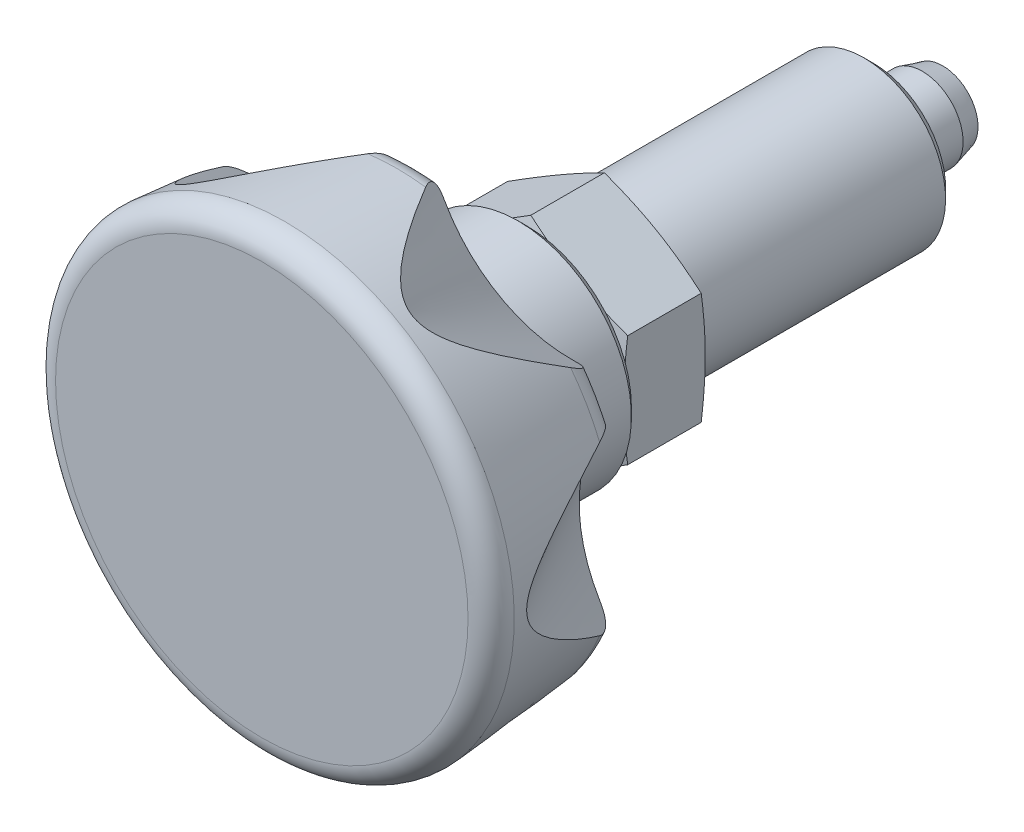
ISO-10303-21;
HEADER;
FILE_DESCRIPTION(('STEP AP214'),'2;1');
FILE_NAME('part.step','',(''),(''),'','','');
FILE_SCHEMA(('AUTOMOTIVE_DESIGN { 1 0 10303 214 1 1 1 1 }'));
ENDSEC;
DATA;
#1=APPLICATION_CONTEXT('core data for automotive mechanical design processes');
#2=APPLICATION_PROTOCOL_DEFINITION('international standard','automotive_design',2000,#1);
#3=PRODUCT_CONTEXT('',#1,'mechanical');
#4=PRODUCT('Part','Part','',(#3));
#5=PRODUCT_RELATED_PRODUCT_CATEGORY('part','',(#4));
#6=PRODUCT_DEFINITION_FORMATION('','',#4);
#7=PRODUCT_DEFINITION_CONTEXT('part definition',#1,'design');
#8=PRODUCT_DEFINITION('design','',#6,#7);
#9=PRODUCT_DEFINITION_SHAPE('','',#8);
#10=(LENGTH_UNIT() NAMED_UNIT(*) SI_UNIT(.MILLI.,.METRE.));
#11=(NAMED_UNIT(*) PLANE_ANGLE_UNIT() SI_UNIT($,.RADIAN.));
#12=(NAMED_UNIT(*) SI_UNIT($,.STERADIAN.) SOLID_ANGLE_UNIT());
#13=UNCERTAINTY_MEASURE_WITH_UNIT(LENGTH_MEASURE(1.E-05),#10,'distance_accuracy_value','');
#14=(GEOMETRIC_REPRESENTATION_CONTEXT(3) GLOBAL_UNCERTAINTY_ASSIGNED_CONTEXT((#13)) GLOBAL_UNIT_ASSIGNED_CONTEXT((#10,
#11,#12)) REPRESENTATION_CONTEXT('',''));
#15=CARTESIAN_POINT('',(0.,0.,0.));
#16=DIRECTION('',(0.,0.,1.));
#17=DIRECTION('',(1.,0.,0.));
#18=AXIS2_PLACEMENT_3D('',#15,#16,#17);
#19=CARTESIAN_POINT('',(0.,0.,0.));
#20=DIRECTION('',(0.,0.,1.));
#21=DIRECTION('',(0.,-1.,0.));
#22=AXIS2_PLACEMENT_3D('',#19,#20,#21);
#23=CONICAL_SURFACE('',#22,9.5,1.30899693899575);
#24=CARTESIAN_POINT('',(9.5,14.6565924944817,2.13451814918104));
#25=CARTESIAN_POINT('',(9.5,14.2238692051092,2.03724694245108));
#26=CARTESIAN_POINT('',(9.5,13.7908792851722,1.94114104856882));
#27=CARTESIAN_POINT('',(9.5,12.9242349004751,1.75188921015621));
#28=CARTESIAN_POINT('',(9.5,12.4905804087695,1.65874338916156));
#29=CARTESIAN_POINT('',(9.5,11.6221094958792,1.4759645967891));
#30=CARTESIAN_POINT('',(9.5,11.1872923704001,1.3863349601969));
#31=CARTESIAN_POINT('',(9.5,10.3167636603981,1.2115323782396));
#32=CARTESIAN_POINT('',(9.5,9.88105208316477,1.1263593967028));
#33=CARTESIAN_POINT('',(9.5,9.01211187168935,0.962202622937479));
#34=CARTESIAN_POINT('',(9.5,8.57889168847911,0.88317431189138));
#35=CARTESIAN_POINT('',(9.5,7.71126713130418,0.731854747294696));
#36=CARTESIAN_POINT('',(9.5,7.27686275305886,0.659563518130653));
#37=CARTESIAN_POINT('',(9.5,6.40678280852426,0.523317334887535));
#38=CARTESIAN_POINT('',(9.5,5.97110737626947,0.459361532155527));
#39=CARTESIAN_POINT('',(9.5,5.09836575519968,0.341642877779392));
#40=CARTESIAN_POINT('',(9.5,4.66129956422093,0.287880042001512));
#41=CARTESIAN_POINT('',(9.5,3.78077561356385,0.192035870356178));
#42=CARTESIAN_POINT('',(9.5,3.33730220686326,0.150096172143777));
#43=CARTESIAN_POINT('',(9.5,2.44920917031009,0.0807726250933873));
#44=CARTESIAN_POINT('',(9.5,2.00458956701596,0.0533884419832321));
#45=CARTESIAN_POINT('',(9.5,1.11485600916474,0.0147710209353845));
#46=CARTESIAN_POINT('',(9.5,0.669742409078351,0.00352978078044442));
#47=CARTESIAN_POINT('',(9.5,-0.220592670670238,-0.00210748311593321));
#48=CARTESIAN_POINT('',(9.5,-0.665814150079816,0.00349645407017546));
#49=CARTESIAN_POINT('',(9.5,-1.55743389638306,0.0312383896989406));
#50=CARTESIAN_POINT('',(9.5,-2.00383015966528,0.0534394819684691));
#51=CARTESIAN_POINT('',(9.5,-2.8955926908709,0.11309832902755));
#52=CARTESIAN_POINT('',(9.5,-3.34095893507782,0.150556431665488));
#53=CARTESIAN_POINT('',(9.5,-4.23065764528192,0.238801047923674));
#54=CARTESIAN_POINT('',(9.5,-4.67498918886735,0.28959671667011));
#55=CARTESIAN_POINT('',(9.5,-5.56221586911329,0.402357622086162));
#56=CARTESIAN_POINT('',(9.5,-6.00511100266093,0.4643228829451));
#57=CARTESIAN_POINT('',(9.5,-6.88706918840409,0.597028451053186));
#58=CARTESIAN_POINT('',(9.5,-7.3261398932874,0.667718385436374));
#59=CARTESIAN_POINT('',(9.5,-8.20304724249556,0.816414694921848));
#60=CARTESIAN_POINT('',(9.5,-8.64088384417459,0.894421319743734));
#61=CARTESIAN_POINT('',(9.5,-9.51551607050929,1.05633270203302));
#62=CARTESIAN_POINT('',(9.5,-9.95231155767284,1.14023819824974));
#63=CARTESIAN_POINT('',(9.5,-10.8249555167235,1.31279289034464));
#64=CARTESIAN_POINT('',(9.5,-11.2608039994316,1.40144203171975));
#65=CARTESIAN_POINT('',(9.5,-12.1318414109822,1.58260627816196));
#66=CARTESIAN_POINT('',(9.5,-12.5670300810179,1.67512262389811));
#67=CARTESIAN_POINT('',(9.5,-13.4367310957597,1.86328611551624));
#68=CARTESIAN_POINT('',(9.5,-13.8712434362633,1.95893328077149));
#69=CARTESIAN_POINT('',(9.5,-15.1738560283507,2.24967915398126));
#70=CARTESIAN_POINT('',(9.5,-16.0411032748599,2.44859730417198));
#71=CARTESIAN_POINT('',(9.5,-17.7646811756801,2.85123948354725));
#72=CARTESIAN_POINT('',(9.5,-18.6210292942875,3.05488925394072));
#73=CARTESIAN_POINT('',(9.5,-20.3325663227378,3.46707758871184));
#74=CARTESIAN_POINT('',(9.5,-21.1877552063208,3.67561626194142));
#75=CARTESIAN_POINT('',(9.5,-22.8960399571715,4.09597368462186));
#76=CARTESIAN_POINT('',(9.5,-23.7491370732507,4.30778736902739));
#77=CARTESIAN_POINT('',(9.5,-25.0282625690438,4.62752053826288));
#78=CARTESIAN_POINT('',(9.5,-25.4545434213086,4.73443177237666));
#79=CARTESIAN_POINT('',(9.5,-26.3069556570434,4.94884672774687));
#80=CARTESIAN_POINT('',(9.5,-26.733087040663,5.0563504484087));
#81=CARTESIAN_POINT('',(9.5,-27.1591535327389,5.16411071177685));
#82=B_SPLINE_CURVE_WITH_KNOTS('',3,(#24,#25,#26,#27,#28,#29,#30,#31,#32,#33,#34,#35,#36,#37,#38,
#39,#40,#41,#42,#43,#44,#45,#46,#47,#48,#49,#50,#51,#52,#53,#54,#55,#56,#57,#58,#59,#60,#61,#62,
#63,#64,#65,#66,#67,#68,#69,#70,#71,#72,#73,#74,#75,#76,#77,#78,#79,#80,#81),.UNSPECIFIED.,.F.,
.F.,(4,2,2,2,2,2,2,2,2,2,2,2,2,2,2,2,2,2,2,2,2,2,2,2,2,2,2,2,4),(0.,1.33056909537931,
2.66119364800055,3.99305108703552,5.32489771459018,6.64596342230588,7.96703391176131,
9.28796979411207,10.6089077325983,11.9450559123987,13.281173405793,14.6166283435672,
15.9520801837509,17.292634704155,18.6332197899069,19.974727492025,21.3162380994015,
22.6503369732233,23.9844813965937,25.3187932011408,26.653089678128,27.9878175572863,
29.3225536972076,31.9918070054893,34.6324811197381,37.2732140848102,39.9102061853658,
41.2286550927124,42.5471026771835),.UNSPECIFIED.);
#83=CARTESIAN_POINT('',(9.5,-5.48482755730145,0.393792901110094));
#84=VERTEX_POINT('',#83);
#85=CARTESIAN_POINT('',(9.5,0.,0.));
#86=VERTEX_POINT('',#85);
#87=EDGE_CURVE('E495',#84,#86,#82,.F.);
#88=ORIENTED_EDGE('',*,*,#87,.F.);
#89=CARTESIAN_POINT('',(-0.0002,-10.9697705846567,0.393823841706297));
#90=CARTESIAN_POINT('',(0.394327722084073,-10.7419898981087,0.332765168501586));
#91=CARTESIAN_POINT('',(0.789570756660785,-10.5137962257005,0.277334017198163));
#92=CARTESIAN_POINT('',(1.58145262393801,-10.0566030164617,0.17994674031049));
#93=CARTESIAN_POINT('',(1.97809195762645,-9.82760319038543,0.13799608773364));
#94=CARTESIAN_POINT('',(2.77036165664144,-9.37018606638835,0.0700188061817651));
#95=CARTESIAN_POINT('',(3.16598666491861,-9.14177186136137,0.0439111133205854));
#96=CARTESIAN_POINT('',(3.95774119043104,-8.68465217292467,0.00890337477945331));
#97=CARTESIAN_POINT('',(4.35387059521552,-8.45594675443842,0.));
#98=CARTESIAN_POINT('',(5.14612940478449,-7.99853591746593,0.));
#99=CARTESIAN_POINT('',(5.54225880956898,-7.76983049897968,0.00890337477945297));
#100=CARTESIAN_POINT('',(6.3340133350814,-7.31271081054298,0.0439111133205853));
#101=CARTESIAN_POINT('',(6.72963834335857,-7.084296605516,0.0700188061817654));
#102=CARTESIAN_POINT('',(7.52190804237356,-6.62687948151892,0.13799608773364));
#103=CARTESIAN_POINT('',(7.918547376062,-6.3978796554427,0.179946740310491));
#104=CARTESIAN_POINT('',(8.71042924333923,-5.94068644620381,0.277334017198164));
#105=CARTESIAN_POINT('',(9.10567227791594,-5.71249277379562,0.332765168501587));
#106=CARTESIAN_POINT('',(9.5002,-5.48471208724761,0.393823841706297));
#107=B_SPLINE_CURVE_WITH_KNOTS('',3,(#89,#90,#91,#92,#93,#94,#95,#96,#97,#98,#99,#100,#101,#102,
#103,#104,#105,#106),.UNSPECIFIED.,.F.,.F.,(4,2,2,2,2,2,2,2,4),(0.,1.37897722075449,
2.75851359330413,4.13093041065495,5.50308163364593,6.87523285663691,8.24764967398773,
9.62718604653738,11.0061632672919),.UNSPECIFIED.);
#108=CARTESIAN_POINT('',(4.75,-8.22724133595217,0.));
#109=VERTEX_POINT('',#108);
#110=EDGE_CURVE('E524',#109,#84,#107,.T.);
#111=ORIENTED_EDGE('',*,*,#110,.F.);
#112=CARTESIAN_POINT('',(0.,0.,0.));
#113=DIRECTION('',(0.,0.,-1.));
#114=DIRECTION('',(0.,1.,0.));
#115=AXIS2_PLACEMENT_3D('',#112,#113,#114);
#116=CIRCLE('',#115,9.5);
#117=EDGE_CURVE('E219',#86,#109,#116,.T.);
#118=ORIENTED_EDGE('',*,*,#117,.F.);
#119=EDGE_LOOP('',(#88,#111,#118));
#120=FACE_BOUND('',#119,.T.);
#121=ADVANCED_FACE('F14',(#120),#23,.T.);
#122=CARTESIAN_POINT('',(9.5,5.48482755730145,0.393792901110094));
#123=VERTEX_POINT('',#122);
#124=EDGE_CURVE('E496',#86,#123,#82,.F.);
#125=ORIENTED_EDGE('',*,*,#124,.F.);
#126=CARTESIAN_POINT('',(4.75,8.22724133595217,0.));
#127=VERTEX_POINT('',#126);
#128=EDGE_CURVE('E211',#127,#86,#116,.T.);
#129=ORIENTED_EDGE('',*,*,#128,.F.);
#130=CARTESIAN_POINT('',(9.5002,5.48471208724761,0.393823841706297));
#131=CARTESIAN_POINT('',(9.10567227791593,5.71249277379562,0.332765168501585));
#132=CARTESIAN_POINT('',(8.71042924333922,5.94068644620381,0.277334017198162));
#133=CARTESIAN_POINT('',(7.918547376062,6.39787965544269,0.179946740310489));
#134=CARTESIAN_POINT('',(7.52190804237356,6.62687948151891,0.137996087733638));
#135=CARTESIAN_POINT('',(6.72963834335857,7.084296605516,0.0700188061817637));
#136=CARTESIAN_POINT('',(6.3340133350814,7.31271081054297,0.043911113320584));
#137=CARTESIAN_POINT('',(5.54225880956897,7.76983049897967,0.0089033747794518));
#138=CARTESIAN_POINT('',(5.14612940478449,7.99853591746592,0.));
#139=CARTESIAN_POINT('',(4.35387059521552,8.45594675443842,0.));
#140=CARTESIAN_POINT('',(3.95774119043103,8.68465217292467,0.00890337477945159));
#141=CARTESIAN_POINT('',(3.16598666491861,9.14177186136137,0.0439111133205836));
#142=CARTESIAN_POINT('',(2.77036165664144,9.37018606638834,0.0700188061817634));
#143=CARTESIAN_POINT('',(1.97809195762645,9.82760319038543,0.137996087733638));
#144=CARTESIAN_POINT('',(1.58145262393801,10.0566030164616,0.179946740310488));
#145=CARTESIAN_POINT('',(0.78957075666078,10.5137962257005,0.277334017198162));
#146=CARTESIAN_POINT('',(0.394327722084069,10.7419898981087,0.332765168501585));
#147=CARTESIAN_POINT('',(-0.000200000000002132,10.9697705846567,0.393823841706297));
#148=B_SPLINE_CURVE_WITH_KNOTS('',3,(#130,#131,#132,#133,#134,#135,#136,#137,#138,#139,#140,
#141,#142,#143,#144,#145,#146,#147),.UNSPECIFIED.,.F.,.F.,(4,2,2,2,2,2,2,2,4),(0.,
1.37897722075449,2.75851359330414,4.13093041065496,5.50308163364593,6.87523285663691,
8.24764967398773,9.62718604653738,11.0061632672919),.UNSPECIFIED.);
#149=EDGE_CURVE('E562',#123,#127,#148,.T.);
#150=ORIENTED_EDGE('',*,*,#149,.F.);
#151=EDGE_LOOP('',(#125,#129,#150));
#152=FACE_BOUND('',#151,.T.);
#153=ADVANCED_FACE('F642',(#152),#23,.T.);
#154=CARTESIAN_POINT('',(0.,10.9696551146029,0.393792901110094));
#155=VERTEX_POINT('',#154);
#156=EDGE_CURVE('E207',#127,#155,#148,.T.);
#157=ORIENTED_EDGE('',*,*,#156,.F.);
#158=CARTESIAN_POINT('',(-4.75,8.22724133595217,0.));
#159=VERTEX_POINT('',#158);
#160=EDGE_CURVE('E205',#159,#127,#116,.T.);
#161=ORIENTED_EDGE('',*,*,#160,.F.);
#162=CARTESIAN_POINT('',(0.0002,10.9697705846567,0.393823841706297));
#163=CARTESIAN_POINT('',(-0.394327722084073,10.7419898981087,0.332765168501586));
#164=CARTESIAN_POINT('',(-0.789570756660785,10.5137962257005,0.277334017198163));
#165=CARTESIAN_POINT('',(-1.58145262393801,10.0566030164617,0.17994674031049));
#166=CARTESIAN_POINT('',(-1.97809195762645,9.82760319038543,0.13799608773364));
#167=CARTESIAN_POINT('',(-2.77036165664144,9.37018606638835,0.0700188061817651));
#168=CARTESIAN_POINT('',(-3.16598666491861,9.14177186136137,0.0439111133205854));
#169=CARTESIAN_POINT('',(-3.95774119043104,8.68465217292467,0.00890337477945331));
#170=CARTESIAN_POINT('',(-4.35387059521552,8.45594675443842,0.));
#171=CARTESIAN_POINT('',(-5.14612940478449,7.99853591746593,0.));
#172=CARTESIAN_POINT('',(-5.54225880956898,7.76983049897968,0.00890337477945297));
#173=CARTESIAN_POINT('',(-6.3340133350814,7.31271081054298,0.0439111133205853));
#174=CARTESIAN_POINT('',(-6.72963834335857,7.084296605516,0.0700188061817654));
#175=CARTESIAN_POINT('',(-7.52190804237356,6.62687948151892,0.13799608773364));
#176=CARTESIAN_POINT('',(-7.918547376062,6.3978796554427,0.179946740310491));
#177=CARTESIAN_POINT('',(-8.71042924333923,5.94068644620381,0.277334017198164));
#178=CARTESIAN_POINT('',(-9.10567227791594,5.71249277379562,0.332765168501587));
#179=CARTESIAN_POINT('',(-9.5002,5.48471208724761,0.393823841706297));
#180=B_SPLINE_CURVE_WITH_KNOTS('',3,(#162,#163,#164,#165,#166,#167,#168,#169,#170,#171,#172,
#173,#174,#175,#176,#177,#178,#179),.UNSPECIFIED.,.F.,.F.,(4,2,2,2,2,2,2,2,4),(0.,
1.37897722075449,2.75851359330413,4.13093041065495,5.50308163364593,6.87523285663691,
8.24764967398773,9.62718604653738,11.0061632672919),.UNSPECIFIED.);
#181=EDGE_CURVE('E186',#155,#159,#180,.T.);
#182=ORIENTED_EDGE('',*,*,#181,.F.);
#183=EDGE_LOOP('',(#157,#161,#182));
#184=FACE_BOUND('',#183,.T.);
#185=ADVANCED_FACE('F206',(#184),#23,.T.);
#186=CARTESIAN_POINT('',(0.,-10.9696551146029,0.393792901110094));
#187=VERTEX_POINT('',#186);
#188=EDGE_CURVE('E529',#187,#109,#107,.T.);
#189=ORIENTED_EDGE('',*,*,#188,.F.);
#190=CARTESIAN_POINT('',(-9.5002,-5.48471208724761,0.393823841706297));
#191=CARTESIAN_POINT('',(-9.10567227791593,-5.71249277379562,0.332765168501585));
#192=CARTESIAN_POINT('',(-8.71042924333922,-5.94068644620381,0.277334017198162));
#193=CARTESIAN_POINT('',(-7.918547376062,-6.39787965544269,0.179946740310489));
#194=CARTESIAN_POINT('',(-7.52190804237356,-6.62687948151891,0.137996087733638));
#195=CARTESIAN_POINT('',(-6.72963834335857,-7.084296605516,0.0700188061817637));
#196=CARTESIAN_POINT('',(-6.3340133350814,-7.31271081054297,0.043911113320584));
#197=CARTESIAN_POINT('',(-5.54225880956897,-7.76983049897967,0.0089033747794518));
#198=CARTESIAN_POINT('',(-5.14612940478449,-7.99853591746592,0.));
#199=CARTESIAN_POINT('',(-4.35387059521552,-8.45594675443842,0.));
#200=CARTESIAN_POINT('',(-3.95774119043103,-8.68465217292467,0.00890337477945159));
#201=CARTESIAN_POINT('',(-3.16598666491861,-9.14177186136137,0.0439111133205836));
#202=CARTESIAN_POINT('',(-2.77036165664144,-9.37018606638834,0.0700188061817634));
#203=CARTESIAN_POINT('',(-1.97809195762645,-9.82760319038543,0.137996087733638));
#204=CARTESIAN_POINT('',(-1.58145262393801,-10.0566030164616,0.179946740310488));
#205=CARTESIAN_POINT('',(-0.78957075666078,-10.5137962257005,0.277334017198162));
#206=CARTESIAN_POINT('',(-0.394327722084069,-10.7419898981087,0.332765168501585));
#207=CARTESIAN_POINT('',(0.000200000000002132,-10.9697705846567,0.393823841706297));
#208=B_SPLINE_CURVE_WITH_KNOTS('',3,(#190,#191,#192,#193,#194,#195,#196,#197,#198,#199,#200,
#201,#202,#203,#204,#205,#206,#207),.UNSPECIFIED.,.F.,.F.,(4,2,2,2,2,2,2,2,4),(0.,
1.37897722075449,2.75851359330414,4.13093041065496,5.50308163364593,6.87523285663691,
8.24764967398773,9.62718604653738,11.0061632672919),.UNSPECIFIED.);
#209=CARTESIAN_POINT('',(-4.75,-8.22724133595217,0.));
#210=VERTEX_POINT('',#209);
#211=EDGE_CURVE('E540',#210,#187,#208,.T.);
#212=ORIENTED_EDGE('',*,*,#211,.F.);
#213=EDGE_CURVE('E218',#109,#210,#116,.T.);
#214=ORIENTED_EDGE('',*,*,#213,.F.);
#215=EDGE_LOOP('',(#189,#212,#214));
#216=FACE_BOUND('',#215,.T.);
#217=ADVANCED_FACE('F657',(#216),#23,.T.);
#218=CARTESIAN_POINT('',(-9.5,5.48482755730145,0.393792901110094));
#219=VERTEX_POINT('',#218);
#220=EDGE_CURVE('E189',#159,#219,#180,.T.);
#221=ORIENTED_EDGE('',*,*,#220,.F.);
#222=CARTESIAN_POINT('',(-9.5,0.,0.));
#223=VERTEX_POINT('',#222);
#224=EDGE_CURVE('E201',#223,#159,#116,.T.);
#225=ORIENTED_EDGE('',*,*,#224,.F.);
#226=CARTESIAN_POINT('',(-9.5,14.6565924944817,2.13451814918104));
#227=CARTESIAN_POINT('',(-9.5,14.2238692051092,2.03724694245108));
#228=CARTESIAN_POINT('',(-9.5,13.7908792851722,1.94114104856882));
#229=CARTESIAN_POINT('',(-9.5,12.9242349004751,1.75188921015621));
#230=CARTESIAN_POINT('',(-9.5,12.4905804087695,1.65874338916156));
#231=CARTESIAN_POINT('',(-9.5,11.6221094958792,1.4759645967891));
#232=CARTESIAN_POINT('',(-9.5,11.1872923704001,1.3863349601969));
#233=CARTESIAN_POINT('',(-9.5,10.3167636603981,1.2115323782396));
#234=CARTESIAN_POINT('',(-9.5,9.88105208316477,1.1263593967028));
#235=CARTESIAN_POINT('',(-9.5,9.01211187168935,0.962202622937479));
#236=CARTESIAN_POINT('',(-9.5,8.57889168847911,0.88317431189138));
#237=CARTESIAN_POINT('',(-9.5,7.71126713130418,0.731854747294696));
#238=CARTESIAN_POINT('',(-9.5,7.27686275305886,0.659563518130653));
#239=CARTESIAN_POINT('',(-9.5,6.40678280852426,0.523317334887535));
#240=CARTESIAN_POINT('',(-9.5,5.97110737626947,0.459361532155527));
#241=CARTESIAN_POINT('',(-9.5,5.09836575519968,0.341642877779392));
#242=CARTESIAN_POINT('',(-9.5,4.66129956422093,0.287880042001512));
#243=CARTESIAN_POINT('',(-9.5,3.78077561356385,0.192035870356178));
#244=CARTESIAN_POINT('',(-9.5,3.33730220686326,0.150096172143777));
#245=CARTESIAN_POINT('',(-9.5,2.44920917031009,0.0807726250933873));
#246=CARTESIAN_POINT('',(-9.5,2.00458956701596,0.0533884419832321));
#247=CARTESIAN_POINT('',(-9.5,1.11485600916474,0.0147710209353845));
#248=CARTESIAN_POINT('',(-9.5,0.669742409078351,0.00352978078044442));
#249=CARTESIAN_POINT('',(-9.5,-0.220592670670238,-0.00210748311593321));
#250=CARTESIAN_POINT('',(-9.5,-0.665814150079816,0.00349645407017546));
#251=CARTESIAN_POINT('',(-9.5,-1.55743389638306,0.0312383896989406));
#252=CARTESIAN_POINT('',(-9.5,-2.00383015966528,0.0534394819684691));
#253=CARTESIAN_POINT('',(-9.5,-2.8955926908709,0.11309832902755));
#254=CARTESIAN_POINT('',(-9.5,-3.34095893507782,0.150556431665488));
#255=CARTESIAN_POINT('',(-9.5,-4.23065764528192,0.238801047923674));
#256=CARTESIAN_POINT('',(-9.5,-4.67498918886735,0.28959671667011));
#257=CARTESIAN_POINT('',(-9.5,-5.56221586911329,0.402357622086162));
#258=CARTESIAN_POINT('',(-9.5,-6.00511100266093,0.4643228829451));
#259=CARTESIAN_POINT('',(-9.5,-6.88706918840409,0.597028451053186));
#260=CARTESIAN_POINT('',(-9.5,-7.3261398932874,0.667718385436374));
#261=CARTESIAN_POINT('',(-9.5,-8.20304724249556,0.816414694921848));
#262=CARTESIAN_POINT('',(-9.5,-8.64088384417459,0.894421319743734));
#263=CARTESIAN_POINT('',(-9.5,-9.51551607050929,1.05633270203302));
#264=CARTESIAN_POINT('',(-9.5,-9.95231155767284,1.14023819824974));
#265=CARTESIAN_POINT('',(-9.5,-10.8249555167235,1.31279289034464));
#266=CARTESIAN_POINT('',(-9.5,-11.2608039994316,1.40144203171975));
#267=CARTESIAN_POINT('',(-9.5,-12.1318414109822,1.58260627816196));
#268=CARTESIAN_POINT('',(-9.5,-12.5670300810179,1.67512262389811));
#269=CARTESIAN_POINT('',(-9.5,-13.4367310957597,1.86328611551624));
#270=CARTESIAN_POINT('',(-9.5,-13.8712434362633,1.95893328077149));
#271=CARTESIAN_POINT('',(-9.5,-15.1738560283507,2.24967915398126));
#272=CARTESIAN_POINT('',(-9.5,-16.0411032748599,2.44859730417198));
#273=CARTESIAN_POINT('',(-9.5,-17.7646811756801,2.85123948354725));
#274=CARTESIAN_POINT('',(-9.5,-18.6210292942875,3.05488925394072));
#275=CARTESIAN_POINT('',(-9.5,-20.3325663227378,3.46707758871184));
#276=CARTESIAN_POINT('',(-9.5,-21.1877552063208,3.67561626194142));
#277=CARTESIAN_POINT('',(-9.5,-22.8960399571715,4.09597368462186));
#278=CARTESIAN_POINT('',(-9.5,-23.7491370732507,4.30778736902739));
#279=CARTESIAN_POINT('',(-9.5,-25.0282625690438,4.62752053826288));
#280=CARTESIAN_POINT('',(-9.5,-25.4545434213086,4.73443177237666));
#281=CARTESIAN_POINT('',(-9.5,-26.3069556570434,4.94884672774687));
#282=CARTESIAN_POINT('',(-9.5,-26.733087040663,5.0563504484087));
#283=CARTESIAN_POINT('',(-9.5,-27.1591535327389,5.16411071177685));
#284=B_SPLINE_CURVE_WITH_KNOTS('',3,(#226,#227,#228,#229,#230,#231,#232,#233,#234,#235,#236,
#237,#238,#239,#240,#241,#242,#243,#244,#245,#246,#247,#248,#249,#250,#251,#252,#253,#254,#255,
#256,#257,#258,#259,#260,#261,#262,#263,#264,#265,#266,#267,#268,#269,#270,#271,#272,#273,#274,
#275,#276,#277,#278,#279,#280,#281,#282,#283),.UNSPECIFIED.,.F.,.F.,(4,2,2,2,2,2,2,2,2,2,2,2,2,
2,2,2,2,2,2,2,2,2,2,2,2,2,2,2,4),(0.,1.33056909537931,2.66119364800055,3.99305108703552,
5.32489771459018,6.64596342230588,7.96703391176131,9.28796979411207,10.6089077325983,
11.9450559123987,13.281173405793,14.6166283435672,15.9520801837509,17.292634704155,
18.6332197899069,19.974727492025,21.3162380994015,22.6503369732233,23.9844813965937,
25.3187932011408,26.653089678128,27.9878175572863,29.3225536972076,31.9918070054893,
34.6324811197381,37.2732140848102,39.9102061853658,41.2286550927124,42.5471026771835),.UNSPECIFIED.);
#285=EDGE_CURVE('E33',#219,#223,#284,.T.);
#286=ORIENTED_EDGE('',*,*,#285,.F.);
#287=EDGE_LOOP('',(#221,#225,#286));
#288=FACE_BOUND('',#287,.T.);
#289=ADVANCED_FACE('F199',(#288),#23,.T.);
#290=CARTESIAN_POINT('',(0.,0.,5.45448267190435));
#291=DIRECTION('',(0.,0.,-1.));
#292=DIRECTION('',(0.,1.,0.));
#293=AXIS2_PLACEMENT_3D('',#290,#291,#292);
#294=CONICAL_SURFACE('',#293,19.,1.30899693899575);
#295=CARTESIAN_POINT('',(-9.5002,5.48471208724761,7.6061761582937));
#296=CARTESIAN_POINT('',(-9.10567227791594,5.71249277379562,7.66723483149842));
#297=CARTESIAN_POINT('',(-8.71042924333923,5.94068644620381,7.72266598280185));
#298=CARTESIAN_POINT('',(-7.918547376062,6.3978796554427,7.82005325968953));
#299=CARTESIAN_POINT('',(-7.52190804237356,6.62687948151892,7.86200391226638));
#300=CARTESIAN_POINT('',(-6.72963834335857,7.084296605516,7.92998119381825));
#301=CARTESIAN_POINT('',(-6.3340133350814,7.31271081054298,7.95608888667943));
#302=CARTESIAN_POINT('',(-5.54225880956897,7.76983049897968,7.99109662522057));
#303=CARTESIAN_POINT('',(-5.14612940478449,7.99853591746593,8.00000000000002));
#304=CARTESIAN_POINT('',(-4.35387059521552,8.45594675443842,8.00000000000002));
#305=CARTESIAN_POINT('',(-3.95774119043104,8.68465217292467,7.99109662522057));
#306=CARTESIAN_POINT('',(-3.16598666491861,9.14177186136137,7.95608888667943));
#307=CARTESIAN_POINT('',(-2.77036165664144,9.37018606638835,7.92998119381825));
#308=CARTESIAN_POINT('',(-1.97809195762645,9.82760319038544,7.86200391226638));
#309=CARTESIAN_POINT('',(-1.58145262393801,10.0566030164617,7.82005325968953));
#310=CARTESIAN_POINT('',(-0.789570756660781,10.5137962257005,7.72266598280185));
#311=CARTESIAN_POINT('',(-0.39432772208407,10.7419898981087,7.66723483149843));
#312=CARTESIAN_POINT('',(0.000200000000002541,10.9697705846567,7.6061761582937));
#313=B_SPLINE_CURVE_WITH_KNOTS('',3,(#295,#296,#297,#298,#299,#300,#301,#302,#303,#304,#305,
#306,#307,#308,#309,#310,#311,#312),.UNSPECIFIED.,.F.,.F.,(4,2,2,2,2,2,2,2,4),(0.,
1.37897722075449,2.75851359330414,4.13093041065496,5.50308163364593,6.87523285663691,
8.24764967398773,9.62718604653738,11.0061632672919),.UNSPECIFIED.);
#314=CARTESIAN_POINT('',(-9.5,5.48482755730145,7.6062070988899));
#315=VERTEX_POINT('',#314);
#316=CARTESIAN_POINT('',(-4.75,8.22724133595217,8.));
#317=VERTEX_POINT('',#316);
#318=EDGE_CURVE('E203',#315,#317,#313,.T.);
#319=ORIENTED_EDGE('',*,*,#318,.F.);
#320=CARTESIAN_POINT('',(-9.5,14.6565924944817,5.86548185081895));
#321=CARTESIAN_POINT('',(-9.5,14.2238692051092,5.96275305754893));
#322=CARTESIAN_POINT('',(-9.5,13.7908792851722,6.0588589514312));
#323=CARTESIAN_POINT('',(-9.5,12.9242349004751,6.24811078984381));
#324=CARTESIAN_POINT('',(-9.5,12.4905804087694,6.34125661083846));
#325=CARTESIAN_POINT('',(-9.5,11.6221094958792,6.52403540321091));
#326=CARTESIAN_POINT('',(-9.5,11.1872923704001,6.61366503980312));
#327=CARTESIAN_POINT('',(-9.5,10.3167636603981,6.78846762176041));
#328=CARTESIAN_POINT('',(-9.5,9.88105208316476,6.87364060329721));
#329=CARTESIAN_POINT('',(-9.5,9.01211187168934,7.03779737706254));
#330=CARTESIAN_POINT('',(-9.5,8.57889168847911,7.11682568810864));
#331=CARTESIAN_POINT('',(-9.5,7.71126713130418,7.26814525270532));
#332=CARTESIAN_POINT('',(-9.5,7.27686275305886,7.34043648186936));
#333=CARTESIAN_POINT('',(-9.5,6.40678280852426,7.47668266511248));
#334=CARTESIAN_POINT('',(-9.5,5.97110737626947,7.5406384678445));
#335=CARTESIAN_POINT('',(-9.5,5.09836575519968,7.65835712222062));
#336=CARTESIAN_POINT('',(-9.5,4.66129956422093,7.71211995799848));
#337=CARTESIAN_POINT('',(-9.5,3.78077561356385,7.80796412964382));
#338=CARTESIAN_POINT('',(-9.5,3.33730220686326,7.84990382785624));
#339=CARTESIAN_POINT('',(-9.5,2.44920917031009,7.91922737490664));
#340=CARTESIAN_POINT('',(-9.5,2.00458956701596,7.94661155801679));
#341=CARTESIAN_POINT('',(-9.5,1.11485600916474,7.98522897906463));
#342=CARTESIAN_POINT('',(-9.5,0.66974240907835,7.99647021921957));
#343=CARTESIAN_POINT('',(-9.5,-0.220592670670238,8.00210748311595));
#344=CARTESIAN_POINT('',(-9.5,-0.665814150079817,7.99650354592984));
#345=CARTESIAN_POINT('',(-9.5,-1.55743389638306,7.96876161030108));
#346=CARTESIAN_POINT('',(-9.5,-2.00383015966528,7.94656051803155));
#347=CARTESIAN_POINT('',(-9.5,-2.89559269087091,7.88690167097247));
#348=CARTESIAN_POINT('',(-9.5,-3.34095893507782,7.84944356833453));
#349=CARTESIAN_POINT('',(-9.5,-4.23065764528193,7.76119895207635));
#350=CARTESIAN_POINT('',(-9.5,-4.67498918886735,7.71040328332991));
#351=CARTESIAN_POINT('',(-9.5,-5.56221586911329,7.59764237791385));
#352=CARTESIAN_POINT('',(-9.5,-6.00511100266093,7.5356771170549));
#353=CARTESIAN_POINT('',(-9.5,-6.8870691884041,7.40297154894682));
#354=CARTESIAN_POINT('',(-9.5,-7.32613989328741,7.33228161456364));
#355=CARTESIAN_POINT('',(-9.5,-8.20304724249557,7.18358530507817));
#356=CARTESIAN_POINT('',(-9.5,-8.6408838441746,7.10557868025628));
#357=CARTESIAN_POINT('',(-9.5,-9.51551607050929,6.94366729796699));
#358=CARTESIAN_POINT('',(-9.5,-9.95231155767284,6.85976180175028));
#359=CARTESIAN_POINT('',(-9.5,-10.8249555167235,6.68720710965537));
#360=CARTESIAN_POINT('',(-9.5,-11.2608039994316,6.59855796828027));
#361=CARTESIAN_POINT('',(-9.5,-12.1318414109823,6.41739372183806));
#362=CARTESIAN_POINT('',(-9.5,-12.5670300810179,6.3248773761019));
#363=CARTESIAN_POINT('',(-9.5,-13.4367310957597,6.13671388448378));
#364=CARTESIAN_POINT('',(-9.5,-13.8712434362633,6.04106671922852));
#365=CARTESIAN_POINT('',(-9.5,-15.1738560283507,5.75032084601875));
#366=CARTESIAN_POINT('',(-9.5,-16.0411032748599,5.55140269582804));
#367=CARTESIAN_POINT('',(-9.5,-17.7646811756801,5.14876051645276));
#368=CARTESIAN_POINT('',(-9.5,-18.6210292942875,4.94511074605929));
#369=CARTESIAN_POINT('',(-9.5,-20.3325663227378,4.53292241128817));
#370=CARTESIAN_POINT('',(-9.5,-21.1877552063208,4.32438373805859));
#371=CARTESIAN_POINT('',(-9.5,-22.8960399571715,3.90402631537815));
#372=CARTESIAN_POINT('',(-9.5,-23.7491370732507,3.69221263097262));
#373=CARTESIAN_POINT('',(-9.5,-25.0282625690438,3.37247946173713));
#374=CARTESIAN_POINT('',(-9.5,-25.4545434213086,3.26556822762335));
#375=CARTESIAN_POINT('',(-9.5,-26.3069556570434,3.05115327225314));
#376=CARTESIAN_POINT('',(-9.5,-26.733087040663,2.9436495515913));
#377=CARTESIAN_POINT('',(-9.5,-27.1591535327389,2.83588928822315));
#378=B_SPLINE_CURVE_WITH_KNOTS('',3,(#320,#321,#322,#323,#324,#325,#326,#327,#328,#329,#330,
#331,#332,#333,#334,#335,#336,#337,#338,#339,#340,#341,#342,#343,#344,#345,#346,#347,#348,#349,
#350,#351,#352,#353,#354,#355,#356,#357,#358,#359,#360,#361,#362,#363,#364,#365,#366,#367,#368,
#369,#370,#371,#372,#373,#374,#375,#376,#377),.UNSPECIFIED.,.F.,.F.,(4,2,2,2,2,2,2,2,2,2,2,2,2,
2,2,2,2,2,2,2,2,2,2,2,2,2,2,2,4),(0.,1.33056909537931,2.66119364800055,3.99305108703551,
5.32489771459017,6.64596342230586,7.96703391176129,9.28796979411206,10.6089077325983,
11.9450559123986,13.281173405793,14.6166283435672,15.9520801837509,17.292634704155,
18.6332197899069,19.9747274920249,21.3162380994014,22.6503369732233,23.9844813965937,
25.3187932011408,26.653089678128,27.9878175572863,29.3225536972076,31.9918070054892,
34.632481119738,37.2732140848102,39.9102061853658,41.2286550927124,42.5471026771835),.UNSPECIFIED.);
#379=CARTESIAN_POINT('',(-9.5,0.,8.));
#380=VERTEX_POINT('',#379);
#381=EDGE_CURVE('E122',#380,#315,#378,.F.);
#382=ORIENTED_EDGE('',*,*,#381,.F.);
#383=CARTESIAN_POINT('',(0.,0.,8.));
#384=DIRECTION('',(0.,0.,-1.));
#385=DIRECTION('',(0.,1.,0.));
#386=AXIS2_PLACEMENT_3D('',#383,#384,#385);
#387=CIRCLE('',#386,9.5);
#388=EDGE_CURVE('E557',#380,#317,#387,.T.);
#389=ORIENTED_EDGE('',*,*,#388,.T.);
#390=EDGE_LOOP('',(#319,#382,#389));
#391=FACE_BOUND('',#390,.T.);
#392=ADVANCED_FACE('F454',(#391),#294,.T.);
#393=CARTESIAN_POINT('',(0.,10.9696551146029,7.6062070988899));
#394=VERTEX_POINT('',#393);
#395=EDGE_CURVE('E561',#317,#394,#313,.T.);
#396=ORIENTED_EDGE('',*,*,#395,.F.);
#397=CARTESIAN_POINT('',(4.75,8.22724133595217,8.));
#398=VERTEX_POINT('',#397);
#399=EDGE_CURVE('E596',#317,#398,#387,.T.);
#400=ORIENTED_EDGE('',*,*,#399,.T.);
#401=CARTESIAN_POINT('',(-0.0002,10.9697705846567,7.6061761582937));
#402=CARTESIAN_POINT('',(0.39432772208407,10.7419898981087,7.66723483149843));
#403=CARTESIAN_POINT('',(0.789570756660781,10.5137962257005,7.72266598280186));
#404=CARTESIAN_POINT('',(1.581452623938,10.0566030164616,7.82005325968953));
#405=CARTESIAN_POINT('',(1.97809195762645,9.82760319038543,7.86200391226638));
#406=CARTESIAN_POINT('',(2.77036165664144,9.37018606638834,7.92998119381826));
#407=CARTESIAN_POINT('',(3.16598666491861,9.14177186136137,7.95608888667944));
#408=CARTESIAN_POINT('',(3.95774119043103,8.68465217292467,7.99109662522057));
#409=CARTESIAN_POINT('',(4.35387059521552,8.45594675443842,8.00000000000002));
#410=CARTESIAN_POINT('',(5.14612940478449,7.99853591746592,8.00000000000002));
#411=CARTESIAN_POINT('',(5.54225880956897,7.76983049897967,7.99109662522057));
#412=CARTESIAN_POINT('',(6.3340133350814,7.31271081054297,7.95608888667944));
#413=CARTESIAN_POINT('',(6.72963834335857,7.084296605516,7.92998119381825));
#414=CARTESIAN_POINT('',(7.52190804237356,6.62687948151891,7.86200391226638));
#415=CARTESIAN_POINT('',(7.918547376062,6.39787965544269,7.82005325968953));
#416=CARTESIAN_POINT('',(8.71042924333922,5.94068644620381,7.72266598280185));
#417=CARTESIAN_POINT('',(9.10567227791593,5.71249277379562,7.66723483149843));
#418=CARTESIAN_POINT('',(9.5002,5.48471208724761,7.6061761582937));
#419=B_SPLINE_CURVE_WITH_KNOTS('',3,(#401,#402,#403,#404,#405,#406,#407,#408,#409,#410,#411,
#412,#413,#414,#415,#416,#417,#418),.UNSPECIFIED.,.F.,.F.,(4,2,2,2,2,2,2,2,4),(0.,
1.37897722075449,2.75851359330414,4.13093041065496,5.50308163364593,6.87523285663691,
8.24764967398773,9.62718604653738,11.0061632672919),.UNSPECIFIED.);
#420=EDGE_CURVE('E494',#394,#398,#419,.T.);
#421=ORIENTED_EDGE('',*,*,#420,.F.);
#422=EDGE_LOOP('',(#396,#400,#421));
#423=FACE_BOUND('',#422,.T.);
#424=ADVANCED_FACE('F663',(#423),#294,.T.);
#425=CARTESIAN_POINT('',(9.5,5.48482755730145,7.6062070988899));
#426=VERTEX_POINT('',#425);
#427=EDGE_CURVE('E487',#398,#426,#419,.T.);
#428=ORIENTED_EDGE('',*,*,#427,.F.);
#429=CARTESIAN_POINT('',(9.5,0.,8.));
#430=VERTEX_POINT('',#429);
#431=EDGE_CURVE('E195',#398,#430,#387,.T.);
#432=ORIENTED_EDGE('',*,*,#431,.T.);
#433=CARTESIAN_POINT('',(9.5,14.6565924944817,5.86548185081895));
#434=CARTESIAN_POINT('',(9.5,14.2238692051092,5.96275305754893));
#435=CARTESIAN_POINT('',(9.5,13.7908792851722,6.0588589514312));
#436=CARTESIAN_POINT('',(9.5,12.9242349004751,6.24811078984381));
#437=CARTESIAN_POINT('',(9.5,12.4905804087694,6.34125661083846));
#438=CARTESIAN_POINT('',(9.5,11.6221094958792,6.52403540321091));
#439=CARTESIAN_POINT('',(9.5,11.1872923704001,6.61366503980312));
#440=CARTESIAN_POINT('',(9.5,10.3167636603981,6.78846762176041));
#441=CARTESIAN_POINT('',(9.5,9.88105208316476,6.87364060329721));
#442=CARTESIAN_POINT('',(9.5,9.01211187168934,7.03779737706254));
#443=CARTESIAN_POINT('',(9.5,8.57889168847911,7.11682568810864));
#444=CARTESIAN_POINT('',(9.5,7.71126713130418,7.26814525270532));
#445=CARTESIAN_POINT('',(9.5,7.27686275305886,7.34043648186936));
#446=CARTESIAN_POINT('',(9.5,6.40678280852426,7.47668266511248));
#447=CARTESIAN_POINT('',(9.5,5.97110737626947,7.5406384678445));
#448=CARTESIAN_POINT('',(9.5,5.09836575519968,7.65835712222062));
#449=CARTESIAN_POINT('',(9.5,4.66129956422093,7.71211995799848));
#450=CARTESIAN_POINT('',(9.5,3.78077561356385,7.80796412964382));
#451=CARTESIAN_POINT('',(9.5,3.33730220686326,7.84990382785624));
#452=CARTESIAN_POINT('',(9.5,2.44920917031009,7.91922737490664));
#453=CARTESIAN_POINT('',(9.5,2.00458956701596,7.94661155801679));
#454=CARTESIAN_POINT('',(9.5,1.11485600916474,7.98522897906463));
#455=CARTESIAN_POINT('',(9.5,0.66974240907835,7.99647021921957));
#456=CARTESIAN_POINT('',(9.5,-0.220592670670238,8.00210748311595));
#457=CARTESIAN_POINT('',(9.5,-0.665814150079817,7.99650354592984));
#458=CARTESIAN_POINT('',(9.5,-1.55743389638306,7.96876161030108));
#459=CARTESIAN_POINT('',(9.5,-2.00383015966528,7.94656051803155));
#460=CARTESIAN_POINT('',(9.5,-2.89559269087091,7.88690167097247));
#461=CARTESIAN_POINT('',(9.5,-3.34095893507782,7.84944356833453));
#462=CARTESIAN_POINT('',(9.5,-4.23065764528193,7.76119895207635));
#463=CARTESIAN_POINT('',(9.5,-4.67498918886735,7.71040328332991));
#464=CARTESIAN_POINT('',(9.5,-5.56221586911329,7.59764237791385));
#465=CARTESIAN_POINT('',(9.5,-6.00511100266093,7.5356771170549));
#466=CARTESIAN_POINT('',(9.5,-6.8870691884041,7.40297154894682));
#467=CARTESIAN_POINT('',(9.5,-7.32613989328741,7.33228161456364));
#468=CARTESIAN_POINT('',(9.5,-8.20304724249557,7.18358530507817));
#469=CARTESIAN_POINT('',(9.5,-8.6408838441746,7.10557868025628));
#470=CARTESIAN_POINT('',(9.5,-9.51551607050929,6.94366729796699));
#471=CARTESIAN_POINT('',(9.5,-9.95231155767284,6.85976180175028));
#472=CARTESIAN_POINT('',(9.5,-10.8249555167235,6.68720710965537));
#473=CARTESIAN_POINT('',(9.5,-11.2608039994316,6.59855796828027));
#474=CARTESIAN_POINT('',(9.5,-12.1318414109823,6.41739372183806));
#475=CARTESIAN_POINT('',(9.5,-12.5670300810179,6.3248773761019));
#476=CARTESIAN_POINT('',(9.5,-13.4367310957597,6.13671388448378));
#477=CARTESIAN_POINT('',(9.5,-13.8712434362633,6.04106671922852));
#478=CARTESIAN_POINT('',(9.5,-15.1738560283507,5.75032084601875));
#479=CARTESIAN_POINT('',(9.5,-16.0411032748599,5.55140269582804));
#480=CARTESIAN_POINT('',(9.5,-17.7646811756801,5.14876051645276));
#481=CARTESIAN_POINT('',(9.5,-18.6210292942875,4.94511074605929));
#482=CARTESIAN_POINT('',(9.5,-20.3325663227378,4.53292241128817));
#483=CARTESIAN_POINT('',(9.5,-21.1877552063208,4.32438373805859));
#484=CARTESIAN_POINT('',(9.5,-22.8960399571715,3.90402631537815));
#485=CARTESIAN_POINT('',(9.5,-23.7491370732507,3.69221263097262));
#486=CARTESIAN_POINT('',(9.5,-25.0282625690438,3.37247946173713));
#487=CARTESIAN_POINT('',(9.5,-25.4545434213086,3.26556822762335));
#488=CARTESIAN_POINT('',(9.5,-26.3069556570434,3.05115327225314));
#489=CARTESIAN_POINT('',(9.5,-26.733087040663,2.9436495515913));
#490=CARTESIAN_POINT('',(9.5,-27.1591535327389,2.83588928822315));
#491=B_SPLINE_CURVE_WITH_KNOTS('',3,(#433,#434,#435,#436,#437,#438,#439,#440,#441,#442,#443,
#444,#445,#446,#447,#448,#449,#450,#451,#452,#453,#454,#455,#456,#457,#458,#459,#460,#461,#462,
#463,#464,#465,#466,#467,#468,#469,#470,#471,#472,#473,#474,#475,#476,#477,#478,#479,#480,#481,
#482,#483,#484,#485,#486,#487,#488,#489,#490),.UNSPECIFIED.,.F.,.F.,(4,2,2,2,2,2,2,2,2,2,2,2,2,
2,2,2,2,2,2,2,2,2,2,2,2,2,2,2,4),(0.,1.33056909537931,2.66119364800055,3.99305108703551,
5.32489771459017,6.64596342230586,7.96703391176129,9.28796979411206,10.6089077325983,
11.9450559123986,13.281173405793,14.6166283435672,15.9520801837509,17.292634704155,
18.6332197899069,19.9747274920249,21.3162380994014,22.6503369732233,23.9844813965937,
25.3187932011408,26.653089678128,27.9878175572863,29.3225536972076,31.9918070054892,
34.632481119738,37.2732140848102,39.9102061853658,41.2286550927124,42.5471026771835),.UNSPECIFIED.);
#492=EDGE_CURVE('E584',#426,#430,#491,.T.);
#493=ORIENTED_EDGE('',*,*,#492,.F.);
#494=EDGE_LOOP('',(#428,#432,#493));
#495=FACE_BOUND('',#494,.T.);
#496=ADVANCED_FACE('F580',(#495),#294,.T.);
#497=CARTESIAN_POINT('',(9.5,-5.48482755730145,7.6062070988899));
#498=VERTEX_POINT('',#497);
#499=EDGE_CURVE('E479',#430,#498,#491,.T.);
#500=ORIENTED_EDGE('',*,*,#499,.F.);
#501=CARTESIAN_POINT('',(4.75,-8.22724133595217,8.));
#502=VERTEX_POINT('',#501);
#503=EDGE_CURVE('E224',#430,#502,#387,.T.);
#504=ORIENTED_EDGE('',*,*,#503,.T.);
#505=CARTESIAN_POINT('',(9.5002,-5.48471208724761,7.6061761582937));
#506=CARTESIAN_POINT('',(9.10567227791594,-5.71249277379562,7.66723483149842));
#507=CARTESIAN_POINT('',(8.71042924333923,-5.94068644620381,7.72266598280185));
#508=CARTESIAN_POINT('',(7.918547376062,-6.3978796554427,7.82005325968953));
#509=CARTESIAN_POINT('',(7.52190804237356,-6.62687948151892,7.86200391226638));
#510=CARTESIAN_POINT('',(6.72963834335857,-7.084296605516,7.92998119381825));
#511=CARTESIAN_POINT('',(6.3340133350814,-7.31271081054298,7.95608888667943));
#512=CARTESIAN_POINT('',(5.54225880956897,-7.76983049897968,7.99109662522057));
#513=CARTESIAN_POINT('',(5.14612940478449,-7.99853591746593,8.00000000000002));
#514=CARTESIAN_POINT('',(4.35387059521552,-8.45594675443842,8.00000000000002));
#515=CARTESIAN_POINT('',(3.95774119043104,-8.68465217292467,7.99109662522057));
#516=CARTESIAN_POINT('',(3.16598666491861,-9.14177186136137,7.95608888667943));
#517=CARTESIAN_POINT('',(2.77036165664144,-9.37018606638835,7.92998119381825));
#518=CARTESIAN_POINT('',(1.97809195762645,-9.82760319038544,7.86200391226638));
#519=CARTESIAN_POINT('',(1.58145262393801,-10.0566030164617,7.82005325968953));
#520=CARTESIAN_POINT('',(0.789570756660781,-10.5137962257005,7.72266598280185));
#521=CARTESIAN_POINT('',(0.39432772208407,-10.7419898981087,7.66723483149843));
#522=CARTESIAN_POINT('',(-0.000200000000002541,-10.9697705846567,7.6061761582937));
#523=B_SPLINE_CURVE_WITH_KNOTS('',3,(#505,#506,#507,#508,#509,#510,#511,#512,#513,#514,#515,
#516,#517,#518,#519,#520,#521,#522),.UNSPECIFIED.,.F.,.F.,(4,2,2,2,2,2,2,2,4),(0.,
1.37897722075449,2.75851359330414,4.13093041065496,5.50308163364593,6.87523285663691,
8.24764967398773,9.62718604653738,11.0061632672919),.UNSPECIFIED.);
#524=EDGE_CURVE('E530',#498,#502,#523,.T.);
#525=ORIENTED_EDGE('',*,*,#524,.F.);
#526=EDGE_LOOP('',(#500,#504,#525));
#527=FACE_BOUND('',#526,.T.);
#528=ADVANCED_FACE('F592',(#527),#294,.T.);
#529=CARTESIAN_POINT('',(0.,-10.9696551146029,7.6062070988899));
#530=VERTEX_POINT('',#529);
#531=EDGE_CURVE('E471',#502,#530,#523,.T.);
#532=ORIENTED_EDGE('',*,*,#531,.F.);
#533=CARTESIAN_POINT('',(-4.75,-8.22724133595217,8.));
#534=VERTEX_POINT('',#533);
#535=EDGE_CURVE('E594',#502,#534,#387,.T.);
#536=ORIENTED_EDGE('',*,*,#535,.T.);
#537=CARTESIAN_POINT('',(0.0002,-10.9697705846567,7.6061761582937));
#538=CARTESIAN_POINT('',(-0.39432772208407,-10.7419898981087,7.66723483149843));
#539=CARTESIAN_POINT('',(-0.789570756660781,-10.5137962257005,7.72266598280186));
#540=CARTESIAN_POINT('',(-1.581452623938,-10.0566030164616,7.82005325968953));
#541=CARTESIAN_POINT('',(-1.97809195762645,-9.82760319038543,7.86200391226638));
#542=CARTESIAN_POINT('',(-2.77036165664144,-9.37018606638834,7.92998119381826));
#543=CARTESIAN_POINT('',(-3.16598666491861,-9.14177186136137,7.95608888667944));
#544=CARTESIAN_POINT('',(-3.95774119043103,-8.68465217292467,7.99109662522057));
#545=CARTESIAN_POINT('',(-4.35387059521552,-8.45594675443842,8.00000000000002));
#546=CARTESIAN_POINT('',(-5.14612940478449,-7.99853591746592,8.00000000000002));
#547=CARTESIAN_POINT('',(-5.54225880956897,-7.76983049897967,7.99109662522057));
#548=CARTESIAN_POINT('',(-6.3340133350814,-7.31271081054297,7.95608888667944));
#549=CARTESIAN_POINT('',(-6.72963834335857,-7.084296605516,7.92998119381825));
#550=CARTESIAN_POINT('',(-7.52190804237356,-6.62687948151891,7.86200391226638));
#551=CARTESIAN_POINT('',(-7.918547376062,-6.39787965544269,7.82005325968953));
#552=CARTESIAN_POINT('',(-8.71042924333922,-5.94068644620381,7.72266598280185));
#553=CARTESIAN_POINT('',(-9.10567227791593,-5.71249277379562,7.66723483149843));
#554=CARTESIAN_POINT('',(-9.5002,-5.48471208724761,7.6061761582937));
#555=B_SPLINE_CURVE_WITH_KNOTS('',3,(#537,#538,#539,#540,#541,#542,#543,#544,#545,#546,#547,
#548,#549,#550,#551,#552,#553,#554),.UNSPECIFIED.,.F.,.F.,(4,2,2,2,2,2,2,2,4),(0.,
1.37897722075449,2.75851359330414,4.13093041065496,5.50308163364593,6.87523285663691,
8.24764967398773,9.62718604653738,11.0061632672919),.UNSPECIFIED.);
#556=EDGE_CURVE('E544',#530,#534,#555,.T.);
#557=ORIENTED_EDGE('',*,*,#556,.F.);
#558=EDGE_LOOP('',(#532,#536,#557));
#559=FACE_BOUND('',#558,.T.);
#560=ADVANCED_FACE('F455',(#559),#294,.T.);
#561=CARTESIAN_POINT('',(4.,0.,-26.));
#562=DIRECTION('',(0.,0.,-1.));
#563=DIRECTION('',(0.,1.,0.));
#564=AXIS2_PLACEMENT_3D('',#561,#562,#563);
#565=PLANE('',#564);
#566=CARTESIAN_POINT('',(0.,0.,-26.));
#567=DIRECTION('',(0.,0.,-1.));
#568=DIRECTION('',(0.,1.,0.));
#569=AXIS2_PLACEMENT_3D('',#566,#567,#568);
#570=CIRCLE('',#569,7.08);
#571=CARTESIAN_POINT('',(0.,7.08,-26.));
#572=VERTEX_POINT('',#571);
#573=EDGE_CURVE('E24',#572,#572,#570,.T.);
#574=ORIENTED_EDGE('',*,*,#573,.T.);
#575=EDGE_LOOP('',(#574));
#576=FACE_BOUND('',#575,.T.);
#577=CARTESIAN_POINT('',(0.,0.,-26.));
#578=DIRECTION('',(0.,0.,-1.));
#579=DIRECTION('',(0.,1.,0.));
#580=AXIS2_PLACEMENT_3D('',#577,#578,#579);
#581=CIRCLE('',#580,4.);
#582=CARTESIAN_POINT('',(0.,4.,-26.));
#583=VERTEX_POINT('',#582);
#584=EDGE_CURVE('E9',#583,#583,#581,.T.);
#585=ORIENTED_EDGE('',*,*,#584,.F.);
#586=EDGE_LOOP('',(#585));
#587=FACE_BOUND('',#586,.T.);
#588=ADVANCED_FACE('F261',(#576,#587),#565,.T.);
#589=CARTESIAN_POINT('',(0.,0.,-26.));
#590=DIRECTION('',(0.,0.,1.));
#591=DIRECTION('',(0.,-1.,0.));
#592=AXIS2_PLACEMENT_3D('',#589,#590,#591);
#593=CONICAL_SURFACE('',#592,7.08,0.785398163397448);
#594=CARTESIAN_POINT('',(0.,0.,-25.08));
#595=DIRECTION('',(0.,0.,-1.));
#596=DIRECTION('',(0.,1.,0.));
#597=AXIS2_PLACEMENT_3D('',#594,#595,#596);
#598=CIRCLE('',#597,8.);
#599=CARTESIAN_POINT('',(0.,8.,-25.08));
#600=VERTEX_POINT('',#599);
#601=EDGE_CURVE('E227',#600,#600,#598,.T.);
#602=ORIENTED_EDGE('',*,*,#601,.T.);
#603=EDGE_LOOP('',(#602));
#604=FACE_BOUND('',#603,.T.);
#605=ORIENTED_EDGE('',*,*,#573,.F.);
#606=EDGE_LOOP('',(#605));
#607=FACE_BOUND('',#606,.T.);
#608=ADVANCED_FACE('F682',(#604,#607),#593,.T.);
#609=CARTESIAN_POINT('',(0.,0.,-26.));
#610=DIRECTION('',(0.,0.,-1.));
#611=DIRECTION('',(0.,1.,0.));
#612=AXIS2_PLACEMENT_3D('',#609,#610,#611);
#613=CYLINDRICAL_SURFACE('',#612,8.);
#614=CARTESIAN_POINT('',(0.,0.,0.));
#615=DIRECTION('',(0.,0.,-1.));
#616=DIRECTION('',(0.,1.,0.));
#617=AXIS2_PLACEMENT_3D('',#614,#615,#616);
#618=CIRCLE('',#617,8.);
#619=CARTESIAN_POINT('',(0.,8.,0.));
#620=VERTEX_POINT('',#619);
#621=EDGE_CURVE('E223',#620,#620,#618,.T.);
#622=ORIENTED_EDGE('',*,*,#621,.T.);
#623=EDGE_LOOP('',(#622));
#624=FACE_BOUND('',#623,.T.);
#625=ORIENTED_EDGE('',*,*,#601,.F.);
#626=EDGE_LOOP('',(#625));
#627=FACE_BOUND('',#626,.T.);
#628=ADVANCED_FACE('F655',(#624,#627),#613,.T.);
#629=CARTESIAN_POINT('',(8.,0.,0.));
#630=DIRECTION('',(0.,0.,-1.));
#631=DIRECTION('',(0.,1.,0.));
#632=AXIS2_PLACEMENT_3D('',#629,#630,#631);
#633=PLANE('',#632);
#634=ORIENTED_EDGE('',*,*,#128,.T.);
#635=ORIENTED_EDGE('',*,*,#117,.T.);
#636=ORIENTED_EDGE('',*,*,#213,.T.);
#637=EDGE_CURVE('E217',#210,#223,#116,.T.);
#638=ORIENTED_EDGE('',*,*,#637,.T.);
#639=ORIENTED_EDGE('',*,*,#224,.T.);
#640=ORIENTED_EDGE('',*,*,#160,.T.);
#641=EDGE_LOOP('',(#634,#635,#636,#638,#639,#640));
#642=FACE_BOUND('',#641,.T.);
#643=ORIENTED_EDGE('',*,*,#621,.F.);
#644=EDGE_LOOP('',(#643));
#645=FACE_BOUND('',#644,.T.);
#646=ADVANCED_FACE('F213',(#642,#645),#633,.T.);
#647=CARTESIAN_POINT('',(-9.5,-5.48482755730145,0.393792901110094));
#648=VERTEX_POINT('',#647);
#649=EDGE_CURVE('E537',#648,#210,#208,.T.);
#650=ORIENTED_EDGE('',*,*,#649,.F.);
#651=EDGE_CURVE('E439',#223,#648,#284,.T.);
#652=ORIENTED_EDGE('',*,*,#651,.F.);
#653=ORIENTED_EDGE('',*,*,#637,.F.);
#654=EDGE_LOOP('',(#650,#652,#653));
#655=FACE_BOUND('',#654,.T.);
#656=ADVANCED_FACE('F452',(#655),#23,.T.);
#657=CARTESIAN_POINT('',(-9.5,-5.48482755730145,7.6062070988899));
#658=VERTEX_POINT('',#657);
#659=EDGE_CURVE('E463',#534,#658,#555,.T.);
#660=ORIENTED_EDGE('',*,*,#659,.F.);
#661=EDGE_CURVE('E595',#534,#380,#387,.T.);
#662=ORIENTED_EDGE('',*,*,#661,.T.);
#663=EDGE_CURVE('E438',#658,#380,#378,.F.);
#664=ORIENTED_EDGE('',*,*,#663,.F.);
#665=EDGE_LOOP('',(#660,#662,#664));
#666=FACE_BOUND('',#665,.T.);
#667=ADVANCED_FACE('F449',(#666),#294,.T.);
#668=CARTESIAN_POINT('',(0.,10.9696551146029,13.));
#669=DIRECTION('',(0.5,-0.866025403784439,0.));
#670=DIRECTION('',(0.866025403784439,0.5,0.));
#671=AXIS2_PLACEMENT_3D('',#668,#669,#670);
#672=PLANE('',#671);
#673=ORIENTED_EDGE('',*,*,#181,.T.);
#674=ORIENTED_EDGE('',*,*,#220,.T.);
#675=DIRECTION('',(0.,0.,-1.));
#676=VECTOR('',#675,1.);
#677=CARTESIAN_POINT('',(-9.5,5.48482755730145,13.));
#678=LINE('',#677,#676);
#679=EDGE_CURVE('E422',#315,#219,#678,.T.);
#680=ORIENTED_EDGE('',*,*,#679,.F.);
#681=ORIENTED_EDGE('',*,*,#318,.T.);
#682=ORIENTED_EDGE('',*,*,#395,.T.);
#683=DIRECTION('',(0.,0.,-1.));
#684=VECTOR('',#683,1.);
#685=CARTESIAN_POINT('',(0.,10.9696551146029,13.));
#686=LINE('',#685,#684);
#687=EDGE_CURVE('E191',#394,#155,#686,.T.);
#688=ORIENTED_EDGE('',*,*,#687,.T.);
#689=EDGE_LOOP('',(#673,#674,#680,#681,#682,#688));
#690=FACE_BOUND('',#689,.T.);
#691=ADVANCED_FACE('F188',(#690),#672,.F.);
#692=CARTESIAN_POINT('',(9.5,5.48482755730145,13.));
#693=DIRECTION('',(-0.5,-0.866025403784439,0.));
#694=DIRECTION('',(0.866025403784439,-0.5,0.));
#695=AXIS2_PLACEMENT_3D('',#692,#693,#694);
#696=PLANE('',#695);
#697=ORIENTED_EDGE('',*,*,#149,.T.);
#698=ORIENTED_EDGE('',*,*,#156,.T.);
#699=ORIENTED_EDGE('',*,*,#687,.F.);
#700=ORIENTED_EDGE('',*,*,#420,.T.);
#701=ORIENTED_EDGE('',*,*,#427,.T.);
#702=DIRECTION('',(0.,0.,-1.));
#703=VECTOR('',#702,1.);
#704=CARTESIAN_POINT('',(9.5,5.48482755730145,13.));
#705=LINE('',#704,#703);
#706=EDGE_CURVE('E590',#426,#123,#705,.T.);
#707=ORIENTED_EDGE('',*,*,#706,.T.);
#708=EDGE_LOOP('',(#697,#698,#699,#700,#701,#707));
#709=FACE_BOUND('',#708,.T.);
#710=ADVANCED_FACE('F505',(#709),#696,.F.);
#711=CARTESIAN_POINT('',(9.5,-5.48482755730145,13.));
#712=DIRECTION('',(-1.,0.,0.));
#713=DIRECTION('',(0.,-1.,0.));
#714=AXIS2_PLACEMENT_3D('',#711,#712,#713);
#715=PLANE('',#714);
#716=ORIENTED_EDGE('',*,*,#87,.T.);
#717=ORIENTED_EDGE('',*,*,#124,.T.);
#718=ORIENTED_EDGE('',*,*,#706,.F.);
#719=ORIENTED_EDGE('',*,*,#492,.T.);
#720=ORIENTED_EDGE('',*,*,#499,.T.);
#721=DIRECTION('',(0.,0.,-1.));
#722=VECTOR('',#721,1.);
#723=CARTESIAN_POINT('',(9.5,-5.48482755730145,13.));
#724=LINE('',#723,#722);
#725=EDGE_CURVE('E586',#498,#84,#724,.T.);
#726=ORIENTED_EDGE('',*,*,#725,.T.);
#727=EDGE_LOOP('',(#716,#717,#718,#719,#720,#726));
#728=FACE_BOUND('',#727,.T.);
#729=ADVANCED_FACE('F509',(#728),#715,.F.);
#730=CARTESIAN_POINT('',(0.,-10.9696551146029,13.));
#731=DIRECTION('',(-0.5,0.866025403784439,0.));
#732=DIRECTION('',(-0.866025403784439,-0.5,0.));
#733=AXIS2_PLACEMENT_3D('',#730,#731,#732);
#734=PLANE('',#733);
#735=ORIENTED_EDGE('',*,*,#188,.T.);
#736=ORIENTED_EDGE('',*,*,#110,.T.);
#737=ORIENTED_EDGE('',*,*,#725,.F.);
#738=ORIENTED_EDGE('',*,*,#524,.T.);
#739=ORIENTED_EDGE('',*,*,#531,.T.);
#740=DIRECTION('',(0.,0.,-1.));
#741=VECTOR('',#740,1.);
#742=CARTESIAN_POINT('',(0.,-10.9696551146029,13.));
#743=LINE('',#742,#741);
#744=EDGE_CURVE('E427',#530,#187,#743,.T.);
#745=ORIENTED_EDGE('',*,*,#744,.T.);
#746=EDGE_LOOP('',(#735,#736,#737,#738,#739,#745));
#747=FACE_BOUND('',#746,.T.);
#748=ADVANCED_FACE('F515',(#747),#734,.F.);
#749=CARTESIAN_POINT('',(-9.5,-5.48482755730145,13.));
#750=DIRECTION('',(0.5,0.866025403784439,0.));
#751=DIRECTION('',(-0.866025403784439,0.5,0.));
#752=AXIS2_PLACEMENT_3D('',#749,#750,#751);
#753=PLANE('',#752);
#754=ORIENTED_EDGE('',*,*,#649,.T.);
#755=ORIENTED_EDGE('',*,*,#211,.T.);
#756=ORIENTED_EDGE('',*,*,#744,.F.);
#757=ORIENTED_EDGE('',*,*,#556,.T.);
#758=ORIENTED_EDGE('',*,*,#659,.T.);
#759=DIRECTION('',(0.,0.,-1.));
#760=VECTOR('',#759,1.);
#761=CARTESIAN_POINT('',(-9.5,-5.48482755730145,13.));
#762=LINE('',#761,#760);
#763=EDGE_CURVE('E424',#658,#648,#762,.T.);
#764=ORIENTED_EDGE('',*,*,#763,.T.);
#765=EDGE_LOOP('',(#754,#755,#756,#757,#758,#764));
#766=FACE_BOUND('',#765,.T.);
#767=ADVANCED_FACE('F520',(#766),#753,.F.);
#768=CARTESIAN_POINT('',(-9.5,5.48482755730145,13.));
#769=DIRECTION('',(1.,0.,0.));
#770=DIRECTION('',(0.,1.,0.));
#771=AXIS2_PLACEMENT_3D('',#768,#769,#770);
#772=PLANE('',#771);
#773=ORIENTED_EDGE('',*,*,#285,.T.);
#774=ORIENTED_EDGE('',*,*,#651,.T.);
#775=ORIENTED_EDGE('',*,*,#763,.F.);
#776=ORIENTED_EDGE('',*,*,#663,.T.);
#777=ORIENTED_EDGE('',*,*,#381,.T.);
#778=ORIENTED_EDGE('',*,*,#679,.T.);
#779=EDGE_LOOP('',(#773,#774,#775,#776,#777,#778));
#780=FACE_BOUND('',#779,.T.);
#781=ADVANCED_FACE('F446',(#780),#772,.F.);
#782=CARTESIAN_POINT('',(0.,0.,34.));
#783=DIRECTION('',(0.,0.,-1.));
#784=DIRECTION('',(0.,1.,0.));
#785=AXIS2_PLACEMENT_3D('',#782,#783,#784);
#786=PLANE('',#785);
#787=CARTESIAN_POINT('',(0.,0.,34.));
#788=DIRECTION('',(0.,0.,-1.));
#789=DIRECTION('',(0.,1.,0.));
#790=AXIS2_PLACEMENT_3D('',#787,#788,#789);
#791=CIRCLE('',#790,20.2333333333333);
#792=CARTESIAN_POINT('',(0.,20.2333333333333,34.));
#793=VERTEX_POINT('',#792);
#794=EDGE_CURVE('E410',#793,#793,#791,.T.);
#795=ORIENTED_EDGE('',*,*,#794,.F.);
#796=EDGE_LOOP('',(#795));
#797=FACE_BOUND('',#796,.T.);
#798=ADVANCED_FACE('F16',(#797),#786,.F.);
#799=CARTESIAN_POINT('',(0.,0.,31.7333333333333));
#800=DIRECTION('',(0.,0.,-1.));
#801=DIRECTION('',(0.,1.,0.));
#802=AXIS2_PLACEMENT_3D('',#799,#800,#801);
#803=TOROIDAL_SURFACE('',#802,20.2333333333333,2.26666666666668);
#804=ORIENTED_EDGE('',*,*,#794,.T.);
#805=EDGE_LOOP('',(#804));
#806=FACE_BOUND('',#805,.T.);
#807=CARTESIAN_POINT('',(0.,0.,31.7333333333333));
#808=DIRECTION('',(0.,0.,-1.));
#809=DIRECTION('',(0.,1.,0.));
#810=AXIS2_PLACEMENT_3D('',#807,#808,#809);
#811=CIRCLE('',#810,22.5);
#812=CARTESIAN_POINT('',(0.,22.5,31.7333333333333));
#813=VERTEX_POINT('',#812);
#814=EDGE_CURVE('E404',#813,#813,#811,.T.);
#815=ORIENTED_EDGE('',*,*,#814,.F.);
#816=EDGE_LOOP('',(#815));
#817=FACE_BOUND('',#816,.T.);
#818=ADVANCED_FACE('F283',(#806,#817),#803,.T.);
#819=CARTESIAN_POINT('',(0.,0.,31.7333333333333));
#820=DIRECTION('',(0.,0.,1.));
#821=DIRECTION('',(0.,-1.,0.));
#822=AXIS2_PLACEMENT_3D('',#819,#820,#821);
#823=CONICAL_SURFACE('',#822,22.5,0.0872664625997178);
#824=CARTESIAN_POINT('',(0.,0.,20.769113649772));
#825=DIRECTION('',(0.,0.,-1.));
#826=DIRECTION('',(0.,1.,0.));
#827=AXIS2_PLACEMENT_3D('',#824,#825,#826);
#828=CIRCLE('',#827,21.5407550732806);
#829=CARTESIAN_POINT('',(19.9130172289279,-8.21436996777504,20.769113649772));
#830=VERTEX_POINT('',#829);
#831=CARTESIAN_POINT('',(17.0703616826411,-13.1379938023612,20.769113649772));
#832=VERTEX_POINT('',#831);
#833=EDGE_CURVE('E399',#830,#832,#828,.T.);
#834=ORIENTED_EDGE('',*,*,#833,.F.);
#835=CARTESIAN_POINT('',(19.9129560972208,8.21447227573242,20.7689136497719));
#836=CARTESIAN_POINT('',(19.9700155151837,8.11897790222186,20.9555894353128));
#837=CARTESIAN_POINT('',(20.0264726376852,8.02268568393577,21.1420402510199));
#838=CARTESIAN_POINT('',(20.1381713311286,7.82840462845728,21.5144252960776));
#839=CARTESIAN_POINT('',(20.1934128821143,7.73041576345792,21.7003595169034));
#840=CARTESIAN_POINT('',(20.3573726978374,7.43361681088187,22.2575423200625));
#841=CARTESIAN_POINT('',(20.4642448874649,7.23210998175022,22.6279051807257));
#842=CARTESIAN_POINT('',(20.6759491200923,6.81489265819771,23.3761416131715));
#843=CARTESIAN_POINT('',(20.7806326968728,6.59893990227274,23.7539224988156));
#844=CARTESIAN_POINT('',(20.9843740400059,6.156704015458,24.5046681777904));
#845=CARTESIAN_POINT('',(21.0834346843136,5.93042627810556,24.8776353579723));
#846=CARTESIAN_POINT('',(21.2757096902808,5.46479164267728,25.6172089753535));
#847=CARTESIAN_POINT('',(21.3689211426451,5.22542834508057,25.9838121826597));
#848=CARTESIAN_POINT('',(21.5039382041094,4.8534601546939,26.5265152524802));
#849=CARTESIAN_POINT('',(21.5481790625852,4.72720522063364,26.7063642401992));
#850=CARTESIAN_POINT('',(21.6349125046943,4.46970046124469,27.0628763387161));
#851=CARTESIAN_POINT('',(21.6774052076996,4.33845097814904,27.2395396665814));
#852=CARTESIAN_POINT('',(21.7599757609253,4.07168627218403,27.5866449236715));
#853=CARTESIAN_POINT('',(21.8000768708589,3.93624329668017,27.7571366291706));
#854=CARTESIAN_POINT('',(21.8782132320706,3.65837851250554,28.0929579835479));
#855=CARTESIAN_POINT('',(21.916247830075,3.51595452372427,28.258285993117));
#856=CARTESIAN_POINT('',(21.9897988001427,3.22308082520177,28.5814113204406));
#857=CARTESIAN_POINT('',(22.0253221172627,3.07265544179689,28.739228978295));
#858=CARTESIAN_POINT('',(22.0934483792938,2.76153652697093,29.0449933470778));
#859=CARTESIAN_POINT('',(22.1260538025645,2.60085191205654,29.1929484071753));
#860=CARTESIAN_POINT('',(22.1712394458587,2.35532078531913,29.3999295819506));
#861=CARTESIAN_POINT('',(22.1852727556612,2.27542551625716,29.4645209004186));
#862=CARTESIAN_POINT('',(22.2123971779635,2.11251479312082,29.5899047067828));
#863=CARTESIAN_POINT('',(22.2254881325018,2.02949881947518,29.6506965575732));
#864=CARTESIAN_POINT('',(22.2505782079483,1.86007820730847,29.7676797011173));
#865=CARTESIAN_POINT('',(22.2625771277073,1.77367294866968,29.8238701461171));
#866=CARTESIAN_POINT('',(22.2852887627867,1.59730504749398,29.9306165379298));
#867=CARTESIAN_POINT('',(22.2960016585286,1.50734290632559,29.981173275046));
#868=CARTESIAN_POINT('',(22.3229550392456,1.25889462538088,30.1087823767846));
#869=CARTESIAN_POINT('',(22.3377678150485,1.09681300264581,30.1793858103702));
#870=CARTESIAN_POINT('',(22.3616476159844,0.762904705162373,30.2935837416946));
#871=CARTESIAN_POINT('',(22.3707258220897,0.591097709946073,30.3372307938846));
#872=CARTESIAN_POINT('',(22.3791836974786,0.328455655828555,30.3779363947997));
#873=CARTESIAN_POINT('',(22.3811388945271,0.239530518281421,30.3873575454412));
#874=CARTESIAN_POINT('',(22.3832087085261,0.0611428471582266,30.3973316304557));
#875=CARTESIAN_POINT('',(22.3833234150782,-0.0283196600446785,30.3978849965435));
#876=CARTESIAN_POINT('',(22.3817020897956,-0.206845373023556,30.3900711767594));
#877=CARTESIAN_POINT('',(22.3799657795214,-0.295908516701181,30.3817026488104));
#878=CARTESIAN_POINT('',(22.3747189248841,-0.472786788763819,30.3564468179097));
#879=CARTESIAN_POINT('',(22.3712073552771,-0.560601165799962,30.3395545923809));
#880=CARTESIAN_POINT('',(22.3574805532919,-0.835368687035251,30.2736411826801));
#881=CARTESIAN_POINT('',(22.3442195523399,-1.01877700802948,30.2101065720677));
#882=CARTESIAN_POINT('',(22.3117254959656,-1.37284675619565,30.0554925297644));
#883=CARTESIAN_POINT('',(22.2924784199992,-1.54347707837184,29.9643484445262));
#884=CARTESIAN_POINT('',(22.2513856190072,-1.85846638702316,29.7713326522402));
#885=CARTESIAN_POINT('',(22.2298901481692,-2.00382970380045,29.6709880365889));
#886=CARTESIAN_POINT('',(22.184037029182,-2.28538958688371,29.4586537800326));
#887=CARTESIAN_POINT('',(22.1596766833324,-2.42157732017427,29.346653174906));
#888=CARTESIAN_POINT('',(22.1086131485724,-2.6864601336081,29.1138669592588));
#889=CARTESIAN_POINT('',(22.0819027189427,-2.81512986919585,28.9930544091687));
#890=CARTESIAN_POINT('',(22.026615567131,-3.06570509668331,28.7451787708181));
#891=CARTESIAN_POINT('',(21.998039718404,-3.18761370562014,28.6181186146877));
#892=CARTESIAN_POINT('',(21.9407336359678,-3.41989789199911,28.3655845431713));
#893=CARTESIAN_POINT('',(21.9120806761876,-3.53054571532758,28.240342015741));
#894=CARTESIAN_POINT('',(21.8534854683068,-3.7474679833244,27.9864094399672));
#895=CARTESIAN_POINT('',(21.8235430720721,-3.85374192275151,27.8577189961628));
#896=CARTESIAN_POINT('',(21.7319383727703,-4.16703186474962,27.4673944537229));
#897=CARTESIAN_POINT('',(21.6685277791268,-4.36840001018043,27.201636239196));
#898=CARTESIAN_POINT('',(21.5375616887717,-4.75998424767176,26.6622291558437));
#899=CARTESIAN_POINT('',(21.469997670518,-4.95017573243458,26.3885647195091));
#900=CARTESIAN_POINT('',(21.331201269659,-5.32135086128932,25.8359465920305));
#901=CARTESIAN_POINT('',(21.2599684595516,-5.50233342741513,25.5569922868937));
#902=CARTESIAN_POINT('',(21.1139240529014,-5.85711241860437,24.9946110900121));
#903=CARTESIAN_POINT('',(21.0391050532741,-6.03089246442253,24.7111758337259));
#904=CARTESIAN_POINT('',(20.8861856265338,-6.37205989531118,24.1413407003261));
#905=CARTESIAN_POINT('',(20.8080849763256,-6.53944684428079,23.8549406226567));
#906=CARTESIAN_POINT('',(20.64881556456,-6.86849324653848,23.2802037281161));
#907=CARTESIAN_POINT('',(20.5676505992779,-7.03015933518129,22.9918696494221));
#908=CARTESIAN_POINT('',(20.4022459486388,-7.34862594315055,22.4134044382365));
#909=CARTESIAN_POINT('',(20.3180062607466,-7.50542645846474,22.1232733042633));
#910=CARTESIAN_POINT('',(20.180081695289,-7.75412454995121,21.6554349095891));
#911=CARTESIAN_POINT('',(20.1273448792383,-7.84740064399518,21.4781784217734));
#912=CARTESIAN_POINT('',(20.0209035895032,-8.03217967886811,21.1236526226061));
#913=CARTESIAN_POINT('',(19.967201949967,-8.12368655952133,20.9463845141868));
#914=CARTESIAN_POINT('',(19.9129560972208,-8.21447227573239,20.768913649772));
#915=B_SPLINE_CURVE_WITH_KNOTS('',3,(#835,#836,#837,#838,#839,#840,#841,#842,#843,#844,#845,
#846,#847,#848,#849,#850,#851,#852,#853,#854,#855,#856,#857,#858,#859,#860,#861,#862,#863,#864,
#865,#866,#867,#868,#869,#870,#871,#872,#873,#874,#875,#876,#877,#878,#879,#880,#881,#882,#883,
#884,#885,#886,#887,#888,#889,#890,#891,#892,#893,#894,#895,#896,#897,#898,#899,#900,#901,#902,
#903,#904,#905,#906,#907,#908,#909,#910,#911,#912,#913,#914),.UNSPECIFIED.,.F.,.F.,(4,2,2,2,2,2,
2,2,2,2,2,2,2,2,2,2,2,2,2,2,2,2,2,2,2,2,2,2,2,2,2,2,2,2,2,2,2,2,2,4),(0.,0.651919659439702,
1.30385001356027,2.60863848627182,3.95117427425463,5.2930166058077,6.63552114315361,
7.30790562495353,7.98024411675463,8.64431984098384,9.30860428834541,9.97097327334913,
10.6327742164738,10.9437567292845,11.2547912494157,11.5658829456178,11.8769309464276,
12.4072704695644,12.9365727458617,13.2045012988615,13.4724168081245,13.7403726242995,
14.0084833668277,14.5885807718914,15.1700472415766,15.703054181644,16.2365671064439,
16.7717855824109,17.3067552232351,17.8153131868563,18.3239297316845,19.3416899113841,
20.3616128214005,21.381654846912,22.4039018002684,23.4262183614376,24.4473074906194,
25.4683974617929,26.0897692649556,26.709544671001),.UNSPECIFIED.);
#916=CARTESIAN_POINT('',(19.9130172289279,8.21436996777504,20.769113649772));
#917=VERTEX_POINT('',#916);
#918=EDGE_CURVE('E289',#917,#830,#915,.T.);
#919=ORIENTED_EDGE('',*,*,#918,.F.);
#920=CARTESIAN_POINT('',(17.0703616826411,13.1379938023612,20.769113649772));
#921=VERTEX_POINT('',#920);
#922=EDGE_CURVE('E405',#921,#917,#828,.T.);
#923=ORIENTED_EDGE('',*,*,#922,.F.);
#924=CARTESIAN_POINT('',(2.8425363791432,21.3523619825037,20.768913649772));
#925=CARTESIAN_POINT('',(2.95376664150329,21.3540297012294,20.9555894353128));
#926=CARTESIAN_POINT('',(3.06538670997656,21.3547768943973,21.14204025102));
#927=CARTESIAN_POINT('',(3.28948838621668,21.3543702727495,21.5144252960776));
#928=CARTESIAN_POINT('',(3.40197000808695,21.3532164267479,21.7003595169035));
#929=CARTESIAN_POINT('',(3.74098534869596,21.3468103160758,22.2575423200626));
#930=CARTESIAN_POINT('',(3.96893147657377,21.3386109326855,22.6279051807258));
#931=CARTESIAN_POINT('',(4.43610439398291,21.3133435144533,23.3761416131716));
#932=CARTESIAN_POINT('',(4.67546675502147,21.2960257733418,23.7539224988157));
#933=CARTESIAN_POINT('',(5.16032493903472,21.2513530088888,24.5046681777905));
#934=CARTESIAN_POINT('',(5.40581753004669,21.2240031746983,24.8776353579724));
#935=CARTESIAN_POINT('',(5.90520645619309,21.1577008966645,25.6172089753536));
#936=CARTESIAN_POINT('',(6.15910687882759,21.1187427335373,25.9838121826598));
#937=CARTESIAN_POINT('',(6.54874931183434,21.0496868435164,26.5265152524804));
#938=CARTESIAN_POINT('',(6.68020972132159,21.0248730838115,26.7063642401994));
#939=CARTESIAN_POINT('',(6.94658210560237,20.9712340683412,27.0628763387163));
#940=CARTESIAN_POINT('',(7.08149384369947,20.9424090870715,27.2395396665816));
#941=CARTESIAN_POINT('',(7.35380413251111,20.8805349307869,27.5866449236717));
#942=CARTESIAN_POINT('',(7.49115174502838,20.8475420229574,27.7571366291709));
#943=CARTESIAN_POINT('',(7.77085788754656,20.7762777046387,28.0929579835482));
#944=CARTESIAN_POINT('',(7.91321797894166,20.7380046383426,28.2582859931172));
#945=CARTESIAN_POINT('',(8.20362952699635,20.655264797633,28.5814113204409));
#946=CARTESIAN_POINT('',(8.35166338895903,20.6108162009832,28.7392289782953));
#947=CARTESIAN_POINT('',(8.65516340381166,20.5142558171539,29.0449933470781));
#948=CARTESIAN_POINT('',(8.81062307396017,20.4621506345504,29.1929484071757));
#949=CARTESIAN_POINT('',(9.0458520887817,20.3785169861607,29.3999295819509));
#950=CARTESIAN_POINT('',(9.12206007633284,20.3507225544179,29.4645209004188));
#951=CARTESIAN_POINT('',(9.27670711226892,20.2927576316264,29.589904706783));
#952=CARTESIAN_POINT('',(9.35514653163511,20.2625867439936,29.6506965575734));
#953=CARTESIAN_POINT('',(9.51441412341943,20.1996050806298,29.7676797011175));
#954=CARTESIAN_POINT('',(9.59524273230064,20.1667938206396,29.8238701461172));
#955=CARTESIAN_POINT('',(9.75933763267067,20.0982787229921,29.93061653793));
#956=CARTESIAN_POINT('',(9.84260358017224,20.0625752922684,29.9811732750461));
#957=CARTESIAN_POINT('',(10.0712427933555,19.9616934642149,30.1087823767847));
#958=CARTESIAN_POINT('',(10.2190159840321,19.8934808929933,30.1793858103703));
#959=CARTESIAN_POINT('',(10.5201289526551,19.7472072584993,30.2935837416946));
#960=CARTESIAN_POINT('',(10.6734572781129,19.6691657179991,30.3372307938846));
#961=CARTESIAN_POINT('',(10.9051409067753,19.5451694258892,30.3779363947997));
#962=CARTESIAN_POINT('',(10.9831299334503,19.5024001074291,30.3873575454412));
#963=CARTESIAN_POINT('',(11.1386530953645,19.4149987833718,30.3973316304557));
#964=CARTESIAN_POINT('',(11.2161872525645,19.3703668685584,30.3978849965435));
#965=CARTESIAN_POINT('',(11.3699843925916,19.2796999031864,30.3900711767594));
#966=CARTESIAN_POINT('',(11.4462471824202,19.2336646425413,30.3817026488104));
#967=CARTESIAN_POINT('',(11.5968048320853,19.1406815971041,30.3564468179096));
#968=CARTESIAN_POINT('',(11.6710985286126,19.0937333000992,30.3395545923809));
#969=CARTESIAN_POINT('',(11.9021907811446,18.9444617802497,30.2736411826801));
#970=CARTESIAN_POINT('',(12.0543965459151,18.8412732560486,30.2101065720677));
#971=CARTESIAN_POINT('',(12.3447829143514,18.6360977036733,30.0554925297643));
#972=CARTESIAN_POINT('',(12.4829295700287,18.5341140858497,29.9643484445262));
#973=CARTESIAN_POINT('',(12.7351719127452,18.3410320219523,29.7713326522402));
#974=CARTESIAN_POINT('',(12.8503125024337,18.2497347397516,29.6709880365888));
#975=CARTESIAN_POINT('',(13.0712239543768,18.0692448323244,29.4586537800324));
#976=CARTESIAN_POINT('',(13.1769858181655,17.9800542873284,29.3466531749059));
#977=CARTESIAN_POINT('',(13.3808492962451,17.8033905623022,29.1138669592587));
#978=CARTESIAN_POINT('',(13.4789253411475,17.715923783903,28.9930544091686));
#979=CARTESIAN_POINT('',(13.6682862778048,17.5427560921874,28.7451787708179));
#980=CARTESIAN_POINT('',(13.7595743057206,17.4570543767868,28.6181186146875));
#981=CARTESIAN_POINT('',(13.9320852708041,17.2912837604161,28.365584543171));
#982=CARTESIAN_POINT('',(14.01358261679,17.2111456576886,28.2403420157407));
#983=CARTESIAN_POINT('',(14.1721452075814,17.0519395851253,27.9864094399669));
#984=CARTESIAN_POINT('',(14.2492099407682,16.9728717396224,27.8577189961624));
#985=CARTESIAN_POINT('',(14.4747246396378,16.7368947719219,27.4673944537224));
#986=CARTESIAN_POINT('',(14.6174092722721,16.5812955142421,27.2016362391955));
#987=CARTESIAN_POINT('',(14.8910481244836,16.2720834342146,26.6622291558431));
#988=CARTESIAN_POINT('',(15.0219767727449,16.1184755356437,26.3885647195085));
#989=CARTESIAN_POINT('',(15.2740256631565,15.8126867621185,25.8359465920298));
#990=CARTESIAN_POINT('',(15.3951447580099,15.6605060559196,25.556992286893));
#991=CARTESIAN_POINT('',(15.6293701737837,15.3566383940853,24.9946110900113));
#992=CARTESIAN_POINT('',(15.7424586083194,15.2049532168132,24.7111758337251));
#993=CARTESIAN_POINT('',(15.9614585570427,14.9019373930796,24.1413407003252));
#994=CARTESIAN_POINT('',(16.0673695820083,14.7506067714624,23.8549406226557));
#995=CARTESIAN_POINT('',(16.2726974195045,14.4481522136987,23.2802037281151));
#996=CARTESIAN_POINT('',(16.3721218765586,14.2970282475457,22.9918696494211));
#997=CARTESIAN_POINT('',(16.5652197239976,13.9945503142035,22.4134044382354));
#998=CARTESIAN_POINT('',(16.65889310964,13.8431963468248,22.1232733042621));
#999=CARTESIAN_POINT('',(16.8053096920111,13.5994011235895,21.6554349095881));
#1000=CARTESIAN_POINT('',(16.8597207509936,13.507091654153,21.4781784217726));
#1001=CARTESIAN_POINT('',(16.9665234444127,13.3225212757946,21.1236526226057));
#1002=CARTESIAN_POINT('',(17.0189199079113,13.2302608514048,20.9463845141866));
#1003=CARTESIAN_POINT('',(17.0704197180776,13.1378897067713,20.768913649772));
#1004=B_SPLINE_CURVE_WITH_KNOTS('',3,(#924,#925,#926,#927,#928,#929,#930,#931,#932,#933,#934,
#935,#936,#937,#938,#939,#940,#941,#942,#943,#944,#945,#946,#947,#948,#949,#950,#951,#952,#953,
#954,#955,#956,#957,#958,#959,#960,#961,#962,#963,#964,#965,#966,#967,#968,#969,#970,#971,#972,
#973,#974,#975,#976,#977,#978,#979,#980,#981,#982,#983,#984,#985,#986,#987,#988,#989,#990,#991,
#992,#993,#994,#995,#996,#997,#998,#999,#1000,#1001,#1002,#1003),.UNSPECIFIED.,.F.,.F.,(4,2,2,2,
2,2,2,2,2,2,2,2,2,2,2,2,2,2,2,2,2,2,2,2,2,2,2,2,2,2,2,2,2,2,2,2,2,2,2,4),(0.,0.651919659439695,
1.30385001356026,2.6086384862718,3.95117427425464,5.29301660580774,6.63552114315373,
7.30790562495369,7.98024411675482,8.64431984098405,9.30860428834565,9.9709732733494,
10.6327742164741,10.9437567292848,11.2547912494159,11.565882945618,11.8769309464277,
12.4072704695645,12.9365727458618,13.2045012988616,13.4724168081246,13.7403726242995,
14.0084833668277,14.5885807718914,15.1700472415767,15.7030541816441,16.236567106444,
16.7717855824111,17.3067552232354,17.8153131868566,18.3239297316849,19.3416899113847,
20.3616128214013,21.3816548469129,22.4039018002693,23.4262183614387,24.4473074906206,
25.4683974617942,26.0897692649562,26.709544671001),.UNSPECIFIED.);
#1005=CARTESIAN_POINT('',(2.8426555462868,21.3523637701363,20.769113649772));
#1006=VERTEX_POINT('',#1005);
#1007=EDGE_CURVE('E951',#1006,#921,#1004,.T.);
#1008=ORIENTED_EDGE('',*,*,#1007,.F.);
#1009=CARTESIAN_POINT('',(-2.84265554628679,21.3523637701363,20.769113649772));
#1010=VERTEX_POINT('',#1009);
#1011=EDGE_CURVE('E400',#1010,#1006,#828,.T.);
#1012=ORIENTED_EDGE('',*,*,#1011,.F.);
#1013=CARTESIAN_POINT('',(-17.0704197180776,13.1378897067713,20.768913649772));
#1014=CARTESIAN_POINT('',(-17.0162488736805,13.2350517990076,20.9555894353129));
#1015=CARTESIAN_POINT('',(-16.9610859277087,13.3320912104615,21.14204025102));
#1016=CARTESIAN_POINT('',(-16.848682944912,13.5259656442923,21.5144252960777));
#1017=CARTESIAN_POINT('',(-16.7914428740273,13.62280066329,21.7003595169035));
#1018=CARTESIAN_POINT('',(-16.6163873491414,13.913193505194,22.2575423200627));
#1019=CARTESIAN_POINT('',(-16.4953134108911,14.1065009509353,22.6279051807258));
#1020=CARTESIAN_POINT('',(-16.2398447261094,14.4984508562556,23.3761416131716));
#1021=CARTESIAN_POINT('',(-16.1051659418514,14.6970858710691,23.7539224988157));
#1022=CARTESIAN_POINT('',(-15.8240491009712,15.0946489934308,24.5046681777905));
#1023=CARTESIAN_POINT('',(-15.677617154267,15.2935768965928,24.8776353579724));
#1024=CARTESIAN_POINT('',(-15.3705032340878,15.6929092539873,25.6172089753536));
#1025=CARTESIAN_POINT('',(-15.2098142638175,15.8933143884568,25.9838121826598));
#1026=CARTESIAN_POINT('',(-14.9551888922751,16.1962266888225,26.5265152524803));
#1027=CARTESIAN_POINT('',(-14.8679693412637,16.297667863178,26.7063642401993));
#1028=CARTESIAN_POINT('',(-14.688330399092,16.5015336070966,27.0628763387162));
#1029=CARTESIAN_POINT('',(-14.5959113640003,16.6039581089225,27.2395396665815));
#1030=CARTESIAN_POINT('',(-14.4061716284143,16.808848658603,27.5866449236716));
#1031=CARTESIAN_POINT('',(-14.3089251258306,16.9112987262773,27.7571366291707));
#1032=CARTESIAN_POINT('',(-14.1073553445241,17.1178991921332,28.0929579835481));
#1033=CARTESIAN_POINT('',(-14.0030298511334,17.2220501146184,28.2582859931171));
#1034=CARTESIAN_POINT('',(-13.7861692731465,17.4321839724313,28.5814113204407));
#1035=CARTESIAN_POINT('',(-13.6736587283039,17.5381607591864,28.7392289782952));
#1036=CARTESIAN_POINT('',(-13.4382849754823,17.7527192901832,29.0449933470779));
#1037=CARTESIAN_POINT('',(-13.3154307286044,17.861298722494,29.1929484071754));
#1038=CARTESIAN_POINT('',(-13.1253873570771,18.0231962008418,29.3999295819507));
#1039=CARTESIAN_POINT('',(-13.0632126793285,18.0752970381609,29.4645209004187));
#1040=CARTESIAN_POINT('',(-12.9356900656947,18.1802428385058,29.5899047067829));
#1041=CARTESIAN_POINT('',(-12.8703416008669,18.2330879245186,29.6506965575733));
#1042=CARTESIAN_POINT('',(-12.736164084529,18.3395268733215,29.7676797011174));
#1043=CARTESIAN_POINT('',(-12.6673343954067,18.3931208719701,29.8238701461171));
#1044=CARTESIAN_POINT('',(-12.5259511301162,18.5009736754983,29.9306165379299));
#1045=CARTESIAN_POINT('',(-12.4533980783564,18.555232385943,29.9811732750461));
#1046=CARTESIAN_POINT('',(-12.2517122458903,18.7027988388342,30.1087823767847));
#1047=CARTESIAN_POINT('',(-12.1187518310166,18.7966678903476,30.1793858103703));
#1048=CARTESIAN_POINT('',(-11.8415186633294,18.984302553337,30.2935837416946));
#1049=CARTESIAN_POINT('',(-11.6972685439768,19.0780680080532,30.3372307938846));
#1050=CARTESIAN_POINT('',(-11.4740427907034,19.2167137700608,30.3779363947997));
#1051=CARTESIAN_POINT('',(-11.3980089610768,19.2628695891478,30.3873575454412));
#1052=CARTESIAN_POINT('',(-11.2445556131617,19.3538559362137,30.3973316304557));
#1053=CARTESIAN_POINT('',(-11.1671361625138,19.3986865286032,30.3978849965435));
#1054=CARTESIAN_POINT('',(-11.011717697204,19.48654527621,30.3900711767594));
#1055=CARTESIAN_POINT('',(-10.9337185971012,19.5295731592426,30.3817026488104));
#1056=CARTESIAN_POINT('',(-10.7779140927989,19.6134683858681,30.3564468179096));
#1057=CARTESIAN_POINT('',(-10.7001088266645,19.6543344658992,30.3395545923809));
#1058=CARTESIAN_POINT('',(-10.4552897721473,19.779830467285,30.2736411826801));
#1059=CARTESIAN_POINT('',(-10.2898230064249,19.8600502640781,30.2101065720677));
#1060=CARTESIAN_POINT('',(-9.96694258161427,20.008944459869,30.0554925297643));
#1061=CARTESIAN_POINT('',(-9.80954884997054,20.0775911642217,29.9643484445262));
#1062=CARTESIAN_POINT('',(-9.51621370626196,20.1994984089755,29.7713326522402));
#1063=CARTESIAN_POINT('',(-9.37957764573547,20.2535644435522,29.6709880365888));
#1064=CARTESIAN_POINT('',(-9.11281307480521,20.3546344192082,29.4586537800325));
#1065=CARTESIAN_POINT('',(-8.98269086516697,20.4016316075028,29.3466531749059));
#1066=CARTESIAN_POINT('',(-8.72776385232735,20.4898506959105,29.1138669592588));
#1067=CARTESIAN_POINT('',(-8.60297737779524,20.531053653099,28.9930544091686));
#1068=CARTESIAN_POINT('',(-8.35832928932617,20.6084611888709,28.745178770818));
#1069=CARTESIAN_POINT('',(-8.2384654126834,20.644668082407,28.6181186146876));
#1070=CARTESIAN_POINT('',(-8.00864836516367,20.7111816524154,28.3655845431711));
#1071=CARTESIAN_POINT('',(-7.89849805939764,20.7416913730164,28.2403420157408));
#1072=CARTESIAN_POINT('',(-7.68134026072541,20.79940756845,27.986409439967));
#1073=CARTESIAN_POINT('',(-7.57433313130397,20.8266136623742,27.8577189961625));
#1074=CARTESIAN_POINT('',(-7.25721373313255,20.9039266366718,27.4673944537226));
#1075=CARTESIAN_POINT('',(-7.05111850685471,20.9496955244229,27.2016362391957));
#1076=CARTESIAN_POINT('',(-6.64651356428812,21.0320676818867,26.6622291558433));
#1077=CARTESIAN_POINT('',(-6.44802089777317,21.0686512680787,26.3885647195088));
#1078=CARTESIAN_POINT('',(-6.05717560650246,21.1340376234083,25.8359465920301));
#1079=CARTESIAN_POINT('',(-5.8648237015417,21.1628394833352,25.5569922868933));
#1080=CARTESIAN_POINT('',(-5.48455387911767,21.2137508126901,24.9946110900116));
#1081=CARTESIAN_POINT('',(-5.29664644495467,21.2358456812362,24.7111758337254));
#1082=CARTESIAN_POINT('',(-4.92472706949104,21.2739972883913,24.1413407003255));
#1083=CARTESIAN_POINT('',(-4.74071539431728,21.2900536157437,23.8549406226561));
#1084=CARTESIAN_POINT('',(-4.37611814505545,21.3166454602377,23.2802037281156));
#1085=CARTESIAN_POINT('',(-4.19552872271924,21.3271875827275,22.9918696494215));
#1086=CARTESIAN_POINT('',(-3.83702622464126,21.3431762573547,22.4134044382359));
#1087=CARTESIAN_POINT('',(-3.65911315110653,21.3486228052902,22.1232733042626));
#1088=CARTESIAN_POINT('',(-3.37477200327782,21.3535256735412,21.6554349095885));
#1089=CARTESIAN_POINT('',(-3.26762412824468,21.3544922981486,21.4781784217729));
#1090=CARTESIAN_POINT('',(-3.05438014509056,21.3547009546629,21.1236526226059));
#1091=CARTESIAN_POINT('',(-2.94828204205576,21.3539474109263,20.9463845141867));
#1092=CARTESIAN_POINT('',(-2.84253637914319,21.3523619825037,20.768913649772));
#1093=B_SPLINE_CURVE_WITH_KNOTS('',3,(#1013,#1014,#1015,#1016,#1017,#1018,#1019,#1020,#1021,
#1022,#1023,#1024,#1025,#1026,#1027,#1028,#1029,#1030,#1031,#1032,#1033,#1034,#1035,#1036,#1037,
#1038,#1039,#1040,#1041,#1042,#1043,#1044,#1045,#1046,#1047,#1048,#1049,#1050,#1051,#1052,#1053,
#1054,#1055,#1056,#1057,#1058,#1059,#1060,#1061,#1062,#1063,#1064,#1065,#1066,#1067,#1068,#1069,
#1070,#1071,#1072,#1073,#1074,#1075,#1076,#1077,#1078,#1079,#1080,#1081,#1082,#1083,#1084,#1085,
#1086,#1087,#1088,#1089,#1090,#1091,#1092),.UNSPECIFIED.,.F.,.F.,(4,2,2,2,2,2,2,2,2,2,2,2,2,2,2,
2,2,2,2,2,2,2,2,2,2,2,2,2,2,2,2,2,2,2,2,2,2,2,2,4),(0.,0.651919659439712,1.30385001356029,
2.60863848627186,3.95117427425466,5.29301660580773,6.63552114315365,7.30790562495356,
7.98024411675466,8.64431984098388,9.30860428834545,9.97097327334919,10.6327742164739,
10.9437567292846,11.2547912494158,11.5658829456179,11.8769309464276,12.4072704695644,
12.9365727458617,13.2045012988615,13.4724168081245,13.7403726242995,14.0084833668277,
14.5885807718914,15.1700472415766,15.703054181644,16.2365671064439,16.771785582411,
17.3067552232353,17.8153131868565,18.3239297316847,19.3416899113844,20.3616128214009,
21.3816548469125,22.4039018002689,23.4262183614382,24.4473074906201,25.4683974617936,
26.0897692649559,26.709544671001),.UNSPECIFIED.);
#1094=CARTESIAN_POINT('',(-17.0703616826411,13.1379938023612,20.769113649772));
#1095=VERTEX_POINT('',#1094);
#1096=EDGE_CURVE('E317',#1095,#1010,#1093,.T.);
#1097=ORIENTED_EDGE('',*,*,#1096,.F.);
#1098=CARTESIAN_POINT('',(-19.9130172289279,8.21436996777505,20.769113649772));
#1099=VERTEX_POINT('',#1098);
#1100=EDGE_CURVE('E397',#1099,#1095,#828,.T.);
#1101=ORIENTED_EDGE('',*,*,#1100,.F.);
#1102=CARTESIAN_POINT('',(-19.9129560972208,-8.21447227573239,20.768913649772));
#1103=CARTESIAN_POINT('',(-19.9700155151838,-8.11897790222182,20.9555894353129));
#1104=CARTESIAN_POINT('',(-20.0264726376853,-8.02268568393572,21.14204025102));
#1105=CARTESIAN_POINT('',(-20.1381713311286,-7.82840462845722,21.5144252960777));
#1106=CARTESIAN_POINT('',(-20.1934128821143,-7.73041576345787,21.7003595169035));
#1107=CARTESIAN_POINT('',(-20.3573726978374,-7.43361681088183,22.2575423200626));
#1108=CARTESIAN_POINT('',(-20.4642448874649,-7.23210998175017,22.6279051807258));
#1109=CARTESIAN_POINT('',(-20.6759491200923,-6.81489265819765,23.3761416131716));
#1110=CARTESIAN_POINT('',(-20.7806326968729,-6.59893990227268,23.7539224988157));
#1111=CARTESIAN_POINT('',(-20.9843740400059,-6.15670401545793,24.5046681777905));
#1112=CARTESIAN_POINT('',(-21.0834346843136,-5.93042627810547,24.8776353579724));
#1113=CARTESIAN_POINT('',(-21.2757096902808,-5.46479164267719,25.6172089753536));
#1114=CARTESIAN_POINT('',(-21.3689211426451,-5.22542834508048,25.9838121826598));
#1115=CARTESIAN_POINT('',(-21.5039382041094,-4.8534601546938,26.5265152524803));
#1116=CARTESIAN_POINT('',(-21.5481790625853,-4.72720522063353,26.7063642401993));
#1117=CARTESIAN_POINT('',(-21.6349125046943,-4.46970046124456,27.0628763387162));
#1118=CARTESIAN_POINT('',(-21.6774052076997,-4.33845097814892,27.2395396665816));
#1119=CARTESIAN_POINT('',(-21.7599757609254,-4.07168627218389,27.5866449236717));
#1120=CARTESIAN_POINT('',(-21.8000768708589,-3.93624329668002,27.7571366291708));
#1121=CARTESIAN_POINT('',(-21.8782132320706,-3.65837851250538,28.0929579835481));
#1122=CARTESIAN_POINT('',(-21.916247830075,-3.5159545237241,28.2582859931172));
#1123=CARTESIAN_POINT('',(-21.9897988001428,-3.22308082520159,28.5814113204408));
#1124=CARTESIAN_POINT('',(-22.0253221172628,-3.07265544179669,28.7392289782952));
#1125=CARTESIAN_POINT('',(-22.0934483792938,-2.76153652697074,29.044993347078));
#1126=CARTESIAN_POINT('',(-22.1260538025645,-2.60085191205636,29.1929484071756));
#1127=CARTESIAN_POINT('',(-22.1712394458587,-2.35532078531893,29.3999295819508));
#1128=CARTESIAN_POINT('',(-22.1852727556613,-2.27542551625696,29.4645209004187));
#1129=CARTESIAN_POINT('',(-22.2123971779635,-2.11251479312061,29.589904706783));
#1130=CARTESIAN_POINT('',(-22.2254881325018,-2.02949881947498,29.6506965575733));
#1131=CARTESIAN_POINT('',(-22.2505782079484,-1.86007820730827,29.7676797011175));
#1132=CARTESIAN_POINT('',(-22.2625771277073,-1.77367294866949,29.8238701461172));
#1133=CARTESIAN_POINT('',(-22.2852887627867,-1.5973050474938,29.9306165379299));
#1134=CARTESIAN_POINT('',(-22.2960016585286,-1.50734290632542,29.9811732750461));
#1135=CARTESIAN_POINT('',(-22.3229550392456,-1.25889462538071,30.1087823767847));
#1136=CARTESIAN_POINT('',(-22.3377678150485,-1.09681300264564,30.1793858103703));
#1137=CARTESIAN_POINT('',(-22.3616476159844,-0.762904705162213,30.2935837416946));
#1138=CARTESIAN_POINT('',(-22.3707258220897,-0.591097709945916,30.3372307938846));
#1139=CARTESIAN_POINT('',(-22.3791836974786,-0.328455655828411,30.3779363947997));
#1140=CARTESIAN_POINT('',(-22.3811388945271,-0.239530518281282,30.3873575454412));
#1141=CARTESIAN_POINT('',(-22.3832087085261,-0.0611428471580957,30.3973316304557));
#1142=CARTESIAN_POINT('',(-22.3833234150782,0.0283196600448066,30.3978849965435));
#1143=CARTESIAN_POINT('',(-22.3817020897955,0.206845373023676,30.3900711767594));
#1144=CARTESIAN_POINT('',(-22.3799657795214,0.295908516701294,30.3817026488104));
#1145=CARTESIAN_POINT('',(-22.3747189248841,0.472786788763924,30.3564468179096));
#1146=CARTESIAN_POINT('',(-22.3712073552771,0.560601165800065,30.3395545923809));
#1147=CARTESIAN_POINT('',(-22.3574805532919,0.835368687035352,30.2736411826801));
#1148=CARTESIAN_POINT('',(-22.3442195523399,1.01877700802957,30.2101065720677));
#1149=CARTESIAN_POINT('',(-22.3117254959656,1.37284675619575,30.0554925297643));
#1150=CARTESIAN_POINT('',(-22.2924784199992,1.54347707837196,29.9643484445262));
#1151=CARTESIAN_POINT('',(-22.2513856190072,1.8584663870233,29.7713326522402));
#1152=CARTESIAN_POINT('',(-22.2298901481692,2.00382970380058,29.6709880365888));
#1153=CARTESIAN_POINT('',(-22.184037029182,2.28538958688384,29.4586537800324));
#1154=CARTESIAN_POINT('',(-22.1596766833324,2.42157732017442,29.3466531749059));
#1155=CARTESIAN_POINT('',(-22.1086131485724,2.68646013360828,29.1138669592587));
#1156=CARTESIAN_POINT('',(-22.0819027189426,2.81512986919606,28.9930544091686));
#1157=CARTESIAN_POINT('',(-22.0266155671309,3.06570509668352,28.7451787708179));
#1158=CARTESIAN_POINT('',(-21.998039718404,3.18761370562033,28.6181186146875));
#1159=CARTESIAN_POINT('',(-21.9407336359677,3.41989789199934,28.365584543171));
#1160=CARTESIAN_POINT('',(-21.9120806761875,3.53054571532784,28.2403420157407));
#1161=CARTESIAN_POINT('',(-21.8534854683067,3.7474679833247,27.9864094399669));
#1162=CARTESIAN_POINT('',(-21.823543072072,3.85374192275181,27.8577189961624));
#1163=CARTESIAN_POINT('',(-21.7319383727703,4.16703186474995,27.4673944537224));
#1164=CARTESIAN_POINT('',(-21.6685277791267,4.36840001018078,27.2016362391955));
#1165=CARTESIAN_POINT('',(-21.5375616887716,4.75998424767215,26.6622291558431));
#1166=CARTESIAN_POINT('',(-21.4699976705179,4.95017573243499,26.3885647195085));
#1167=CARTESIAN_POINT('',(-21.3312012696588,5.32135086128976,25.8359465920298));
#1168=CARTESIAN_POINT('',(-21.2599684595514,5.50233342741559,25.556992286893));
#1169=CARTESIAN_POINT('',(-21.1139240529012,5.85711241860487,24.9946110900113));
#1170=CARTESIAN_POINT('',(-21.0391050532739,6.03089246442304,24.7111758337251));
#1171=CARTESIAN_POINT('',(-20.8861856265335,6.37205989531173,24.1413407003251));
#1172=CARTESIAN_POINT('',(-20.8080849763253,6.53944684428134,23.8549406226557));
#1173=CARTESIAN_POINT('',(-20.6488155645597,6.86849324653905,23.2802037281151));
#1174=CARTESIAN_POINT('',(-20.5676505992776,7.03015933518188,22.9918696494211));
#1175=CARTESIAN_POINT('',(-20.4022459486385,7.34862594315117,22.4134044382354));
#1176=CARTESIAN_POINT('',(-20.3180062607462,7.50542645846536,22.1232733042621));
#1177=CARTESIAN_POINT('',(-20.1800816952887,7.75412454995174,21.6554349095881));
#1178=CARTESIAN_POINT('',(-20.127344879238,7.84740064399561,21.4781784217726));
#1179=CARTESIAN_POINT('',(-20.0209035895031,8.03217967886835,21.1236526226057));
#1180=CARTESIAN_POINT('',(-19.9672019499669,8.12368655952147,20.9463845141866));
#1181=CARTESIAN_POINT('',(-19.9129560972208,8.21447227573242,20.7689136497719));
#1182=B_SPLINE_CURVE_WITH_KNOTS('',3,(#1102,#1103,#1104,#1105,#1106,#1107,#1108,#1109,#1110,
#1111,#1112,#1113,#1114,#1115,#1116,#1117,#1118,#1119,#1120,#1121,#1122,#1123,#1124,#1125,#1126,
#1127,#1128,#1129,#1130,#1131,#1132,#1133,#1134,#1135,#1136,#1137,#1138,#1139,#1140,#1141,#1142,
#1143,#1144,#1145,#1146,#1147,#1148,#1149,#1150,#1151,#1152,#1153,#1154,#1155,#1156,#1157,#1158,
#1159,#1160,#1161,#1162,#1163,#1164,#1165,#1166,#1167,#1168,#1169,#1170,#1171,#1172,#1173,#1174,
#1175,#1176,#1177,#1178,#1179,#1180,#1181),.UNSPECIFIED.,.F.,.F.,(4,2,2,2,2,2,2,2,2,2,2,2,2,2,2,
2,2,2,2,2,2,2,2,2,2,2,2,2,2,2,2,2,2,2,2,2,2,2,2,4),(0.,0.651919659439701,1.30385001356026,
2.60863848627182,3.95117427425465,5.29301660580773,6.63552114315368,7.30790562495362,
7.98024411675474,8.64431984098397,9.30860428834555,9.9709732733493,10.632774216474,
10.9437567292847,11.2547912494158,11.5658829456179,11.8769309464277,12.4072704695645,
12.9365727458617,13.2045012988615,13.4724168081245,13.7403726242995,14.0084833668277,
14.5885807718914,15.1700472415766,15.7030541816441,16.236567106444,16.7717855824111,
17.3067552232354,17.8153131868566,18.3239297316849,19.3416899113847,20.3616128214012,
21.3816548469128,22.4039018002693,23.4262183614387,24.4473074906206,25.4683974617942,
26.0897692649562,26.709544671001),.UNSPECIFIED.);
#1183=CARTESIAN_POINT('',(-19.9130172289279,-8.21436996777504,20.769113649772));
#1184=VERTEX_POINT('',#1183);
#1185=EDGE_CURVE('E309',#1184,#1099,#1182,.T.);
#1186=ORIENTED_EDGE('',*,*,#1185,.F.);
#1187=CARTESIAN_POINT('',(-17.0703616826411,-13.1379938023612,20.769113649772));
#1188=VERTEX_POINT('',#1187);
#1189=EDGE_CURVE('E390',#1188,#1184,#828,.T.);
#1190=ORIENTED_EDGE('',*,*,#1189,.F.);
#1191=CARTESIAN_POINT('',(-2.8425363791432,-21.3523619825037,20.768913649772));
#1192=CARTESIAN_POINT('',(-2.95376664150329,-21.3540297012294,20.9555894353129));
#1193=CARTESIAN_POINT('',(-3.06538670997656,-21.3547768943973,21.14204025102));
#1194=CARTESIAN_POINT('',(-3.28948838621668,-21.3543702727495,21.5144252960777));
#1195=CARTESIAN_POINT('',(-3.40197000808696,-21.3532164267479,21.7003595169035));
#1196=CARTESIAN_POINT('',(-3.74098534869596,-21.3468103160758,22.2575423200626));
#1197=CARTESIAN_POINT('',(-3.96893147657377,-21.3386109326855,22.6279051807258));
#1198=CARTESIAN_POINT('',(-4.43610439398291,-21.3133435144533,23.3761416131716));
#1199=CARTESIAN_POINT('',(-4.67546675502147,-21.2960257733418,23.7539224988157));
#1200=CARTESIAN_POINT('',(-5.16032493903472,-21.2513530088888,24.5046681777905));
#1201=CARTESIAN_POINT('',(-5.40581753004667,-21.2240031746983,24.8776353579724));
#1202=CARTESIAN_POINT('',(-5.90520645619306,-21.1577008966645,25.6172089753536));
#1203=CARTESIAN_POINT('',(-6.15910687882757,-21.1187427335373,25.9838121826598));
#1204=CARTESIAN_POINT('',(-6.54874931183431,-21.0496868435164,26.5265152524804));
#1205=CARTESIAN_POINT('',(-6.68020972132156,-21.0248730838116,26.7063642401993));
#1206=CARTESIAN_POINT('',(-6.94658210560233,-20.9712340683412,27.0628763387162));
#1207=CARTESIAN_POINT('',(-7.08149384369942,-20.9424090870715,27.2395396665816));
#1208=CARTESIAN_POINT('',(-7.35380413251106,-20.8805349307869,27.5866449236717));
#1209=CARTESIAN_POINT('',(-7.49115174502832,-20.8475420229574,27.7571366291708));
#1210=CARTESIAN_POINT('',(-7.77085788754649,-20.7762777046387,28.0929579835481));
#1211=CARTESIAN_POINT('',(-7.91321797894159,-20.7380046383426,28.2582859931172));
#1212=CARTESIAN_POINT('',(-8.20362952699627,-20.655264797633,28.5814113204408));
#1213=CARTESIAN_POINT('',(-8.35166338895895,-20.6108162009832,28.7392289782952));
#1214=CARTESIAN_POINT('',(-8.65516340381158,-20.514255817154,29.044993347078));
#1215=CARTESIAN_POINT('',(-8.81062307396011,-20.4621506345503,29.1929484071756));
#1216=CARTESIAN_POINT('',(-9.04585208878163,-20.3785169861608,29.3999295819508));
#1217=CARTESIAN_POINT('',(-9.12206007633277,-20.3507225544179,29.4645209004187));
#1218=CARTESIAN_POINT('',(-9.27670711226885,-20.2927576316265,29.589904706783));
#1219=CARTESIAN_POINT('',(-9.35514653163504,-20.2625867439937,29.6506965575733));
#1220=CARTESIAN_POINT('',(-9.51441412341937,-20.1996050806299,29.7676797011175));
#1221=CARTESIAN_POINT('',(-9.59524273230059,-20.1667938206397,29.8238701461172));
#1222=CARTESIAN_POINT('',(-9.75933763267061,-20.0982787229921,29.9306165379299));
#1223=CARTESIAN_POINT('',(-9.84260358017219,-20.0625752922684,29.9811732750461));
#1224=CARTESIAN_POINT('',(-10.0712427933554,-19.9616934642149,30.1087823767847));
#1225=CARTESIAN_POINT('',(-10.219015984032,-19.8934808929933,30.1793858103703));
#1226=CARTESIAN_POINT('',(-10.520128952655,-19.7472072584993,30.2935837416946));
#1227=CARTESIAN_POINT('',(-10.6734572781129,-19.6691657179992,30.3372307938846));
#1228=CARTESIAN_POINT('',(-10.9051409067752,-19.5451694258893,30.3779363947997));
#1229=CARTESIAN_POINT('',(-10.9831299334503,-19.5024001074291,30.3873575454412));
#1230=CARTESIAN_POINT('',(-11.1386530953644,-19.4149987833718,30.3973316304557));
#1231=CARTESIAN_POINT('',(-11.2161872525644,-19.3703668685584,30.3978849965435));
#1232=CARTESIAN_POINT('',(-11.3699843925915,-19.2796999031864,30.3900711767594));
#1233=CARTESIAN_POINT('',(-11.4462471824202,-19.2336646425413,30.3817026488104));
#1234=CARTESIAN_POINT('',(-11.5968048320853,-19.1406815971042,30.3564468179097));
#1235=CARTESIAN_POINT('',(-11.6710985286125,-19.0937333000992,30.3395545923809));
#1236=CARTESIAN_POINT('',(-11.9021907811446,-18.9444617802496,30.2736411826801));
#1237=CARTESIAN_POINT('',(-12.0543965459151,-18.8412732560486,30.2101065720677));
#1238=CARTESIAN_POINT('',(-12.3447829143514,-18.6360977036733,30.0554925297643));
#1239=CARTESIAN_POINT('',(-12.4829295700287,-18.5341140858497,29.9643484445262));
#1240=CARTESIAN_POINT('',(-12.7351719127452,-18.3410320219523,29.7713326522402));
#1241=CARTESIAN_POINT('',(-12.8503125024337,-18.2497347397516,29.6709880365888));
#1242=CARTESIAN_POINT('',(-13.0712239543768,-18.0692448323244,29.4586537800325));
#1243=CARTESIAN_POINT('',(-13.1769858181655,-17.9800542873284,29.3466531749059));
#1244=CARTESIAN_POINT('',(-13.3808492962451,-17.8033905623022,29.1138669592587));
#1245=CARTESIAN_POINT('',(-13.4789253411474,-17.715923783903,28.9930544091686));
#1246=CARTESIAN_POINT('',(-13.6682862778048,-17.5427560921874,28.7451787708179));
#1247=CARTESIAN_POINT('',(-13.7595743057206,-17.4570543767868,28.6181186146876));
#1248=CARTESIAN_POINT('',(-13.9320852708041,-17.2912837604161,28.3655845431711));
#1249=CARTESIAN_POINT('',(-14.0135826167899,-17.2111456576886,28.2403420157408));
#1250=CARTESIAN_POINT('',(-14.1721452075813,-17.0519395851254,27.986409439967));
#1251=CARTESIAN_POINT('',(-14.2492099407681,-16.9728717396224,27.8577189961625));
#1252=CARTESIAN_POINT('',(-14.4747246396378,-16.736894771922,27.4673944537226));
#1253=CARTESIAN_POINT('',(-14.617409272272,-16.5812955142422,27.2016362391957));
#1254=CARTESIAN_POINT('',(-14.8910481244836,-16.2720834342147,26.6622291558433));
#1255=CARTESIAN_POINT('',(-15.0219767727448,-16.1184755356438,26.3885647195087));
#1256=CARTESIAN_POINT('',(-15.2740256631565,-15.8126867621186,25.83594659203));
#1257=CARTESIAN_POINT('',(-15.3951447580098,-15.6605060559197,25.5569922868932));
#1258=CARTESIAN_POINT('',(-15.6293701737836,-15.3566383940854,24.9946110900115));
#1259=CARTESIAN_POINT('',(-15.7424586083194,-15.2049532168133,24.7111758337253));
#1260=CARTESIAN_POINT('',(-15.9614585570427,-14.9019373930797,24.1413407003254));
#1261=CARTESIAN_POINT('',(-16.0673695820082,-14.7506067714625,23.854940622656));
#1262=CARTESIAN_POINT('',(-16.2726974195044,-14.4481522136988,23.2802037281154));
#1263=CARTESIAN_POINT('',(-16.3721218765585,-14.2970282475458,22.9918696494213));
#1264=CARTESIAN_POINT('',(-16.5652197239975,-13.9945503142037,22.4134044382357));
#1265=CARTESIAN_POINT('',(-16.6588931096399,-13.8431963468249,22.1232733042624));
#1266=CARTESIAN_POINT('',(-16.8053096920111,-13.5994011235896,21.6554349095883));
#1267=CARTESIAN_POINT('',(-16.8597207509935,-13.5070916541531,21.4781784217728));
#1268=CARTESIAN_POINT('',(-16.9665234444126,-13.3225212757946,21.1236526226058));
#1269=CARTESIAN_POINT('',(-17.0189199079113,-13.2302608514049,20.9463845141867));
#1270=CARTESIAN_POINT('',(-17.0704197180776,-13.1378897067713,20.768913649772));
#1271=B_SPLINE_CURVE_WITH_KNOTS('',3,(#1191,#1192,#1193,#1194,#1195,#1196,#1197,#1198,#1199,
#1200,#1201,#1202,#1203,#1204,#1205,#1206,#1207,#1208,#1209,#1210,#1211,#1212,#1213,#1214,#1215,
#1216,#1217,#1218,#1219,#1220,#1221,#1222,#1223,#1224,#1225,#1226,#1227,#1228,#1229,#1230,#1231,
#1232,#1233,#1234,#1235,#1236,#1237,#1238,#1239,#1240,#1241,#1242,#1243,#1244,#1245,#1246,#1247,
#1248,#1249,#1250,#1251,#1252,#1253,#1254,#1255,#1256,#1257,#1258,#1259,#1260,#1261,#1262,#1263,
#1264,#1265,#1266,#1267,#1268,#1269,#1270),.UNSPECIFIED.,.F.,.F.,(4,2,2,2,2,2,2,2,2,2,2,2,2,2,2,
2,2,2,2,2,2,2,2,2,2,2,2,2,2,2,2,2,2,2,2,2,2,2,2,4),(0.,0.651919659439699,1.30385001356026,
2.60863848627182,3.95117427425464,5.29301660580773,6.63552114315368,7.30790562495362,
7.98024411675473,8.64431984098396,9.30860428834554,9.97097327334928,10.6327742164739,
10.9437567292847,11.2547912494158,11.5658829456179,11.8769309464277,12.4072704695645,
12.9365727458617,13.2045012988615,13.4724168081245,13.7403726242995,14.0084833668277,
14.5885807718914,15.1700472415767,15.7030541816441,16.236567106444,16.7717855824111,
17.3067552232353,17.8153131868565,18.3239297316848,19.3416899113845,20.3616128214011,
21.3816548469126,22.4039018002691,23.4262183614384,24.4473074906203,25.4683974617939,
26.089769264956,26.709544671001),.UNSPECIFIED.);
#1272=CARTESIAN_POINT('',(-2.84265554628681,-21.3523637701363,20.769113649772));
#1273=VERTEX_POINT('',#1272);
#1274=EDGE_CURVE('E302',#1273,#1188,#1271,.T.);
#1275=ORIENTED_EDGE('',*,*,#1274,.F.);
#1276=CARTESIAN_POINT('',(2.84265554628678,-21.3523637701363,20.769113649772));
#1277=VERTEX_POINT('',#1276);
#1278=EDGE_CURVE('E396',#1277,#1273,#828,.T.);
#1279=ORIENTED_EDGE('',*,*,#1278,.F.);
#1280=CARTESIAN_POINT('',(17.0704197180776,-13.1378897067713,20.768913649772));
#1281=CARTESIAN_POINT('',(17.0162488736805,-13.2350517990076,20.9555894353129));
#1282=CARTESIAN_POINT('',(16.9610859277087,-13.3320912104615,21.14204025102));
#1283=CARTESIAN_POINT('',(16.848682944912,-13.5259656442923,21.5144252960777));
#1284=CARTESIAN_POINT('',(16.7914428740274,-13.62280066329,21.7003595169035));
#1285=CARTESIAN_POINT('',(16.6163873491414,-13.913193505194,22.2575423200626));
#1286=CARTESIAN_POINT('',(16.4953134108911,-14.1065009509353,22.6279051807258));
#1287=CARTESIAN_POINT('',(16.2398447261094,-14.4984508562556,23.3761416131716));
#1288=CARTESIAN_POINT('',(16.1051659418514,-14.6970858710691,23.7539224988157));
#1289=CARTESIAN_POINT('',(15.8240491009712,-15.0946489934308,24.5046681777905));
#1290=CARTESIAN_POINT('',(15.677617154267,-15.2935768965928,24.8776353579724));
#1291=CARTESIAN_POINT('',(15.3705032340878,-15.6929092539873,25.6172089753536));
#1292=CARTESIAN_POINT('',(15.2098142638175,-15.8933143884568,25.9838121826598));
#1293=CARTESIAN_POINT('',(14.9551888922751,-16.1962266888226,26.5265152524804));
#1294=CARTESIAN_POINT('',(14.8679693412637,-16.297667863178,26.7063642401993));
#1295=CARTESIAN_POINT('',(14.688330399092,-16.5015336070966,27.0628763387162));
#1296=CARTESIAN_POINT('',(14.5959113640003,-16.6039581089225,27.2395396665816));
#1297=CARTESIAN_POINT('',(14.4061716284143,-16.808848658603,27.5866449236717));
#1298=CARTESIAN_POINT('',(14.3089251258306,-16.9112987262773,27.7571366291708));
#1299=CARTESIAN_POINT('',(14.1073553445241,-17.1178991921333,28.0929579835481));
#1300=CARTESIAN_POINT('',(14.0030298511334,-17.2220501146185,28.2582859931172));
#1301=CARTESIAN_POINT('',(13.7861692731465,-17.4321839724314,28.5814113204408));
#1302=CARTESIAN_POINT('',(13.6736587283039,-17.5381607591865,28.7392289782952));
#1303=CARTESIAN_POINT('',(13.4382849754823,-17.7527192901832,29.044993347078));
#1304=CARTESIAN_POINT('',(13.3154307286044,-17.861298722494,29.1929484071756));
#1305=CARTESIAN_POINT('',(13.1253873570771,-18.0231962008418,29.3999295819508));
#1306=CARTESIAN_POINT('',(13.0632126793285,-18.075297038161,29.4645209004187));
#1307=CARTESIAN_POINT('',(12.9356900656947,-18.1802428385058,29.589904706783));
#1308=CARTESIAN_POINT('',(12.8703416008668,-18.2330879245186,29.6506965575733));
#1309=CARTESIAN_POINT('',(12.736164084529,-18.3395268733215,29.7676797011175));
#1310=CARTESIAN_POINT('',(12.6673343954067,-18.3931208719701,29.8238701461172));
#1311=CARTESIAN_POINT('',(12.5259511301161,-18.5009736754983,29.9306165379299));
#1312=CARTESIAN_POINT('',(12.4533980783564,-18.555232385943,29.9811732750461));
#1313=CARTESIAN_POINT('',(12.2517122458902,-18.7027988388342,30.1087823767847));
#1314=CARTESIAN_POINT('',(12.1187518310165,-18.7966678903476,30.1793858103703));
#1315=CARTESIAN_POINT('',(11.8415186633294,-18.9843025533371,30.2935837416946));
#1316=CARTESIAN_POINT('',(11.6972685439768,-19.0780680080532,30.3372307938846));
#1317=CARTESIAN_POINT('',(11.4740427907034,-19.2167137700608,30.3779363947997));
#1318=CARTESIAN_POINT('',(11.3980089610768,-19.2628695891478,30.3873575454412));
#1319=CARTESIAN_POINT('',(11.2445556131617,-19.3538559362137,30.3973316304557));
#1320=CARTESIAN_POINT('',(11.1671361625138,-19.3986865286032,30.3978849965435));
#1321=CARTESIAN_POINT('',(11.011717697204,-19.48654527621,30.3900711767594));
#1322=CARTESIAN_POINT('',(10.9337185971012,-19.5295731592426,30.3817026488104));
#1323=CARTESIAN_POINT('',(10.7779140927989,-19.6134683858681,30.3564468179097));
#1324=CARTESIAN_POINT('',(10.7001088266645,-19.6543344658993,30.3395545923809));
#1325=CARTESIAN_POINT('',(10.4552897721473,-19.779830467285,30.2736411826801));
#1326=CARTESIAN_POINT('',(10.2898230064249,-19.8600502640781,30.2101065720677));
#1327=CARTESIAN_POINT('',(9.96694258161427,-20.0089444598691,30.0554925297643));
#1328=CARTESIAN_POINT('',(9.80954884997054,-20.0775911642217,29.9643484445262));
#1329=CARTESIAN_POINT('',(9.51621370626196,-20.1994984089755,29.7713326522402));
#1330=CARTESIAN_POINT('',(9.37957764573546,-20.2535644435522,29.6709880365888));
#1331=CARTESIAN_POINT('',(9.1128130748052,-20.3546344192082,29.4586537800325));
#1332=CARTESIAN_POINT('',(8.98269086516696,-20.4016316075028,29.3466531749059));
#1333=CARTESIAN_POINT('',(8.72776385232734,-20.4898506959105,29.1138669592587));
#1334=CARTESIAN_POINT('',(8.60297737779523,-20.531053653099,28.9930544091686));
#1335=CARTESIAN_POINT('',(8.35832928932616,-20.6084611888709,28.7451787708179));
#1336=CARTESIAN_POINT('',(8.23846541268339,-20.6446680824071,28.6181186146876));
#1337=CARTESIAN_POINT('',(8.00864836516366,-20.7111816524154,28.3655845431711));
#1338=CARTESIAN_POINT('',(7.89849805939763,-20.7416913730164,28.2403420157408));
#1339=CARTESIAN_POINT('',(7.6813402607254,-20.79940756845,27.986409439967));
#1340=CARTESIAN_POINT('',(7.57433313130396,-20.8266136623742,27.8577189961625));
#1341=CARTESIAN_POINT('',(7.25721373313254,-20.9039266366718,27.4673944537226));
#1342=CARTESIAN_POINT('',(7.0511185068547,-20.9496955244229,27.2016362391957));
#1343=CARTESIAN_POINT('',(6.64651356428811,-21.0320676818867,26.6622291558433));
#1344=CARTESIAN_POINT('',(6.44802089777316,-21.0686512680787,26.3885647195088));
#1345=CARTESIAN_POINT('',(6.05717560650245,-21.1340376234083,25.8359465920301));
#1346=CARTESIAN_POINT('',(5.86482370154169,-21.1628394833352,25.5569922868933));
#1347=CARTESIAN_POINT('',(5.48455387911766,-21.2137508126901,24.9946110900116));
#1348=CARTESIAN_POINT('',(5.29664644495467,-21.2358456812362,24.7111758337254));
#1349=CARTESIAN_POINT('',(4.92472706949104,-21.2739972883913,24.1413407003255));
#1350=CARTESIAN_POINT('',(4.74071539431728,-21.2900536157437,23.8549406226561));
#1351=CARTESIAN_POINT('',(4.37611814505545,-21.3166454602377,23.2802037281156));
#1352=CARTESIAN_POINT('',(4.19552872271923,-21.3271875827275,22.9918696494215));
#1353=CARTESIAN_POINT('',(3.83702622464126,-21.3431762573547,22.4134044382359));
#1354=CARTESIAN_POINT('',(3.65911315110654,-21.3486228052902,22.1232733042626));
#1355=CARTESIAN_POINT('',(3.37477200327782,-21.3535256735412,21.6554349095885));
#1356=CARTESIAN_POINT('',(3.26762412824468,-21.3544922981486,21.4781784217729));
#1357=CARTESIAN_POINT('',(3.05438014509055,-21.3547009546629,21.1236526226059));
#1358=CARTESIAN_POINT('',(2.94828204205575,-21.3539474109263,20.9463845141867));
#1359=CARTESIAN_POINT('',(2.84253637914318,-21.3523619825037,20.768913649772));
#1360=B_SPLINE_CURVE_WITH_KNOTS('',3,(#1280,#1281,#1282,#1283,#1284,#1285,#1286,#1287,#1288,
#1289,#1290,#1291,#1292,#1293,#1294,#1295,#1296,#1297,#1298,#1299,#1300,#1301,#1302,#1303,#1304,
#1305,#1306,#1307,#1308,#1309,#1310,#1311,#1312,#1313,#1314,#1315,#1316,#1317,#1318,#1319,#1320,
#1321,#1322,#1323,#1324,#1325,#1326,#1327,#1328,#1329,#1330,#1331,#1332,#1333,#1334,#1335,#1336,
#1337,#1338,#1339,#1340,#1341,#1342,#1343,#1344,#1345,#1346,#1347,#1348,#1349,#1350,#1351,#1352,
#1353,#1354,#1355,#1356,#1357,#1358,#1359),.UNSPECIFIED.,.F.,.F.,(4,2,2,2,2,2,2,2,2,2,2,2,2,2,2,
2,2,2,2,2,2,2,2,2,2,2,2,2,2,2,2,2,2,2,2,2,2,2,2,4),(0.,0.651919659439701,1.30385001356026,
2.60863848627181,3.95117427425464,5.29301660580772,6.63552114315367,7.30790562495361,
7.98024411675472,8.64431984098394,9.30860428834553,9.97097327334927,10.6327742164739,
10.9437567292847,11.2547912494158,11.5658829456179,11.8769309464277,12.4072704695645,
12.9365727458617,13.2045012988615,13.4724168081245,13.7403726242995,14.0084833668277,
14.5885807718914,15.1700472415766,15.703054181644,16.236567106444,16.771785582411,
17.3067552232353,17.8153131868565,18.3239297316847,19.3416899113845,20.3616128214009,
21.3816548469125,22.4039018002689,23.4262183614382,24.4473074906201,25.4683974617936,
26.0897692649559,26.709544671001),.UNSPECIFIED.);
#1361=EDGE_CURVE('E267',#832,#1277,#1360,.T.);
#1362=ORIENTED_EDGE('',*,*,#1361,.F.);
#1363=EDGE_LOOP('',(#834,#919,#923,#1008,#1012,#1097,#1101,#1186,#1190,#1275,#1279,#1362));
#1364=FACE_BOUND('',#1363,.T.);
#1365=ORIENTED_EDGE('',*,*,#814,.T.);
#1366=EDGE_LOOP('',(#1365));
#1367=FACE_BOUND('',#1366,.T.);
#1368=ADVANCED_FACE('F279',(#1364,#1367),#823,.T.);
#1369=CARTESIAN_POINT('',(0.,0.,20.9666666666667));
#1370=DIRECTION('',(0.,0.,-1.));
#1371=DIRECTION('',(0.,1.,0.));
#1372=AXIS2_PLACEMENT_3D('',#1369,#1370,#1371);
#1373=TOROIDAL_SURFACE('',#1372,19.282713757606,2.26666666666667);
#1374=ORIENTED_EDGE('',*,*,#1011,.T.);
#1375=CARTESIAN_POINT('',(2.84277471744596,21.3523655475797,20.7693136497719));
#1376=CARTESIAN_POINT('',(2.81098941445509,21.3518905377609,20.7159663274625));
#1377=CARTESIAN_POINT('',(2.77981603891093,21.3493184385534,20.6622896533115));
#1378=CARTESIAN_POINT('',(2.71887043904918,21.3397715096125,20.5544752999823));
#1379=CARTESIAN_POINT('',(2.68909945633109,21.3327928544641,20.5003372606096));
#1380=CARTESIAN_POINT('',(2.60174436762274,21.3047818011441,20.3367438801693));
#1381=CARTESIAN_POINT('',(2.54666787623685,21.276674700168,20.2270281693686));
#1382=CARTESIAN_POINT('',(2.44544767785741,21.2002755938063,20.0096564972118));
#1383=CARTESIAN_POINT('',(2.39935326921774,21.1518765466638,19.9020146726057));
#1384=CARTESIAN_POINT('',(2.31966583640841,21.0346552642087,19.693810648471));
#1385=CARTESIAN_POINT('',(2.28602230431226,20.9659176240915,19.5932212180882));
#1386=CARTESIAN_POINT('',(2.23769205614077,20.8197693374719,19.4162082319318));
#1387=CARTESIAN_POINT('',(2.22107576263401,20.7447373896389,19.3383508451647));
#1388=CARTESIAN_POINT('',(2.20116921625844,20.5825734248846,19.1943597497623));
#1389=CARTESIAN_POINT('',(2.19787419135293,20.4954457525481,19.1282218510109));
#1390=CARTESIAN_POINT('',(2.20479786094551,20.3248088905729,19.0178426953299));
#1391=CARTESIAN_POINT('',(2.2132914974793,20.2423381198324,18.9718639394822));
#1392=CARTESIAN_POINT('',(2.24048061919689,20.0737095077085,18.8911415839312));
#1393=CARTESIAN_POINT('',(2.25917570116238,19.9875518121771,18.8563975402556));
#1394=CARTESIAN_POINT('',(2.30642658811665,19.8118654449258,18.7972075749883));
#1395=CARTESIAN_POINT('',(2.33522167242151,19.7223068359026,18.7730468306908));
#1396=CARTESIAN_POINT('',(2.4011728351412,19.5440870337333,18.7353887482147));
#1397=CARTESIAN_POINT('',(2.43833291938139,19.4554262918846,18.7218965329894));
#1398=CARTESIAN_POINT('',(2.54512084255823,19.2254788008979,18.6987433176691));
#1399=CARTESIAN_POINT('',(2.62048933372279,19.0860834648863,18.6968002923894));
#1400=CARTESIAN_POINT('',(2.78432486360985,18.8163921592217,18.7118261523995));
#1401=CARTESIAN_POINT('',(2.87282158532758,18.6861178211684,18.728838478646));
#1402=CARTESIAN_POINT('',(3.04629005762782,18.4524751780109,18.7735369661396));
#1403=CARTESIAN_POINT('',(3.13008712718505,18.3478644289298,18.7994440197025));
#1404=CARTESIAN_POINT('',(3.30299102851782,18.1454485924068,18.8592303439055));
#1405=CARTESIAN_POINT('',(3.39210253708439,18.0476496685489,18.8931167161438));
#1406=CARTESIAN_POINT('',(3.5751665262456,17.8575995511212,18.9672247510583));
#1407=CARTESIAN_POINT('',(3.66915333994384,17.765401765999,19.0074971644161));
#1408=CARTESIAN_POINT('',(3.86039735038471,17.5868565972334,19.0926045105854));
#1409=CARTESIAN_POINT('',(3.95765262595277,17.5005058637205,19.1374367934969));
#1410=CARTESIAN_POINT('',(4.2029490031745,17.292143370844,19.253089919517));
#1411=CARTESIAN_POINT('',(4.35266422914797,17.1732362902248,19.3259373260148));
#1412=CARTESIAN_POINT('',(4.65706498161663,16.9447527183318,19.475824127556));
#1413=CARTESIAN_POINT('',(4.8117528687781,16.8351807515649,19.552865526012));
#1414=CARTESIAN_POINT('',(5.12581843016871,16.6233300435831,19.7086593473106));
#1415=CARTESIAN_POINT('',(5.28520663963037,16.521069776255,19.787415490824));
#1416=CARTESIAN_POINT('',(5.60803726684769,16.3223619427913,19.9439427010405));
#1417=CARTESIAN_POINT('',(5.77147997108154,16.2259147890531,20.0217136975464));
#1418=CARTESIAN_POINT('',(6.09371783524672,16.0419219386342,20.1695655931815));
#1419=CARTESIAN_POINT('',(6.25231039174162,15.9541743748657,20.2398360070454));
#1420=CARTESIAN_POINT('',(6.57297689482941,15.7805321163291,20.3740940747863));
#1421=CARTESIAN_POINT('',(6.73504814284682,15.6946360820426,20.4380863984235));
#1422=CARTESIAN_POINT('',(7.06248289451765,15.5226299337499,20.555918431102));
#1423=CARTESIAN_POINT('',(7.22784052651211,15.436520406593,20.6097747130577));
#1424=CARTESIAN_POINT('',(7.47824154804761,15.3052137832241,20.6792171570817));
#1425=CARTESIAN_POINT('',(7.56222207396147,15.2610243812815,20.7004961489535));
#1426=CARTESIAN_POINT('',(7.73076955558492,15.1716635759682,20.7385082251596));
#1427=CARTESIAN_POINT('',(7.81533692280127,15.1264914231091,20.755237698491));
#1428=CARTESIAN_POINT('',(7.90006727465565,15.080709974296,20.7693136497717));
#1429=B_SPLINE_CURVE_WITH_KNOTS('',3,(#1375,#1376,#1377,#1378,#1379,#1380,#1381,#1382,#1383,
#1384,#1385,#1386,#1387,#1388,#1389,#1390,#1391,#1392,#1393,#1394,#1395,#1396,#1397,#1398,#1399,
#1400,#1401,#1402,#1403,#1404,#1405,#1406,#1407,#1408,#1409,#1410,#1411,#1412,#1413,#1414,#1415,
#1416,#1417,#1418,#1419,#1420,#1421,#1422,#1423,#1424,#1425,#1426,#1427,#1428),.UNSPECIFIED.,
.F.,.F.,(4,2,2,2,2,2,2,2,2,2,2,2,2,2,2,2,2,2,2,2,2,2,2,2,2,2,4),(0.,0.186224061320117,
0.372610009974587,0.748560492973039,1.1265196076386,1.50292824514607,1.82914494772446,
2.15524478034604,2.43833400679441,2.7214120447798,3.01170817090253,3.3021436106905,
3.77484467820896,4.2486312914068,4.65758676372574,5.06690759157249,5.4796614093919,
5.8921767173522,6.50551782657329,7.11915453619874,7.73429056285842,8.34947017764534,
8.93254484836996,9.51518247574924,10.0968590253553,10.3885163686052,10.6804045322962),.UNSPECIFIED.);
#1430=CARTESIAN_POINT('',(2.61310924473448,19.1048347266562,18.7));
#1431=VERTEX_POINT('',#1430);
#1432=EDGE_CURVE('E325',#1006,#1431,#1429,.T.);
#1433=ORIENTED_EDGE('',*,*,#1432,.T.);
#1434=CARTESIAN_POINT('',(0.,0.,18.7));
#1435=DIRECTION('',(0.,0.,-1.));
#1436=DIRECTION('',(0.,1.,0.));
#1437=AXIS2_PLACEMENT_3D('',#1434,#1435,#1436);
#1438=CIRCLE('',#1437,19.282713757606);
#1439=CARTESIAN_POINT('',(-2.61310924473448,19.1048347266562,18.7));
#1440=VERTEX_POINT('',#1439);
#1441=EDGE_CURVE('E620',#1440,#1431,#1438,.T.);
#1442=ORIENTED_EDGE('',*,*,#1441,.F.);
#1443=CARTESIAN_POINT('',(-7.90006727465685,15.0807099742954,20.7693136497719));
#1444=CARTESIAN_POINT('',(-7.75470302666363,15.1592356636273,20.7451271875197));
#1445=CARTESIAN_POINT('',(-7.60997476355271,15.2359166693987,20.7132327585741));
#1446=CARTESIAN_POINT('',(-7.32277130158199,15.3868778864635,20.6376226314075));
#1447=CARTESIAN_POINT('',(-7.18029161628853,15.4611633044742,20.5939348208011));
#1448=CARTESIAN_POINT('',(-6.8981800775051,15.6088186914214,20.4982884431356));
#1449=CARTESIAN_POINT('',(-6.75854279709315,15.6821902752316,20.4463477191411));
#1450=CARTESIAN_POINT('',(-6.48179957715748,15.8296479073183,20.3367627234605));
#1451=CARTESIAN_POINT('',(-6.34469528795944,15.9037343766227,20.2791148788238));
#1452=CARTESIAN_POINT('',(-6.06859197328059,16.056285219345,20.158238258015));
#1453=CARTESIAN_POINT('',(-5.92968194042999,16.134813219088,20.0948875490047));
#1454=CARTESIAN_POINT('',(-5.65467867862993,16.2950294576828,19.966170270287));
#1455=CARTESIAN_POINT('',(-5.51858501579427,16.3767172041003,19.9008040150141));
#1456=CARTESIAN_POINT('',(-5.24928804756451,16.5443069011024,19.7696240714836));
#1457=CARTESIAN_POINT('',(-5.1160839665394,16.6302077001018,19.703810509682));
#1458=CARTESIAN_POINT('',(-4.85271492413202,16.8072739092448,19.5732025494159));
#1459=CARTESIAN_POINT('',(-4.72254961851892,16.8984387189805,19.5084080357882));
#1460=CARTESIAN_POINT('',(-4.46839498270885,17.0850483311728,19.3827697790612));
#1461=CARTESIAN_POINT('',(-4.34433283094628,17.1803557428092,19.3218705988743));
#1462=CARTESIAN_POINT('',(-4.09991562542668,17.3781522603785,19.2041572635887));
#1463=CARTESIAN_POINT('',(-3.97956198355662,17.4806440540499,19.1473446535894));
#1464=CARTESIAN_POINT('',(-3.74457532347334,17.6929380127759,19.0403735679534));
#1465=CARTESIAN_POINT('',(-3.62989952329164,17.8026633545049,18.990158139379));
#1466=CARTESIAN_POINT('',(-3.4065146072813,18.0313153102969,18.8983860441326));
#1467=CARTESIAN_POINT('',(-3.29779944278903,18.1502322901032,18.8568204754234));
#1468=CARTESIAN_POINT('',(-3.09944204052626,18.3852025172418,18.7895420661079));
#1469=CARTESIAN_POINT('',(-3.00900068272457,18.5002170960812,18.7626139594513));
#1470=CARTESIAN_POINT('',(-2.83655906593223,18.7390800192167,18.721675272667));
#1471=CARTESIAN_POINT('',(-2.75457574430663,18.8629452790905,18.7076901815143));
#1472=CARTESIAN_POINT('',(-2.6014711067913,19.1207134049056,18.696992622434));
#1473=CARTESIAN_POINT('',(-2.53051529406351,19.2547311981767,18.7005211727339));
#1474=CARTESIAN_POINT('',(-2.43707828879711,19.4595361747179,18.7230568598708));
#1475=CARTESIAN_POINT('',(-2.40812157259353,19.5283624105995,18.7334233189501));
#1476=CARTESIAN_POINT('',(-2.35515493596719,19.6666464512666,18.7604878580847));
#1477=CARTESIAN_POINT('',(-2.33114172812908,19.7361038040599,18.777181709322));
#1478=CARTESIAN_POINT('',(-2.2823762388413,19.8955109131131,18.8234301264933));
#1479=CARTESIAN_POINT('',(-2.25953900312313,19.9853949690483,18.8553353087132));
#1480=CARTESIAN_POINT('',(-2.22453972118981,20.1621000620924,18.9311959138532));
#1481=CARTESIAN_POINT('',(-2.21237142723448,20.2489228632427,18.9751442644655));
#1482=CARTESIAN_POINT('',(-2.19926450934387,20.4168597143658,19.0748391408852));
#1483=CARTESIAN_POINT('',(-2.19836323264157,20.4979538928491,19.1306242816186));
#1484=CARTESIAN_POINT('',(-2.20766249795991,20.6513041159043,19.252483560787));
#1485=CARTESIAN_POINT('',(-2.21786521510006,20.7235584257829,19.3185597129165));
#1486=CARTESIAN_POINT('',(-2.24766559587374,20.8539997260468,19.455577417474));
#1487=CARTESIAN_POINT('',(-2.26680260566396,20.9126858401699,19.5261480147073));
#1488=CARTESIAN_POINT('',(-2.31302437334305,21.0191131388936,19.6726721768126));
#1489=CARTESIAN_POINT('',(-2.34010939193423,21.0668539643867,19.7486259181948));
#1490=CARTESIAN_POINT('',(-2.40339078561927,21.1545023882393,19.9103792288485));
#1491=CARTESIAN_POINT('',(-2.44015186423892,21.1934476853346,19.9964756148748));
#1492=CARTESIAN_POINT('',(-2.51988732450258,21.2583478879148,20.1707216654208));
#1493=CARTESIAN_POINT('',(-2.56286814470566,21.2842892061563,20.2588733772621));
#1494=CARTESIAN_POINT('',(-2.64467930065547,21.3198128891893,20.417946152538));
#1495=CARTESIAN_POINT('',(-2.68265291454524,21.3316142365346,20.4888319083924));
#1496=CARTESIAN_POINT('',(-2.76101397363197,21.3475714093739,20.6297850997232));
#1497=CARTESIAN_POINT('',(-2.80139179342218,21.3517558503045,20.6998546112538));
#1498=CARTESIAN_POINT('',(-2.84277471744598,21.3523655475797,20.769313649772));
#1499=B_SPLINE_CURVE_WITH_KNOTS('',3,(#1443,#1444,#1445,#1446,#1447,#1448,#1449,#1450,#1451,
#1452,#1453,#1454,#1455,#1456,#1457,#1458,#1459,#1460,#1461,#1462,#1463,#1464,#1465,#1466,#1467,
#1468,#1469,#1470,#1471,#1472,#1473,#1474,#1475,#1476,#1477,#1478,#1479,#1480,#1481,#1482,#1483,
#1484,#1485,#1486,#1487,#1488,#1489,#1490,#1491,#1492,#1493,#1494,#1495,#1496,#1497,#1498),
.UNSPECIFIED.,.F.,.F.,(4,2,2,2,2,2,2,2,2,2,2,2,2,2,2,2,2,2,2,2,2,2,2,2,2,2,2,4),(0.,
0.500317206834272,0.999461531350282,1.49754101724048,1.99593432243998,2.51092782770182,
3.02584139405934,3.54061499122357,4.05532998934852,4.55877674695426,5.06241286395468,
5.5613666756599,6.05980441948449,6.50527250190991,6.95161599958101,7.40411885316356,
7.62991215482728,7.85555481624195,8.14848586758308,8.44124526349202,8.7349748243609,
9.02876193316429,9.3088388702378,9.58892499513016,9.89195971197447,10.1953103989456,
10.438751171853,10.6812754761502),.UNSPECIFIED.);
#1500=EDGE_CURVE('E109',#1440,#1010,#1499,.T.);
#1501=ORIENTED_EDGE('',*,*,#1500,.T.);
#1502=EDGE_LOOP('',(#1374,#1433,#1442,#1501));
#1503=FACE_BOUND('',#1502,.T.);
#1504=ADVANCED_FACE('F282',(#1503),#1373,.T.);
#1505=CARTESIAN_POINT('',(-15.,25.9807621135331,15.3));
#1506=DIRECTION('',(0.,0.,-1.));
#1507=DIRECTION('',(1.,0.,0.));
#1508=AXIS2_PLACEMENT_3D('',#1505,#1506,#1507);
#1509=CONICAL_SURFACE('',#1508,16.0714285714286,0.510508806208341);
#1510=ORIENTED_EDGE('',*,*,#1096,.T.);
#1511=ORIENTED_EDGE('',*,*,#1500,.F.);
#1512=CARTESIAN_POINT('',(-15.,25.9807621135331,18.7));
#1513=DIRECTION('',(0.,0.,1.));
#1514=DIRECTION('',(0.,-1.,0.));
#1515=AXIS2_PLACEMENT_3D('',#1512,#1513,#1514);
#1516=CIRCLE('',#1515,14.1673370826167);
#1517=CARTESIAN_POINT('',(-15.2387175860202,11.8154363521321,18.7));
#1518=VERTEX_POINT('',#1517);
#1519=EDGE_CURVE('E421',#1440,#1518,#1516,.F.);
#1520=ORIENTED_EDGE('',*,*,#1519,.T.);
#1521=CARTESIAN_POINT('',(-17.0703036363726,13.1380978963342,20.769313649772));
#1522=CARTESIAN_POINT('',(-17.085784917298,13.1103335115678,20.7159663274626));
#1523=CARTESIAN_POINT('',(-17.0991441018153,13.082050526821,20.6622896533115));
#1524=CARTESIAN_POINT('',(-17.1213490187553,13.0244966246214,20.5544752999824));
#1525=CARTESIAN_POINT('',(-17.1301908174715,12.9952248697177,20.5003372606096));
#1526=CARTESIAN_POINT('',(-17.1496100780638,12.9055676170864,20.3367438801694));
#1527=CARTESIAN_POINT('',(-17.1528068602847,12.8438164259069,20.2270281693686));
#1528=CARTESIAN_POINT('',(-17.1372533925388,12.7179576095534,20.0096564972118));
#1529=CARTESIAN_POINT('',(-17.1183857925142,12.6538391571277,19.9020146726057));
#1530=CARTESIAN_POINT('',(-17.0567129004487,12.5262171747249,19.693810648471));
#1531=CARTESIAN_POINT('',(-17.014006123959,12.462712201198,19.5932212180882));
#1532=CARTESIAN_POINT('',(-16.9116031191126,12.3477828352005,19.4162082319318));
#1533=CARTESIAN_POINT('',(-16.8549316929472,12.2958767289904,19.3383508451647));
#1534=CARTESIAN_POINT('',(-16.7244468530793,12.1975551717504,19.1943597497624));
#1535=CARTESIAN_POINT('',(-16.6506395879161,12.1511377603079,19.1282218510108));
#1536=CARTESIAN_POINT('',(-16.4994018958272,12.0718154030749,19.0178426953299));
#1537=CARTESIAN_POINT('',(-16.4237332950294,12.0379357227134,18.9718639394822));
#1538=CARTESIAN_POINT('',(-16.2641020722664,11.9771678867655,18.8911415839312));
#1539=CARTESIAN_POINT('',(-16.1801397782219,11.9502794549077,18.8563975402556));
#1540=CARTESIAN_POINT('',(-16.0043654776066,11.9033567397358,18.7972075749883));
#1541=CARTESIAN_POINT('',(-15.9124079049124,11.8835147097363,18.7730468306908));
#1542=CARTESIAN_POINT('',(-15.7250894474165,11.851520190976,18.7353887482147));
#1543=CARTESIAN_POINT('',(-15.6297269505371,11.8393713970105,18.7218965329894));
#1544=CARTESIAN_POINT('',(-15.3771926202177,11.8168787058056,18.698743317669));
#1545=CARTESIAN_POINT('',(-15.2187884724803,11.8124520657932,18.6968002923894));
#1546=CARTESIAN_POINT('',(-14.9033111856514,11.8194921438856,18.7118261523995));
#1547=CARTESIAN_POINT('',(-14.7462419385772,11.8309953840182,18.728838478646));
#1548=CARTESIAN_POINT('',(-14.4571672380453,11.8644021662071,18.7735369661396));
#1549=CARTESIAN_POINT('',(-14.3246731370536,11.8846671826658,18.7994440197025));
#1550=CARTESIAN_POINT('',(-14.06292392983,11.9331984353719,18.8592303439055));
#1551=CARTESIAN_POINT('',(-13.933671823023,11.9614718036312,18.8931167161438));
#1552=CARTESIAN_POINT('',(-13.6775515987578,12.024984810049,18.9672247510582));
#1553=CARTESIAN_POINT('',(-13.5507125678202,12.0602808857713,19.0074971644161));
#1554=CARTESIAN_POINT('',(-13.3004659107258,12.136630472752,19.0926045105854));
#1555=CARTESIAN_POINT('',(-13.1770563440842,12.1776806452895,19.1374367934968));
#1556=CARTESIAN_POINT('',(-12.8739609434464,12.2859322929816,19.2530899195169));
#1557=CARTESIAN_POINT('',(-12.6961267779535,12.3561359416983,19.3259373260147));
#1558=CARTESIAN_POINT('',(-12.3460538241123,12.5055129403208,19.475824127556));
#1559=CARTESIAN_POINT('',(-12.1738177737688,12.584690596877,19.5528655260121));
#1560=CARTESIAN_POINT('',(-11.8333168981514,12.7507539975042,19.7086593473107));
#1561=CARTESIAN_POINT('',(-11.6650628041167,12.8376581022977,19.7874154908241));
#1562=CARTESIAN_POINT('',(-11.3315614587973,13.0178837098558,19.9439427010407));
#1563=CARTESIAN_POINT('',(-11.1663144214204,13.1112056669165,20.0217136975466));
#1564=CARTESIAN_POINT('',(-10.8458530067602,13.2982754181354,20.1695655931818));
#1565=CARTESIAN_POINT('',(-10.690565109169,13.3917468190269,20.2398360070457));
#1566=CARTESIAN_POINT('',(-10.3798532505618,13.5826310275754,20.3740940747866));
#1567=CARTESIAN_POINT('',(-10.2244294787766,13.6800408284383,20.4380863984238));
#1568=CARTESIAN_POINT('',(-9.91175040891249,13.8776045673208,20.5559184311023));
#1569=CARTESIAN_POINT('',(-9.75449855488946,13.9777537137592,20.609774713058));
#1570=CARTESIAN_POINT('',(-9.51558317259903,14.1289540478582,20.6792171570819));
#1571=CARTESIAN_POINT('',(-9.43532376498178,14.1795886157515,20.7004961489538));
#1572=CARTESIAN_POINT('',(-9.27366129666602,14.2808746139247,20.7385082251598));
#1573=CARTESIAN_POINT('',(-9.19225738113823,14.3315260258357,20.7552376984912));
#1574=CARTESIAN_POINT('',(-9.11024430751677,14.3820139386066,20.7693136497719));
#1575=B_SPLINE_CURVE_WITH_KNOTS('',3,(#1521,#1522,#1523,#1524,#1525,#1526,#1527,#1528,#1529,
#1530,#1531,#1532,#1533,#1534,#1535,#1536,#1537,#1538,#1539,#1540,#1541,#1542,#1543,#1544,#1545,
#1546,#1547,#1548,#1549,#1550,#1551,#1552,#1553,#1554,#1555,#1556,#1557,#1558,#1559,#1560,#1561,
#1562,#1563,#1564,#1565,#1566,#1567,#1568,#1569,#1570,#1571,#1572,#1573,#1574),.UNSPECIFIED.,
.F.,.F.,(4,2,2,2,2,2,2,2,2,2,2,2,2,2,2,2,2,2,2,2,2,2,2,2,2,2,4),(0.,0.186224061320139,
0.372610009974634,0.748560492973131,1.1265196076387,1.50292824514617,1.82914494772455,
2.15524478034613,2.4383340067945,2.72141204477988,3.01170817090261,3.30214361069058,
3.77484467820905,4.24863129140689,4.65758676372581,5.06690759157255,5.47966140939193,
5.89217671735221,6.50551782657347,7.1191545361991,7.73429056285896,8.34947017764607,
8.93254484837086,9.51518247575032,10.0968590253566,10.3885163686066,10.6804045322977),.UNSPECIFIED.);
#1576=EDGE_CURVE('E346',#1095,#1518,#1575,.T.);
#1577=ORIENTED_EDGE('',*,*,#1576,.F.);
#1578=EDGE_LOOP('',(#1510,#1511,#1520,#1577));
#1579=FACE_BOUND('',#1578,.T.);
#1580=ADVANCED_FACE('F336',(#1579),#1509,.F.);
#1581=ORIENTED_EDGE('',*,*,#1100,.T.);
#1582=ORIENTED_EDGE('',*,*,#1576,.T.);
#1583=CARTESIAN_POINT('',(-17.8518268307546,7.28939837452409,18.7));
#1584=VERTEX_POINT('',#1583);
#1585=EDGE_CURVE('E624',#1584,#1518,#1438,.T.);
#1586=ORIENTED_EDGE('',*,*,#1585,.F.);
#1587=CARTESIAN_POINT('',(-17.0103115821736,0.698696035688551,20.769313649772));
#1588=CARTESIAN_POINT('',(-17.0056346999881,0.863848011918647,20.7451271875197));
#1589=CARTESIAN_POINT('',(-16.9996782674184,1.02752686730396,20.7132327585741));
#1590=CARTESIAN_POINT('',(-16.9868127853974,1.35173296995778,20.6376226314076));
#1591=CARTESIAN_POINT('',(-16.9799060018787,1.51226670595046,20.5939348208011));
#1592=CARTESIAN_POINT('',(-16.9667235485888,1.83041015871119,20.4982884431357));
#1593=CARTESIAN_POINT('',(-16.9604465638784,1.98802538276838,20.4463477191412));
#1594=CARTESIAN_POINT('',(-16.9497770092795,2.30142085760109,20.3367627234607));
#1595=CARTESIAN_POINT('',(-16.9453856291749,2.45719988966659,20.2791148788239));
#1596=CARTESIAN_POINT('',(-16.9394468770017,2.77258779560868,20.1582382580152));
#1597=CARTESIAN_POINT('',(-16.9379991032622,2.93215141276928,20.0948875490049));
#1598=CARTESIAN_POINT('',(-16.939248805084,3.25041934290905,19.9661702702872));
#1599=CARTESIAN_POINT('',(-16.9419456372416,3.40912378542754,19.9008040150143));
#1600=CARTESIAN_POINT('',(-16.9524340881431,3.72613664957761,19.7696240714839));
#1601=CARTESIAN_POINT('',(-16.9602243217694,3.88444516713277,19.7038105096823));
#1602=CARTESIAN_POINT('',(-16.9818836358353,4.20106255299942,19.5732025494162));
#1603=CARTESIAN_POINT('',(-16.995752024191,4.35937141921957,19.5084080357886));
#1604=CARTESIAN_POINT('',(-17.0302833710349,4.67278059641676,19.3827697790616));
#1605=CARTESIAN_POINT('',(-17.0507909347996,4.82787527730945,19.3218705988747));
#1606=CARTESIAN_POINT('',(-17.099879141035,5.13844504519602,19.2041572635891));
#1607=CARTESIAN_POINT('',(-17.1284628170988,5.29392025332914,19.1473446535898));
#1608=CARTESIAN_POINT('',(-17.1948214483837,5.60357164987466,19.0403735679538));
#1609=CARTESIAN_POINT('',(-17.2325084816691,5.75774647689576,18.9901581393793));
#1610=CARTESIAN_POINT('',(-17.3188344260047,6.06552946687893,18.898386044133));
#1611=CARTESIAN_POINT('',(-17.3674619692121,6.219138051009,18.8568204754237));
#1612=CARTESIAN_POINT('',(-17.4717734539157,6.50840571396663,18.7895420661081));
#1613=CARTESIAN_POINT('',(-17.5261583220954,6.64423751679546,18.7626139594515));
#1614=CARTESIAN_POINT('',(-17.6467988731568,6.9130077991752,18.7216752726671));
#1615=CARTESIAN_POINT('',(-17.7130776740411,7.04594006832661,18.7076901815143));
#1616=CARTESIAN_POINT('',(-17.8597591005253,7.30741663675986,18.6969926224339));
#1617=CARTESIAN_POINT('',(-17.9403440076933,7.43587506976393,18.7005211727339));
#1618=CARTESIAN_POINT('',(-18.0709918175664,7.61919637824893,18.7230568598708));
#1619=CARTESIAN_POINT('',(-18.1161187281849,7.67868674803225,18.7334233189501));
#1620=CARTESIAN_POINT('',(-18.2093929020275,7.79369922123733,18.7604878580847));
#1621=CARTESIAN_POINT('',(-18.2575381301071,7.84922394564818,18.777181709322));
#1622=CARTESIAN_POINT('',(-18.3712059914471,7.971159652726,18.8234301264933));
#1623=CARTESIAN_POINT('',(-18.4376292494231,8.03587930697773,18.8553353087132));
#1624=CARTESIAN_POINT('',(-18.5731607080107,8.15454212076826,18.9311959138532));
#1625=CARTESIAN_POINT('',(-18.6422673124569,8.20849157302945,18.9751442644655));
#1626=CARTESIAN_POINT('',(-18.7811514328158,8.30381092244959,19.0748391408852));
#1627=CARTESIAN_POINT('',(-18.8509304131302,8.34513854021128,19.1306242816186));
#1628=CARTESIAN_POINT('',(-18.9883852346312,8.41376025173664,19.252483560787));
#1629=CARTESIAN_POINT('',(-19.056060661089,8.44105159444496,19.3185597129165));
#1630=CARTESIAN_POINT('',(-19.1839263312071,8.48046435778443,19.455577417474));
#1631=CARTESIAN_POINT('',(-19.2443185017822,8.49323427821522,19.5261480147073));
#1632=CARTESIAN_POINT('',(-19.3595981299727,8.50641870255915,19.6726721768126));
#1633=CARTESIAN_POINT('',(-19.4144854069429,8.50683280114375,19.7486259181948));
#1634=CARTESIAN_POINT('',(-19.5220318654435,8.49585371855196,19.9103792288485));
#1635=CARTESIAN_POINT('',(-19.5741400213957,8.48349033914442,19.9964756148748));
#1636=CARTESIAN_POINT('',(-19.6702129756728,8.4468875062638,20.1707216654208));
#1637=CARTESIAN_POINT('',(-19.7141692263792,8.4226356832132,20.2588733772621));
#1638=CARTESIAN_POINT('',(-19.7858392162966,8.36954698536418,20.417946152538));
#1639=CARTESIAN_POINT('',(-19.8150462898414,8.34256154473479,20.4888319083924));
#1640=CARTESIAN_POINT('',(-19.8680461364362,8.28267746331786,20.6297850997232));
#1641=CARTESIAN_POINT('',(-19.8918588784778,8.24980146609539,20.6998546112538));
#1642=CARTESIAN_POINT('',(-19.9130783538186,8.21426765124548,20.769313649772));
#1643=B_SPLINE_CURVE_WITH_KNOTS('',3,(#1587,#1588,#1589,#1590,#1591,#1592,#1593,#1594,#1595,
#1596,#1597,#1598,#1599,#1600,#1601,#1602,#1603,#1604,#1605,#1606,#1607,#1608,#1609,#1610,#1611,
#1612,#1613,#1614,#1615,#1616,#1617,#1618,#1619,#1620,#1621,#1622,#1623,#1624,#1625,#1626,#1627,
#1628,#1629,#1630,#1631,#1632,#1633,#1634,#1635,#1636,#1637,#1638,#1639,#1640,#1641,#1642),
.UNSPECIFIED.,.F.,.F.,(4,2,2,2,2,2,2,2,2,2,2,2,2,2,2,2,2,2,2,2,2,2,2,2,2,2,2,4),(0.,
0.500317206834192,0.999461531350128,1.49754101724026,1.99593432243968,2.51092782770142,
3.02584139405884,3.54061499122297,4.05532998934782,4.55877674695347,5.06241286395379,
5.56136667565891,6.05980441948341,6.50527250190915,6.95161599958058,7.40411885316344,
7.62991215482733,7.85555481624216,8.14848586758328,8.44124526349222,8.7349748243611,
9.02876193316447,9.308838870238,9.58892499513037,9.89195971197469,10.1953103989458,
10.4387511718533,10.6812754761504),.UNSPECIFIED.);
#1644=EDGE_CURVE('E361',#1584,#1099,#1643,.T.);
#1645=ORIENTED_EDGE('',*,*,#1644,.T.);
#1646=EDGE_LOOP('',(#1581,#1582,#1586,#1645));
#1647=FACE_BOUND('',#1646,.T.);
#1648=ADVANCED_FACE('F339',(#1647),#1373,.T.);
#1649=CARTESIAN_POINT('',(-30.,0.,15.3));
#1650=DIRECTION('',(0.,0.,-1.));
#1651=DIRECTION('',(1.,0.,0.));
#1652=AXIS2_PLACEMENT_3D('',#1649,#1650,#1651);
#1653=CONICAL_SURFACE('',#1652,16.0714285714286,0.510508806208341);
#1654=ORIENTED_EDGE('',*,*,#1185,.T.);
#1655=ORIENTED_EDGE('',*,*,#1644,.F.);
#1656=CARTESIAN_POINT('',(-30.,0.,18.7));
#1657=DIRECTION('',(0.,0.,1.));
#1658=DIRECTION('',(0.,-1.,0.));
#1659=AXIS2_PLACEMENT_3D('',#1656,#1657,#1658);
#1660=CIRCLE('',#1659,14.1673370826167);
#1661=CARTESIAN_POINT('',(-17.8518268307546,-7.28939837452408,18.7));
#1662=VERTEX_POINT('',#1661);
#1663=EDGE_CURVE('E420',#1584,#1662,#1660,.F.);
#1664=ORIENTED_EDGE('',*,*,#1663,.T.);
#1665=CARTESIAN_POINT('',(-19.9130783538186,-8.21426765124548,20.769313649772));
#1666=CARTESIAN_POINT('',(-19.8967743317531,-8.24155702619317,20.7159663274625));
#1667=CARTESIAN_POINT('',(-19.8789601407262,-8.26726791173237,20.6622896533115));
#1668=CARTESIAN_POINT('',(-19.8402194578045,-8.31527488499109,20.5544752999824));
#1669=CARTESIAN_POINT('',(-19.8192902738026,-8.33756798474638,20.5003372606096));
#1670=CARTESIAN_POINT('',(-19.7513544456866,-8.39921418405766,20.3367438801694));
#1671=CARTESIAN_POINT('',(-19.6994747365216,-8.43285827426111,20.2270281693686));
#1672=CARTESIAN_POINT('',(-19.5827010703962,-8.48231798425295,20.0096564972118));
#1673=CARTESIAN_POINT('',(-19.5177390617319,-8.49803738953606,19.9020146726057));
#1674=CARTESIAN_POINT('',(-19.3763787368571,-8.50843808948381,19.693810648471));
#1675=CARTESIAN_POINT('',(-19.3000284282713,-8.50320542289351,19.5932212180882));
#1676=CARTESIAN_POINT('',(-19.1492951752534,-8.47198650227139,19.4162082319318));
#1677=CARTESIAN_POINT('',(-19.0760074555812,-8.44886066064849,19.3383508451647));
#1678=CARTESIAN_POINT('',(-18.9256160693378,-8.38501825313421,19.1943597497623));
#1679=CARTESIAN_POINT('',(-18.848513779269,-8.34430799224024,19.1282218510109));
#1680=CARTESIAN_POINT('',(-18.7041997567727,-8.25299348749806,19.0178426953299));
#1681=CARTESIAN_POINT('',(-18.6370247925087,-8.20440239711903,18.9718639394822));
#1682=CARTESIAN_POINT('',(-18.5045826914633,-8.09654162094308,18.8911415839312));
#1683=CARTESIAN_POINT('',(-18.4393154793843,-8.03727235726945,18.8563975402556));
#1684=CARTESIAN_POINT('',(-18.3107920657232,-7.90850870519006,18.7972075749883));
#1685=CARTESIAN_POINT('',(-18.2476295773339,-7.83879212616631,18.7730468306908));
#1686=CARTESIAN_POINT('',(-18.1262622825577,-7.69256684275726,18.7353887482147));
#1687=CARTESIAN_POINT('',(-18.0680598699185,-7.61605489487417,18.7218965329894));
#1688=CARTESIAN_POINT('',(-17.9223134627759,-7.40860009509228,18.698743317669));
#1689=CARTESIAN_POINT('',(-17.839277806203,-7.27363139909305,18.6968002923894));
#1690=CARTESIAN_POINT('',(-17.6876360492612,-6.99690001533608,18.7118261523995));
#1691=CARTESIAN_POINT('',(-17.6190635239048,-6.85512243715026,18.728838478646));
#1692=CARTESIAN_POINT('',(-17.5034572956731,-6.58807301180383,18.7735369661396));
#1693=CARTESIAN_POINT('',(-17.4547602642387,-6.46319724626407,18.7994440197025));
#1694=CARTESIAN_POINT('',(-17.3659149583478,-6.21225015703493,18.8592303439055));
#1695=CARTESIAN_POINT('',(-17.3257743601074,-6.08617786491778,18.8931167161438));
#1696=CARTESIAN_POINT('',(-17.2527181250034,-5.83261474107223,18.9672247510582));
#1697=CARTESIAN_POINT('',(-17.219865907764,-5.70512088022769,19.0074971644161));
#1698=CARTESIAN_POINT('',(-17.1608632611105,-5.45022612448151,19.0926045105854));
#1699=CARTESIAN_POINT('',(-17.1347089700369,-5.32282521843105,19.1374367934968));
#1700=CARTESIAN_POINT('',(-17.0769099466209,-5.00621107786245,19.2530899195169));
#1701=CARTESIAN_POINT('',(-17.0487910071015,-4.81710034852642,19.3259373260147));
#1702=CARTESIAN_POINT('',(-17.0031188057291,-4.43923977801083,19.475824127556));
#1703=CARTESIAN_POINT('',(-16.985570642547,-4.25049015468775,19.5528655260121));
#1704=CARTESIAN_POINT('',(-16.9591353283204,-3.8725760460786,19.7086593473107));
#1705=CARTESIAN_POINT('',(-16.9502694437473,-3.683411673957,19.7874154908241));
#1706=CARTESIAN_POINT('',(-16.9395987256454,-3.30447823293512,19.9439427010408));
#1707=CARTESIAN_POINT('',(-16.9377943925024,-3.11470912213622,20.0217136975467));
#1708=CARTESIAN_POINT('',(-16.9395708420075,-2.74364652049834,20.1695655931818));
#1709=CARTESIAN_POINT('',(-16.9428755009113,-2.56242755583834,20.2398360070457));
#1710=CARTESIAN_POINT('',(-16.9528301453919,-2.19790108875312,20.3740940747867));
#1711=CARTESIAN_POINT('',(-16.9594776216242,-2.01459525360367,20.4380863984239));
#1712=CARTESIAN_POINT('',(-16.974233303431,-1.64502536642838,20.5559184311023));
#1713=CARTESIAN_POINT('',(-16.9823390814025,-1.45876669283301,20.609774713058));
#1714=CARTESIAN_POINT('',(-16.9938247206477,-1.17625973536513,20.679217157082));
#1715=CARTESIAN_POINT('',(-16.9975458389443,-1.08143576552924,20.7004961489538));
#1716=CARTESIAN_POINT('',(-17.0044308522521,-0.890788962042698,20.7385082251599));
#1717=CARTESIAN_POINT('',(-17.0075943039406,-0.794965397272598,20.7552376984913));
#1718=CARTESIAN_POINT('',(-17.0103115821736,-0.698696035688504,20.769313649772));
#1719=B_SPLINE_CURVE_WITH_KNOTS('',3,(#1665,#1666,#1667,#1668,#1669,#1670,#1671,#1672,#1673,
#1674,#1675,#1676,#1677,#1678,#1679,#1680,#1681,#1682,#1683,#1684,#1685,#1686,#1687,#1688,#1689,
#1690,#1691,#1692,#1693,#1694,#1695,#1696,#1697,#1698,#1699,#1700,#1701,#1702,#1703,#1704,#1705,
#1706,#1707,#1708,#1709,#1710,#1711,#1712,#1713,#1714,#1715,#1716,#1717,#1718),.UNSPECIFIED.,
.F.,.F.,(4,2,2,2,2,2,2,2,2,2,2,2,2,2,2,2,2,2,2,2,2,2,2,2,2,2,4),(0.,0.18622406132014,
0.37261000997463,0.748560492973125,1.12651960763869,1.50292824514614,1.82914494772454,
2.15524478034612,2.43833400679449,2.72141204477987,3.01170817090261,3.30214361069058,
3.77484467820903,4.24863129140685,4.65758676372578,5.0669075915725,5.47966140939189,
5.89217671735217,6.50551782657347,7.11915453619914,7.73429056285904,8.34947017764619,
8.93254484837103,9.51518247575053,10.0968590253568,10.3885163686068,10.680404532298),.UNSPECIFIED.);
#1720=EDGE_CURVE('E356',#1184,#1662,#1719,.T.);
#1721=ORIENTED_EDGE('',*,*,#1720,.F.);
#1722=EDGE_LOOP('',(#1654,#1655,#1664,#1721));
#1723=FACE_BOUND('',#1722,.T.);
#1724=ADVANCED_FACE('F340',(#1723),#1653,.F.);
#1725=ORIENTED_EDGE('',*,*,#1189,.T.);
#1726=ORIENTED_EDGE('',*,*,#1720,.T.);
#1727=CARTESIAN_POINT('',(-15.2387175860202,-11.8154363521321,18.7));
#1728=VERTEX_POINT('',#1727);
#1729=EDGE_CURVE('E391',#1728,#1662,#1438,.T.);
#1730=ORIENTED_EDGE('',*,*,#1729,.F.);
#1731=CARTESIAN_POINT('',(-9.11024430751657,-14.3820139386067,20.769313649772));
#1732=CARTESIAN_POINT('',(-9.25093167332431,-14.2953876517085,20.7451271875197));
#1733=CARTESIAN_POINT('',(-9.3897035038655,-14.2083898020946,20.7132327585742));
#1734=CARTESIAN_POINT('',(-9.66404148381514,-14.0351449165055,20.6376226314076));
#1735=CARTESIAN_POINT('',(-9.79961438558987,-13.9488965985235,20.5939348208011));
#1736=CARTESIAN_POINT('',(-10.0685434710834,-13.77840853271,20.4982884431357));
#1737=CARTESIAN_POINT('',(-10.2019037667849,-13.694164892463,20.4463477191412));
#1738=CARTESIAN_POINT('',(-10.4679774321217,-13.5282270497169,20.3367627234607));
#1739=CARTESIAN_POINT('',(-10.600690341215,-13.4465344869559,20.279114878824));
#1740=CARTESIAN_POINT('',(-10.8708549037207,-13.2836974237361,20.1582382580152));
#1741=CARTESIAN_POINT('',(-11.0083171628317,-13.2026618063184,20.0948875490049));
#1742=CARTESIAN_POINT('',(-11.2845701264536,-13.0446101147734,19.9661702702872));
#1743=CARTESIAN_POINT('',(-11.4233606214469,-12.9675934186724,19.9008040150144));
#1744=CARTESIAN_POINT('',(-11.703146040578,-12.8181702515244,19.7696240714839));
#1745=CARTESIAN_POINT('',(-11.8441403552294,-12.7457625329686,19.7038105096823));
#1746=CARTESIAN_POINT('',(-12.1291687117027,-12.6062113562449,19.5732025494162));
#1747=CARTESIAN_POINT('',(-12.2732024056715,-12.5390672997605,19.5084080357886));
#1748=CARTESIAN_POINT('',(-12.5618883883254,-12.4122677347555,19.3827697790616));
#1749=CARTESIAN_POINT('',(-12.7064581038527,-12.3524804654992,19.3218705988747));
#1750=CARTESIAN_POINT('',(-12.9999635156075,-12.2397072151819,19.2041572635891));
#1751=CARTESIAN_POINT('',(-13.1489008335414,-12.1867238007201,19.1473446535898));
#1752=CARTESIAN_POINT('',(-13.4502461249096,-12.0893663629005,19.0403735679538));
#1753=CARTESIAN_POINT('',(-13.6026089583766,-12.0449168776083,18.9901581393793));
#1754=CARTESIAN_POINT('',(-13.9123198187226,-11.9657858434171,18.898386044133));
#1755=CARTESIAN_POINT('',(-14.0696625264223,-11.9310942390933,18.8568204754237));
#1756=CARTESIAN_POINT('',(-14.3723314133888,-11.8767968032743,18.7895420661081));
#1757=CARTESIAN_POINT('',(-14.5171576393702,-11.8559795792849,18.7626139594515));
#1758=CARTESIAN_POINT('',(-14.8102398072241,-11.8260722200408,18.7216752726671));
#1759=CARTESIAN_POINT('',(-14.958501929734,-11.8170052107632,18.7076901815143));
#1760=CARTESIAN_POINT('',(-15.2582879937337,-11.8132967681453,18.6969926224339));
#1761=CARTESIAN_POINT('',(-15.4098287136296,-11.8188561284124,18.7005211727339));
#1762=CARTESIAN_POINT('',(-15.6339135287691,-11.8403397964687,18.7230568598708));
#1763=CARTESIAN_POINT('',(-15.7079971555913,-11.849675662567,18.7334233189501));
#1764=CARTESIAN_POINT('',(-15.8542379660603,-11.8729472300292,18.7604878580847));
#1765=CARTESIAN_POINT('',(-15.926396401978,-11.8868798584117,18.7771817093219));
#1766=CARTESIAN_POINT('',(-16.0888297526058,-11.9243512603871,18.8234301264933));
#1767=CARTESIAN_POINT('',(-16.1780902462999,-11.9495156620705,18.8553353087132));
#1768=CARTESIAN_POINT('',(-16.3486209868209,-12.0075579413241,18.9311959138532));
#1769=CARTESIAN_POINT('',(-16.4298958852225,-12.0404312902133,18.9751442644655));
#1770=CARTESIAN_POINT('',(-16.581886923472,-12.1130487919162,19.0748391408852));
#1771=CARTESIAN_POINT('',(-16.6525671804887,-12.1528153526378,19.1306242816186));
#1772=CARTESIAN_POINT('',(-16.7807227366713,-12.2375438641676,19.252483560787));
#1773=CARTESIAN_POINT('',(-16.838195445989,-12.2825068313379,19.3185597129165));
#1774=CARTESIAN_POINT('',(-16.9362607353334,-12.3735353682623,19.455577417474));
#1775=CARTESIAN_POINT('',(-16.9775158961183,-12.4194515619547,19.5261480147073));
#1776=CARTESIAN_POINT('',(-17.0465737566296,-12.5126944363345,19.6726721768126));
#1777=CARTESIAN_POINT('',(-17.0743760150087,-12.5600211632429,19.7486259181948));
#1778=CARTESIAN_POINT('',(-17.1186410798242,-12.6586486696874,19.9103792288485));
#1779=CARTESIAN_POINT('',(-17.1339881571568,-12.7099573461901,19.9964756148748));
#1780=CARTESIAN_POINT('',(-17.1503256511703,-12.811460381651,20.1707216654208));
#1781=CARTESIAN_POINT('',(-17.1513010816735,-12.8616535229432,20.2588733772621));
#1782=CARTESIAN_POINT('',(-17.1411599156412,-12.9502659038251,20.417946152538));
#1783=CARTESIAN_POINT('',(-17.1323933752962,-12.9890526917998,20.4888319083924));
#1784=CARTESIAN_POINT('',(-17.1070321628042,-13.0648939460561,20.6297850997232));
#1785=CARTESIAN_POINT('',(-17.0904670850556,-13.1019543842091,20.6998546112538));
#1786=CARTESIAN_POINT('',(-17.0703036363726,-13.1380978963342,20.769313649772));
#1787=B_SPLINE_CURVE_WITH_KNOTS('',3,(#1731,#1732,#1733,#1734,#1735,#1736,#1737,#1738,#1739,
#1740,#1741,#1742,#1743,#1744,#1745,#1746,#1747,#1748,#1749,#1750,#1751,#1752,#1753,#1754,#1755,
#1756,#1757,#1758,#1759,#1760,#1761,#1762,#1763,#1764,#1765,#1766,#1767,#1768,#1769,#1770,#1771,
#1772,#1773,#1774,#1775,#1776,#1777,#1778,#1779,#1780,#1781,#1782,#1783,#1784,#1785,#1786),
.UNSPECIFIED.,.F.,.F.,(4,2,2,2,2,2,2,2,2,2,2,2,2,2,2,2,2,2,2,2,2,2,2,2,2,2,2,4),(0.,
0.500317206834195,0.999461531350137,1.49754101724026,1.99593432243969,2.51092782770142,
3.02584139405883,3.54061499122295,4.0553299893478,4.55877674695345,5.06241286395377,
5.5613666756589,6.05980441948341,6.50527250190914,6.95161599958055,7.40411885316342,
7.6299121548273,7.85555481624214,8.14848586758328,8.44124526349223,8.73497482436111,
9.02876193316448,9.308838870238,9.58892499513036,9.89195971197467,10.1953103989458,
10.4387511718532,10.6812754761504),.UNSPECIFIED.);
#1788=EDGE_CURVE('E273',#1728,#1188,#1787,.T.);
#1789=ORIENTED_EDGE('',*,*,#1788,.T.);
#1790=EDGE_LOOP('',(#1725,#1726,#1730,#1789));
#1791=FACE_BOUND('',#1790,.T.);
#1792=ADVANCED_FACE('F389',(#1791),#1373,.T.);
#1793=CARTESIAN_POINT('',(-15.,-25.9807621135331,15.3));
#1794=DIRECTION('',(0.,0.,-1.));
#1795=DIRECTION('',(1.,0.,0.));
#1796=AXIS2_PLACEMENT_3D('',#1793,#1794,#1795);
#1797=CONICAL_SURFACE('',#1796,16.0714285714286,0.510508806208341);
#1798=ORIENTED_EDGE('',*,*,#1274,.T.);
#1799=ORIENTED_EDGE('',*,*,#1788,.F.);
#1800=CARTESIAN_POINT('',(-15.,-25.9807621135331,18.7));
#1801=DIRECTION('',(0.,0.,1.));
#1802=DIRECTION('',(0.,-1.,0.));
#1803=AXIS2_PLACEMENT_3D('',#1800,#1801,#1802);
#1804=CIRCLE('',#1803,14.1673370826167);
#1805=CARTESIAN_POINT('',(-2.6131092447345,-19.1048347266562,18.7));
#1806=VERTEX_POINT('',#1805);
#1807=EDGE_CURVE('E418',#1728,#1806,#1804,.F.);
#1808=ORIENTED_EDGE('',*,*,#1807,.T.);
#1809=CARTESIAN_POINT('',(-2.84277471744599,-21.3523655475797,20.769313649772));
#1810=CARTESIAN_POINT('',(-2.81098941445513,-21.3518905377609,20.7159663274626));
#1811=CARTESIAN_POINT('',(-2.77981603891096,-21.3493184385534,20.6622896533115));
#1812=CARTESIAN_POINT('',(-2.71887043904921,-21.3397715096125,20.5544752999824));
#1813=CARTESIAN_POINT('',(-2.68909945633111,-21.3327928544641,20.5003372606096));
#1814=CARTESIAN_POINT('',(-2.60174436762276,-21.3047818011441,20.3367438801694));
#1815=CARTESIAN_POINT('',(-2.54666787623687,-21.276674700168,20.2270281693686));
#1816=CARTESIAN_POINT('',(-2.44544767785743,-21.2002755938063,20.0096564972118));
#1817=CARTESIAN_POINT('',(-2.39935326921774,-21.1518765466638,19.9020146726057));
#1818=CARTESIAN_POINT('',(-2.3196658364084,-21.0346552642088,19.693810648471));
#1819=CARTESIAN_POINT('',(-2.28602230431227,-20.9659176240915,19.5932212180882));
#1820=CARTESIAN_POINT('',(-2.23769205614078,-20.8197693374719,19.4162082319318));
#1821=CARTESIAN_POINT('',(-2.22107576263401,-20.7447373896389,19.3383508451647));
#1822=CARTESIAN_POINT('',(-2.20116921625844,-20.5825734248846,19.1943597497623));
#1823=CARTESIAN_POINT('',(-2.19787419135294,-20.4954457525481,19.1282218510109));
#1824=CARTESIAN_POINT('',(-2.20479786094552,-20.3248088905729,19.0178426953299));
#1825=CARTESIAN_POINT('',(-2.2132914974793,-20.2423381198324,18.9718639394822));
#1826=CARTESIAN_POINT('',(-2.24048061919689,-20.0737095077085,18.8911415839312));
#1827=CARTESIAN_POINT('',(-2.25917570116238,-19.9875518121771,18.8563975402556));
#1828=CARTESIAN_POINT('',(-2.30642658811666,-19.8118654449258,18.7972075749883));
#1829=CARTESIAN_POINT('',(-2.33522167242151,-19.7223068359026,18.7730468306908));
#1830=CARTESIAN_POINT('',(-2.4011728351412,-19.5440870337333,18.7353887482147));
#1831=CARTESIAN_POINT('',(-2.43833291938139,-19.4554262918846,18.7218965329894));
#1832=CARTESIAN_POINT('',(-2.54512084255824,-19.2254788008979,18.6987433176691));
#1833=CARTESIAN_POINT('',(-2.62048933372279,-19.0860834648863,18.6968002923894));
#1834=CARTESIAN_POINT('',(-2.78432486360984,-18.8163921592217,18.7118261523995));
#1835=CARTESIAN_POINT('',(-2.87282158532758,-18.6861178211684,18.728838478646));
#1836=CARTESIAN_POINT('',(-3.04629005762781,-18.4524751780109,18.7735369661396));
#1837=CARTESIAN_POINT('',(-3.13008712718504,-18.3478644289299,18.7994440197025));
#1838=CARTESIAN_POINT('',(-3.3029910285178,-18.1454485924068,18.8592303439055));
#1839=CARTESIAN_POINT('',(-3.39210253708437,-18.0476496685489,18.8931167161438));
#1840=CARTESIAN_POINT('',(-3.57516652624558,-17.8575995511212,18.9672247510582));
#1841=CARTESIAN_POINT('',(-3.66915333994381,-17.765401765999,19.0074971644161));
#1842=CARTESIAN_POINT('',(-3.86039735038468,-17.5868565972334,19.0926045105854));
#1843=CARTESIAN_POINT('',(-3.95765262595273,-17.5005058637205,19.1374367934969));
#1844=CARTESIAN_POINT('',(-4.20294900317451,-17.292143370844,19.253089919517));
#1845=CARTESIAN_POINT('',(-4.35266422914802,-17.1732362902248,19.3259373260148));
#1846=CARTESIAN_POINT('',(-4.65706498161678,-16.9447527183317,19.475824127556));
#1847=CARTESIAN_POINT('',(-4.8117528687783,-16.8351807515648,19.5528655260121));
#1848=CARTESIAN_POINT('',(-5.12581843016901,-16.6233300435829,19.7086593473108));
#1849=CARTESIAN_POINT('',(-5.28520663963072,-16.5210697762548,19.7874154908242));
#1850=CARTESIAN_POINT('',(-5.60803726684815,-16.322361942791,19.9439427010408));
#1851=CARTESIAN_POINT('',(-5.77147997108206,-16.2259147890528,20.0217136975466));
#1852=CARTESIAN_POINT('',(-6.09371783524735,-16.0419219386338,20.1695655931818));
#1853=CARTESIAN_POINT('',(-6.25231039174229,-15.9541743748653,20.2398360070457));
#1854=CARTESIAN_POINT('',(-6.57297689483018,-15.7805321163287,20.3740940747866));
#1855=CARTESIAN_POINT('',(-6.73504814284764,-15.6946360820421,20.4380863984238));
#1856=CARTESIAN_POINT('',(-7.06248289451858,-15.5226299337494,20.5559184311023));
#1857=CARTESIAN_POINT('',(-7.2278405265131,-15.4365204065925,20.609774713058));
#1858=CARTESIAN_POINT('',(-7.47824154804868,-15.3052137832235,20.6792171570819));
#1859=CARTESIAN_POINT('',(-7.56222207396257,-15.261024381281,20.7004961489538));
#1860=CARTESIAN_POINT('',(-7.73076955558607,-15.1716635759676,20.7385082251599));
#1861=CARTESIAN_POINT('',(-7.81533692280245,-15.1264914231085,20.7552376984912));
#1862=CARTESIAN_POINT('',(-7.90006727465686,-15.0807099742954,20.7693136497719));
#1863=B_SPLINE_CURVE_WITH_KNOTS('',3,(#1809,#1810,#1811,#1812,#1813,#1814,#1815,#1816,#1817,
#1818,#1819,#1820,#1821,#1822,#1823,#1824,#1825,#1826,#1827,#1828,#1829,#1830,#1831,#1832,#1833,
#1834,#1835,#1836,#1837,#1838,#1839,#1840,#1841,#1842,#1843,#1844,#1845,#1846,#1847,#1848,#1849,
#1850,#1851,#1852,#1853,#1854,#1855,#1856,#1857,#1858,#1859,#1860,#1861,#1862),.UNSPECIFIED.,
.F.,.F.,(4,2,2,2,2,2,2,2,2,2,2,2,2,2,2,2,2,2,2,2,2,2,2,2,2,2,4),(0.,0.186224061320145,
0.372610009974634,0.748560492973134,1.1265196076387,1.50292824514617,1.82914494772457,
2.15524478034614,2.43833400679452,2.72141204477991,3.01170817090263,3.3021436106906,
3.77484467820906,4.2486312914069,4.65758676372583,5.06690759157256,5.47966140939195,
5.89217671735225,6.50551782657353,7.11915453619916,7.73429056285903,8.34947017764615,
8.93254484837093,9.51518247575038,10.0968590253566,10.3885163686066,10.6804045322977),.UNSPECIFIED.);
#1864=EDGE_CURVE('E375',#1273,#1806,#1863,.T.);
#1865=ORIENTED_EDGE('',*,*,#1864,.F.);
#1866=EDGE_LOOP('',(#1798,#1799,#1808,#1865));
#1867=FACE_BOUND('',#1866,.T.);
#1868=ADVANCED_FACE('F260',(#1867),#1797,.F.);
#1869=ORIENTED_EDGE('',*,*,#1278,.T.);
#1870=ORIENTED_EDGE('',*,*,#1864,.T.);
#1871=CARTESIAN_POINT('',(2.61310924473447,-19.1048347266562,18.7));
#1872=VERTEX_POINT('',#1871);
#1873=EDGE_CURVE('E626',#1872,#1806,#1438,.T.);
#1874=ORIENTED_EDGE('',*,*,#1873,.F.);
#1875=CARTESIAN_POINT('',(7.9000672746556,-15.080709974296,20.7693136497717));
#1876=CARTESIAN_POINT('',(7.75470302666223,-15.1592356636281,20.7451271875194));
#1877=CARTESIAN_POINT('',(7.60997476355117,-15.2359166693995,20.7132327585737));
#1878=CARTESIAN_POINT('',(7.32277130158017,-15.3868778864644,20.637622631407));
#1879=CARTESIAN_POINT('',(7.18029161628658,-15.4611633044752,20.5939348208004));
#1880=CARTESIAN_POINT('',(6.89818007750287,-15.6088186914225,20.4982884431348));
#1881=CARTESIAN_POINT('',(6.75854279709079,-15.6821902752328,20.4463477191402));
#1882=CARTESIAN_POINT('',(6.48179957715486,-15.8296479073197,20.3367627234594));
#1883=CARTESIAN_POINT('',(6.34469528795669,-15.9037343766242,20.2791148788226));
#1884=CARTESIAN_POINT('',(6.06859197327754,-16.0562852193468,20.1582382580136));
#1885=CARTESIAN_POINT('',(5.92968194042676,-16.1348132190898,20.0948875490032));
#1886=CARTESIAN_POINT('',(5.65467867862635,-16.2950294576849,19.9661702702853));
#1887=CARTESIAN_POINT('',(5.51858501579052,-16.3767172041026,19.9008040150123));
#1888=CARTESIAN_POINT('',(5.24928804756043,-16.5443069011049,19.7696240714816));
#1889=CARTESIAN_POINT('',(5.11608396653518,-16.6302077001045,19.7038105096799));
#1890=CARTESIAN_POINT('',(4.85271492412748,-16.8072739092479,19.5732025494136));
#1891=CARTESIAN_POINT('',(4.7225496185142,-16.8984387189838,19.508408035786));
#1892=CARTESIAN_POINT('',(4.46839498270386,-17.0850483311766,19.3827697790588));
#1893=CARTESIAN_POINT('',(4.34433283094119,-17.1803557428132,19.3218705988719));
#1894=CARTESIAN_POINT('',(4.09991562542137,-17.378152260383,19.2041572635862));
#1895=CARTESIAN_POINT('',(3.97956198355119,-17.4806440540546,19.1473446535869));
#1896=CARTESIAN_POINT('',(3.74457532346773,-17.6929380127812,19.0403735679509));
#1897=CARTESIAN_POINT('',(3.62989952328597,-17.8026633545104,18.9901581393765));
#1898=CARTESIAN_POINT('',(3.40651460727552,-18.031315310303,18.8983860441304));
#1899=CARTESIAN_POINT('',(3.29779944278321,-18.1502322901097,18.8568204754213));
#1900=CARTESIAN_POINT('',(3.09944204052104,-18.3852025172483,18.7895420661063));
#1901=CARTESIAN_POINT('',(3.00900068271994,-18.5002170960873,18.7626139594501));
#1902=CARTESIAN_POINT('',(2.83655906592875,-18.7390800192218,18.7216752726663));
#1903=CARTESIAN_POINT('',(2.75457574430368,-18.8629452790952,18.7076901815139));
#1904=CARTESIAN_POINT('',(2.6014711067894,-19.1207134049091,18.696992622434));
#1905=CARTESIAN_POINT('',(2.5305152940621,-19.2547311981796,18.7005211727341));
#1906=CARTESIAN_POINT('',(2.43707828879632,-19.4595361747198,18.7230568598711));
#1907=CARTESIAN_POINT('',(2.40812157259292,-19.528362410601,18.7334233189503));
#1908=CARTESIAN_POINT('',(2.3551549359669,-19.6666464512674,18.7604878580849));
#1909=CARTESIAN_POINT('',(2.33114172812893,-19.7361038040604,18.7771817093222));
#1910=CARTESIAN_POINT('',(2.28237623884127,-19.8955109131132,18.8234301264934));
#1911=CARTESIAN_POINT('',(2.2595390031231,-19.9853949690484,18.8553353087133));
#1912=CARTESIAN_POINT('',(2.22453972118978,-20.1621000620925,18.9311959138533));
#1913=CARTESIAN_POINT('',(2.21237142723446,-20.2489228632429,18.9751442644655));
#1914=CARTESIAN_POINT('',(2.19926450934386,-20.4168597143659,19.0748391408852));
#1915=CARTESIAN_POINT('',(2.19836323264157,-20.4979538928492,19.1306242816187));
#1916=CARTESIAN_POINT('',(2.20766249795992,-20.6513041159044,19.2524835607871));
#1917=CARTESIAN_POINT('',(2.21786521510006,-20.723558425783,19.3185597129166));
#1918=CARTESIAN_POINT('',(2.24766559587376,-20.8539997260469,19.4555774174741));
#1919=CARTESIAN_POINT('',(2.26680260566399,-20.91268584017,19.5261480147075));
#1920=CARTESIAN_POINT('',(2.31302437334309,-21.0191131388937,19.6726721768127));
#1921=CARTESIAN_POINT('',(2.34010939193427,-21.0668539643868,19.7486259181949));
#1922=CARTESIAN_POINT('',(2.4033907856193,-21.1545023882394,19.9103792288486));
#1923=CARTESIAN_POINT('',(2.44015186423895,-21.1934476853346,19.9964756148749));
#1924=CARTESIAN_POINT('',(2.51988732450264,-21.2583478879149,20.1707216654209));
#1925=CARTESIAN_POINT('',(2.56286814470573,-21.2842892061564,20.2588733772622));
#1926=CARTESIAN_POINT('',(2.64467930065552,-21.3198128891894,20.4179461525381));
#1927=CARTESIAN_POINT('',(2.68265291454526,-21.3316142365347,20.4888319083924));
#1928=CARTESIAN_POINT('',(2.76101397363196,-21.3475714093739,20.6297850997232));
#1929=CARTESIAN_POINT('',(2.80139179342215,-21.3517558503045,20.6998546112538));
#1930=CARTESIAN_POINT('',(2.84277471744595,-21.3523655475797,20.7693136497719));
#1931=B_SPLINE_CURVE_WITH_KNOTS('',3,(#1875,#1876,#1877,#1878,#1879,#1880,#1881,#1882,#1883,
#1884,#1885,#1886,#1887,#1888,#1889,#1890,#1891,#1892,#1893,#1894,#1895,#1896,#1897,#1898,#1899,
#1900,#1901,#1902,#1903,#1904,#1905,#1906,#1907,#1908,#1909,#1910,#1911,#1912,#1913,#1914,#1915,
#1916,#1917,#1918,#1919,#1920,#1921,#1922,#1923,#1924,#1925,#1926,#1927,#1928,#1929,#1930),
.UNSPECIFIED.,.F.,.F.,(4,2,2,2,2,2,2,2,2,2,2,2,2,2,2,2,2,2,2,2,2,2,2,2,2,2,2,4),(0.,
0.500317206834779,0.999461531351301,1.49754101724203,1.99593432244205,2.51092782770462,
3.02584139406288,3.54061499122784,4.05532998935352,4.55877674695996,5.06241286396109,
5.56136667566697,6.05980441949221,6.50527250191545,6.95161599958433,7.40411885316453,
7.62991215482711,7.85555481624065,8.14848586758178,8.44124526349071,8.7349748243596,
9.028761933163,9.30883887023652,9.58892499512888,9.89195971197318,10.1953103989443,
10.4387511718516,10.6812754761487),.UNSPECIFIED.);
#1932=EDGE_CURVE('E232',#1872,#1277,#1931,.T.);
#1933=ORIENTED_EDGE('',*,*,#1932,.T.);
#1934=EDGE_LOOP('',(#1869,#1870,#1874,#1933));
#1935=FACE_BOUND('',#1934,.T.);
#1936=ADVANCED_FACE('F257',(#1935),#1373,.T.);
#1937=CARTESIAN_POINT('',(15.,-25.9807621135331,15.3));
#1938=DIRECTION('',(0.,0.,-1.));
#1939=DIRECTION('',(1.,0.,0.));
#1940=AXIS2_PLACEMENT_3D('',#1937,#1938,#1939);
#1941=CONICAL_SURFACE('',#1940,16.0714285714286,0.510508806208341);
#1942=ORIENTED_EDGE('',*,*,#1361,.T.);
#1943=ORIENTED_EDGE('',*,*,#1932,.F.);
#1944=CARTESIAN_POINT('',(15.,-25.9807621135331,18.7));
#1945=DIRECTION('',(0.,0.,1.));
#1946=DIRECTION('',(0.,-1.,0.));
#1947=AXIS2_PLACEMENT_3D('',#1944,#1945,#1946);
#1948=CIRCLE('',#1947,14.1673370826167);
#1949=CARTESIAN_POINT('',(15.2387175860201,-11.8154363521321,18.7));
#1950=VERTEX_POINT('',#1949);
#1951=EDGE_CURVE('E416',#1872,#1950,#1948,.F.);
#1952=ORIENTED_EDGE('',*,*,#1951,.T.);
#1953=CARTESIAN_POINT('',(17.0703036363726,-13.1380978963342,20.769313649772));
#1954=CARTESIAN_POINT('',(17.085784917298,-13.1103335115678,20.7159663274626));
#1955=CARTESIAN_POINT('',(17.0991441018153,-13.082050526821,20.6622896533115));
#1956=CARTESIAN_POINT('',(17.1213490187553,-13.0244966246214,20.5544752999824));
#1957=CARTESIAN_POINT('',(17.1301908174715,-12.9952248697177,20.5003372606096));
#1958=CARTESIAN_POINT('',(17.1496100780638,-12.9055676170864,20.3367438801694));
#1959=CARTESIAN_POINT('',(17.1528068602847,-12.8438164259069,20.2270281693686));
#1960=CARTESIAN_POINT('',(17.1372533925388,-12.7179576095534,20.0096564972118));
#1961=CARTESIAN_POINT('',(17.1183857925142,-12.6538391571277,19.9020146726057));
#1962=CARTESIAN_POINT('',(17.0567129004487,-12.5262171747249,19.693810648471));
#1963=CARTESIAN_POINT('',(17.014006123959,-12.462712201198,19.5932212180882));
#1964=CARTESIAN_POINT('',(16.9116031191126,-12.3477828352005,19.4162082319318));
#1965=CARTESIAN_POINT('',(16.8549316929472,-12.2958767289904,19.3383508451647));
#1966=CARTESIAN_POINT('',(16.7244468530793,-12.1975551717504,19.1943597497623));
#1967=CARTESIAN_POINT('',(16.6506395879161,-12.1511377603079,19.1282218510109));
#1968=CARTESIAN_POINT('',(16.4994018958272,-12.0718154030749,19.0178426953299));
#1969=CARTESIAN_POINT('',(16.4237332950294,-12.0379357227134,18.9718639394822));
#1970=CARTESIAN_POINT('',(16.2641020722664,-11.9771678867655,18.8911415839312));
#1971=CARTESIAN_POINT('',(16.1801397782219,-11.9502794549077,18.8563975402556));
#1972=CARTESIAN_POINT('',(16.0043654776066,-11.9033567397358,18.7972075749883));
#1973=CARTESIAN_POINT('',(15.9124079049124,-11.8835147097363,18.7730468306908));
#1974=CARTESIAN_POINT('',(15.7250894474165,-11.851520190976,18.7353887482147));
#1975=CARTESIAN_POINT('',(15.6297269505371,-11.8393713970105,18.7218965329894));
#1976=CARTESIAN_POINT('',(15.3771926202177,-11.8168787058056,18.698743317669));
#1977=CARTESIAN_POINT('',(15.2187884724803,-11.8124520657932,18.6968002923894));
#1978=CARTESIAN_POINT('',(14.9033111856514,-11.8194921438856,18.7118261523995));
#1979=CARTESIAN_POINT('',(14.7462419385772,-11.8309953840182,18.728838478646));
#1980=CARTESIAN_POINT('',(14.4571672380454,-11.8644021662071,18.7735369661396));
#1981=CARTESIAN_POINT('',(14.3246731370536,-11.8846671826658,18.7994440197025));
#1982=CARTESIAN_POINT('',(14.06292392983,-11.9331984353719,18.8592303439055));
#1983=CARTESIAN_POINT('',(13.933671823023,-11.9614718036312,18.8931167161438));
#1984=CARTESIAN_POINT('',(13.6775515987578,-12.024984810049,18.9672247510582));
#1985=CARTESIAN_POINT('',(13.5507125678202,-12.0602808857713,19.0074971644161));
#1986=CARTESIAN_POINT('',(13.3004659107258,-12.136630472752,19.0926045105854));
#1987=CARTESIAN_POINT('',(13.1770563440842,-12.1776806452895,19.1374367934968));
#1988=CARTESIAN_POINT('',(12.8739609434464,-12.2859322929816,19.2530899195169));
#1989=CARTESIAN_POINT('',(12.6961267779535,-12.3561359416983,19.3259373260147));
#1990=CARTESIAN_POINT('',(12.3460538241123,-12.5055129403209,19.475824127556));
#1991=CARTESIAN_POINT('',(12.1738177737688,-12.584690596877,19.5528655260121));
#1992=CARTESIAN_POINT('',(11.8333168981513,-12.7507539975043,19.7086593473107));
#1993=CARTESIAN_POINT('',(11.6650628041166,-12.8376581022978,19.7874154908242));
#1994=CARTESIAN_POINT('',(11.3315614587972,-13.0178837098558,19.9439427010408));
#1995=CARTESIAN_POINT('',(11.1663144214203,-13.1112056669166,20.0217136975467));
#1996=CARTESIAN_POINT('',(10.8458530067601,-13.2982754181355,20.1695655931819));
#1997=CARTESIAN_POINT('',(10.6905651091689,-13.391746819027,20.2398360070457));
#1998=CARTESIAN_POINT('',(10.3798532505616,-13.5826310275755,20.3740940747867));
#1999=CARTESIAN_POINT('',(10.2244294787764,-13.6800408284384,20.4380863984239));
#2000=CARTESIAN_POINT('',(9.91175040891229,-13.8776045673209,20.5559184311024));
#2001=CARTESIAN_POINT('',(9.75449855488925,-13.9777537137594,20.6097747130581));
#2002=CARTESIAN_POINT('',(9.51558317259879,-14.1289540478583,20.679217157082));
#2003=CARTESIAN_POINT('',(9.43532376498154,-14.1795886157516,20.7004961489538));
#2004=CARTESIAN_POINT('',(9.27366129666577,-14.2808746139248,20.7385082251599));
#2005=CARTESIAN_POINT('',(9.19225738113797,-14.3315260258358,20.7552376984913));
#2006=CARTESIAN_POINT('',(9.1102443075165,-14.3820139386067,20.769313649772));
#2007=B_SPLINE_CURVE_WITH_KNOTS('',3,(#1953,#1954,#1955,#1956,#1957,#1958,#1959,#1960,#1961,
#1962,#1963,#1964,#1965,#1966,#1967,#1968,#1969,#1970,#1971,#1972,#1973,#1974,#1975,#1976,#1977,
#1978,#1979,#1980,#1981,#1982,#1983,#1984,#1985,#1986,#1987,#1988,#1989,#1990,#1991,#1992,#1993,
#1994,#1995,#1996,#1997,#1998,#1999,#2000,#2001,#2002,#2003,#2004,#2005,#2006),.UNSPECIFIED.,
.F.,.F.,(4,2,2,2,2,2,2,2,2,2,2,2,2,2,2,2,2,2,2,2,2,2,2,2,2,2,4),(0.,0.18622406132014,
0.372610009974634,0.748560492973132,1.12651960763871,1.50292824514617,1.82914494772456,
2.15524478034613,2.4383340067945,2.72141204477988,3.01170817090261,3.30214361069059,
3.77484467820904,4.24863129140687,4.6575867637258,5.06690759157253,5.47966140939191,
5.89217671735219,6.5055178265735,7.11915453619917,7.73429056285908,8.34947017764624,
8.93254484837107,9.51518247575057,10.0968590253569,10.3885163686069,10.680404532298),.UNSPECIFIED.);
#2008=EDGE_CURVE('E241',#832,#1950,#2007,.T.);
#2009=ORIENTED_EDGE('',*,*,#2008,.F.);
#2010=EDGE_LOOP('',(#1942,#1943,#1952,#2009));
#2011=FACE_BOUND('',#2010,.T.);
#2012=ADVANCED_FACE('F251',(#2011),#1941,.F.);
#2013=ORIENTED_EDGE('',*,*,#833,.T.);
#2014=ORIENTED_EDGE('',*,*,#2008,.T.);
#2015=CARTESIAN_POINT('',(17.8518268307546,-7.28939837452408,18.7));
#2016=VERTEX_POINT('',#2015);
#2017=EDGE_CURVE('E406',#2016,#1950,#1438,.T.);
#2018=ORIENTED_EDGE('',*,*,#2017,.F.);
#2019=CARTESIAN_POINT('',(17.0103115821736,-0.698696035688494,20.769313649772));
#2020=CARTESIAN_POINT('',(17.0056346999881,-0.863848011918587,20.7451271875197));
#2021=CARTESIAN_POINT('',(16.9996782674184,-1.02752686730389,20.7132327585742));
#2022=CARTESIAN_POINT('',(16.9868127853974,-1.35173296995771,20.6376226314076));
#2023=CARTESIAN_POINT('',(16.9799060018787,-1.51226670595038,20.5939348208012));
#2024=CARTESIAN_POINT('',(16.9667235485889,-1.8304101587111,20.4982884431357));
#2025=CARTESIAN_POINT('',(16.9604465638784,-1.98802538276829,20.4463477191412));
#2026=CARTESIAN_POINT('',(16.9497770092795,-2.30142085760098,20.3367627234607));
#2027=CARTESIAN_POINT('',(16.9453856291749,-2.45719988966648,20.279114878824));
#2028=CARTESIAN_POINT('',(16.9394468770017,-2.77258779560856,20.1582382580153));
#2029=CARTESIAN_POINT('',(16.9379991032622,-2.93215141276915,20.094887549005));
#2030=CARTESIAN_POINT('',(16.939248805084,-3.2504193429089,19.9661702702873));
#2031=CARTESIAN_POINT('',(16.9419456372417,-3.40912378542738,19.9008040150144));
#2032=CARTESIAN_POINT('',(16.9524340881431,-3.72613664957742,19.769624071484));
#2033=CARTESIAN_POINT('',(16.9602243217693,-3.88444516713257,19.7038105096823));
#2034=CARTESIAN_POINT('',(16.9818836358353,-4.2010625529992,19.5732025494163));
#2035=CARTESIAN_POINT('',(16.9957520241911,-4.35937141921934,19.5084080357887));
#2036=CARTESIAN_POINT('',(17.0302833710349,-4.67278059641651,19.3827697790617));
#2037=CARTESIAN_POINT('',(17.0507909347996,-4.8278752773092,19.3218705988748));
#2038=CARTESIAN_POINT('',(17.0998791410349,-5.13844504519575,19.2041572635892));
#2039=CARTESIAN_POINT('',(17.1284628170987,-5.29392025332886,19.1473446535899));
#2040=CARTESIAN_POINT('',(17.1948214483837,-5.60357164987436,19.0403735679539));
#2041=CARTESIAN_POINT('',(17.232508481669,-5.75774647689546,18.9901581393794));
#2042=CARTESIAN_POINT('',(17.3188344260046,-6.06552946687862,18.898386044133));
#2043=CARTESIAN_POINT('',(17.367461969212,-6.21913805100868,18.8568204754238));
#2044=CARTESIAN_POINT('',(17.4717734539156,-6.50840571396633,18.7895420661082));
#2045=CARTESIAN_POINT('',(17.5261583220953,-6.64423751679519,18.7626139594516));
#2046=CARTESIAN_POINT('',(17.6467988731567,-6.91300779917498,18.7216752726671));
#2047=CARTESIAN_POINT('',(17.713077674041,-7.04594006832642,18.7076901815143));
#2048=CARTESIAN_POINT('',(17.8597591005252,-7.30741663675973,18.6969926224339));
#2049=CARTESIAN_POINT('',(17.9403440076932,-7.43587506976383,18.7005211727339));
#2050=CARTESIAN_POINT('',(18.0709918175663,-7.61919637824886,18.7230568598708));
#2051=CARTESIAN_POINT('',(18.1161187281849,-7.6786867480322,18.7334233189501));
#2052=CARTESIAN_POINT('',(18.2093929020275,-7.7936992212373,18.7604878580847));
#2053=CARTESIAN_POINT('',(18.2575381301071,-7.84922394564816,18.7771817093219));
#2054=CARTESIAN_POINT('',(18.3712059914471,-7.97115965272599,18.8234301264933));
#2055=CARTESIAN_POINT('',(18.4376292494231,-8.03587930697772,18.8553353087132));
#2056=CARTESIAN_POINT('',(18.5731607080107,-8.15454212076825,18.9311959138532));
#2057=CARTESIAN_POINT('',(18.6422673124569,-8.20849157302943,18.9751442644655));
#2058=CARTESIAN_POINT('',(18.7811514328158,-8.30381092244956,19.0748391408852));
#2059=CARTESIAN_POINT('',(18.8509304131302,-8.34513854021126,19.1306242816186));
#2060=CARTESIAN_POINT('',(18.9883852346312,-8.41376025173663,19.252483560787));
#2061=CARTESIAN_POINT('',(19.0560606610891,-8.44105159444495,19.3185597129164));
#2062=CARTESIAN_POINT('',(19.1839263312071,-8.48046435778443,19.4555774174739));
#2063=CARTESIAN_POINT('',(19.2443185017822,-8.49323427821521,19.5261480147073));
#2064=CARTESIAN_POINT('',(19.3595981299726,-8.50641870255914,19.6726721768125));
#2065=CARTESIAN_POINT('',(19.4144854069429,-8.50683280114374,19.7486259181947));
#2066=CARTESIAN_POINT('',(19.5220318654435,-8.49585371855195,19.9103792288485));
#2067=CARTESIAN_POINT('',(19.5741400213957,-8.48349033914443,19.9964756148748));
#2068=CARTESIAN_POINT('',(19.6702129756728,-8.44688750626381,20.1707216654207));
#2069=CARTESIAN_POINT('',(19.7141692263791,-8.42263568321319,20.258873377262));
#2070=CARTESIAN_POINT('',(19.7858392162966,-8.36954698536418,20.4179461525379));
#2071=CARTESIAN_POINT('',(19.8150462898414,-8.3425615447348,20.4888319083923));
#2072=CARTESIAN_POINT('',(19.8680461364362,-8.28267746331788,20.6297850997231));
#2073=CARTESIAN_POINT('',(19.8918588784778,-8.24980146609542,20.6998546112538));
#2074=CARTESIAN_POINT('',(19.9130783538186,-8.21426765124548,20.769313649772));
#2075=B_SPLINE_CURVE_WITH_KNOTS('',3,(#2019,#2020,#2021,#2022,#2023,#2024,#2025,#2026,#2027,
#2028,#2029,#2030,#2031,#2032,#2033,#2034,#2035,#2036,#2037,#2038,#2039,#2040,#2041,#2042,#2043,
#2044,#2045,#2046,#2047,#2048,#2049,#2050,#2051,#2052,#2053,#2054,#2055,#2056,#2057,#2058,#2059,
#2060,#2061,#2062,#2063,#2064,#2065,#2066,#2067,#2068,#2069,#2070,#2071,#2072,#2073,#2074),
.UNSPECIFIED.,.F.,.F.,(4,2,2,2,2,2,2,2,2,2,2,2,2,2,2,2,2,2,2,2,2,2,2,2,2,2,2,4),(0.,
0.500317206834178,0.999461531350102,1.49754101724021,1.99593432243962,2.51092782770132,
3.0258413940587,3.5406149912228,4.05532998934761,4.55877674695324,5.06241286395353,
5.56136667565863,6.05980441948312,6.50527250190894,6.95161599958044,7.4041188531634,
7.62991215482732,7.85555481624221,8.14848586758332,8.44124526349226,8.7349748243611,
9.02876193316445,9.30883887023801,9.58892499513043,9.89195971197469,10.1953103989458,
10.4387511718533,10.6812754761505),.UNSPECIFIED.);
#2076=EDGE_CURVE('E943',#2016,#830,#2075,.T.);
#2077=ORIENTED_EDGE('',*,*,#2076,.T.);
#2078=EDGE_LOOP('',(#2013,#2014,#2018,#2077));
#2079=FACE_BOUND('',#2078,.T.);
#2080=ADVANCED_FACE('F256',(#2079),#1373,.T.);
#2081=CARTESIAN_POINT('',(30.,0.,15.3));
#2082=DIRECTION('',(0.,0.,-1.));
#2083=DIRECTION('',(1.,0.,0.));
#2084=AXIS2_PLACEMENT_3D('',#2081,#2082,#2083);
#2085=CONICAL_SURFACE('',#2084,16.0714285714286,0.510508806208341);
#2086=ORIENTED_EDGE('',*,*,#918,.T.);
#2087=ORIENTED_EDGE('',*,*,#2076,.F.);
#2088=CARTESIAN_POINT('',(30.,0.,18.7));
#2089=DIRECTION('',(0.,0.,1.));
#2090=DIRECTION('',(0.,-1.,0.));
#2091=AXIS2_PLACEMENT_3D('',#2088,#2089,#2090);
#2092=CIRCLE('',#2091,14.1673370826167);
#2093=CARTESIAN_POINT('',(17.8518268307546,7.28939837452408,18.7));
#2094=VERTEX_POINT('',#2093);
#2095=EDGE_CURVE('E413',#2016,#2094,#2092,.F.);
#2096=ORIENTED_EDGE('',*,*,#2095,.T.);
#2097=CARTESIAN_POINT('',(19.9130783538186,8.21426765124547,20.769313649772));
#2098=CARTESIAN_POINT('',(19.8967743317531,8.24155702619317,20.7159663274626));
#2099=CARTESIAN_POINT('',(19.8789601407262,8.26726791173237,20.6622896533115));
#2100=CARTESIAN_POINT('',(19.8402194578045,8.3152748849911,20.5544752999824));
#2101=CARTESIAN_POINT('',(19.8192902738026,8.33756798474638,20.5003372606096));
#2102=CARTESIAN_POINT('',(19.7513544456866,8.39921418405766,20.3367438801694));
#2103=CARTESIAN_POINT('',(19.6994747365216,8.43285827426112,20.2270281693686));
#2104=CARTESIAN_POINT('',(19.5827010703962,8.48231798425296,20.0096564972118));
#2105=CARTESIAN_POINT('',(19.5177390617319,8.49803738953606,19.9020146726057));
#2106=CARTESIAN_POINT('',(19.3763787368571,8.50843808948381,19.693810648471));
#2107=CARTESIAN_POINT('',(19.3000284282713,8.50320542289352,19.5932212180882));
#2108=CARTESIAN_POINT('',(19.1492951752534,8.47198650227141,19.4162082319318));
#2109=CARTESIAN_POINT('',(19.0760074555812,8.44886066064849,19.3383508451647));
#2110=CARTESIAN_POINT('',(18.9256160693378,8.38501825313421,19.1943597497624));
#2111=CARTESIAN_POINT('',(18.848513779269,8.34430799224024,19.1282218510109));
#2112=CARTESIAN_POINT('',(18.7041997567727,8.25299348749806,19.0178426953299));
#2113=CARTESIAN_POINT('',(18.6370247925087,8.20440239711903,18.9718639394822));
#2114=CARTESIAN_POINT('',(18.5045826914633,8.09654162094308,18.8911415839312));
#2115=CARTESIAN_POINT('',(18.4393154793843,8.03727235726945,18.8563975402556));
#2116=CARTESIAN_POINT('',(18.3107920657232,7.90850870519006,18.7972075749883));
#2117=CARTESIAN_POINT('',(18.2476295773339,7.83879212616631,18.7730468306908));
#2118=CARTESIAN_POINT('',(18.1262622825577,7.69256684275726,18.7353887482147));
#2119=CARTESIAN_POINT('',(18.0680598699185,7.61605489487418,18.7218965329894));
#2120=CARTESIAN_POINT('',(17.9223134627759,7.40860009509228,18.698743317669));
#2121=CARTESIAN_POINT('',(17.839277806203,7.27363139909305,18.6968002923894));
#2122=CARTESIAN_POINT('',(17.6876360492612,6.99690001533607,18.7118261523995));
#2123=CARTESIAN_POINT('',(17.6190635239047,6.85512243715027,18.728838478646));
#2124=CARTESIAN_POINT('',(17.5034572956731,6.58807301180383,18.7735369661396));
#2125=CARTESIAN_POINT('',(17.4547602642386,6.46319724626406,18.7994440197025));
#2126=CARTESIAN_POINT('',(17.3659149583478,6.21225015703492,18.8592303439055));
#2127=CARTESIAN_POINT('',(17.3257743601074,6.08617786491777,18.8931167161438));
#2128=CARTESIAN_POINT('',(17.2527181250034,5.83261474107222,18.9672247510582));
#2129=CARTESIAN_POINT('',(17.219865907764,5.70512088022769,19.0074971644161));
#2130=CARTESIAN_POINT('',(17.1608632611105,5.4502261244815,19.0926045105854));
#2131=CARTESIAN_POINT('',(17.1347089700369,5.32282521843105,19.1374367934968));
#2132=CARTESIAN_POINT('',(17.0769099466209,5.00621107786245,19.2530899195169));
#2133=CARTESIAN_POINT('',(17.0487910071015,4.81710034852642,19.3259373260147));
#2134=CARTESIAN_POINT('',(17.0031188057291,4.43923977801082,19.475824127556));
#2135=CARTESIAN_POINT('',(16.985570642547,4.25049015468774,19.5528655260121));
#2136=CARTESIAN_POINT('',(16.9591353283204,3.87257604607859,19.7086593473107));
#2137=CARTESIAN_POINT('',(16.9502694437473,3.68341167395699,19.7874154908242));
#2138=CARTESIAN_POINT('',(16.9395987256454,3.30447823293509,19.9439427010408));
#2139=CARTESIAN_POINT('',(16.9377943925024,3.11470912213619,20.0217136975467));
#2140=CARTESIAN_POINT('',(16.9395708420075,2.74364652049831,20.1695655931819));
#2141=CARTESIAN_POINT('',(16.9428755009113,2.56242755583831,20.2398360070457));
#2142=CARTESIAN_POINT('',(16.9528301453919,2.19790108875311,20.3740940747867));
#2143=CARTESIAN_POINT('',(16.9594776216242,2.01459525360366,20.4380863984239));
#2144=CARTESIAN_POINT('',(16.974233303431,1.64502536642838,20.5559184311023));
#2145=CARTESIAN_POINT('',(16.9823390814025,1.45876669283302,20.6097747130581));
#2146=CARTESIAN_POINT('',(16.9938247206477,1.17625973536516,20.679217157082));
#2147=CARTESIAN_POINT('',(16.9975458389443,1.08143576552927,20.7004961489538));
#2148=CARTESIAN_POINT('',(17.0044308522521,0.890788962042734,20.7385082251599));
#2149=CARTESIAN_POINT('',(17.0075943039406,0.794965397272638,20.7552376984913));
#2150=CARTESIAN_POINT('',(17.0103115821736,0.698696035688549,20.769313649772));
#2151=B_SPLINE_CURVE_WITH_KNOTS('',3,(#2097,#2098,#2099,#2100,#2101,#2102,#2103,#2104,#2105,
#2106,#2107,#2108,#2109,#2110,#2111,#2112,#2113,#2114,#2115,#2116,#2117,#2118,#2119,#2120,#2121,
#2122,#2123,#2124,#2125,#2126,#2127,#2128,#2129,#2130,#2131,#2132,#2133,#2134,#2135,#2136,#2137,
#2138,#2139,#2140,#2141,#2142,#2143,#2144,#2145,#2146,#2147,#2148,#2149,#2150),.UNSPECIFIED.,
.F.,.F.,(4,2,2,2,2,2,2,2,2,2,2,2,2,2,2,2,2,2,2,2,2,2,2,2,2,2,4),(0.,0.186224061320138,
0.372610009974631,0.748560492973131,1.12651960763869,1.50292824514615,1.82914494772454,
2.15524478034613,2.4383340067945,2.72141204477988,3.01170817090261,3.30214361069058,
3.77484467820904,4.24863129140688,4.6575867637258,5.06690759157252,5.4796614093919,
5.89217671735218,6.50551782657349,7.11915453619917,7.73429056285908,8.34947017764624,
8.93254484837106,9.51518247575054,10.0968590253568,10.3885163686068,10.6804045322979),.UNSPECIFIED.);
#2152=EDGE_CURVE('E938',#917,#2094,#2151,.T.);
#2153=ORIENTED_EDGE('',*,*,#2152,.F.);
#2154=EDGE_LOOP('',(#2086,#2087,#2096,#2153));
#2155=FACE_BOUND('',#2154,.T.);
#2156=ADVANCED_FACE('F259',(#2155),#2085,.F.);
#2157=CARTESIAN_POINT('',(15.2387175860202,11.8154363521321,18.7));
#2158=VERTEX_POINT('',#2157);
#2159=EDGE_CURVE('E617',#2158,#2094,#1438,.T.);
#2160=ORIENTED_EDGE('',*,*,#2159,.F.);
#2161=CARTESIAN_POINT('',(9.11024430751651,14.3820139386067,20.769313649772));
#2162=CARTESIAN_POINT('',(9.25093167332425,14.2953876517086,20.7451271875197));
#2163=CARTESIAN_POINT('',(9.38970350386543,14.2083898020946,20.7132327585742));
#2164=CARTESIAN_POINT('',(9.66404148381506,14.0351449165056,20.6376226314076));
#2165=CARTESIAN_POINT('',(9.79961438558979,13.9488965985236,20.5939348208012));
#2166=CARTESIAN_POINT('',(10.0685434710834,13.77840853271,20.4982884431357));
#2167=CARTESIAN_POINT('',(10.2019037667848,13.694164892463,20.4463477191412));
#2168=CARTESIAN_POINT('',(10.4679774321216,13.528227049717,20.3367627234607));
#2169=CARTESIAN_POINT('',(10.6006903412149,13.4465344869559,20.279114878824));
#2170=CARTESIAN_POINT('',(10.8708549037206,13.2836974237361,20.1582382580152));
#2171=CARTESIAN_POINT('',(11.0083171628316,13.2026618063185,20.094887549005));
#2172=CARTESIAN_POINT('',(11.2845701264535,13.0446101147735,19.9661702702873));
#2173=CARTESIAN_POINT('',(11.4233606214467,12.9675934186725,19.9008040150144));
#2174=CARTESIAN_POINT('',(11.7031460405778,12.8181702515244,19.769624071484));
#2175=CARTESIAN_POINT('',(11.8441403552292,12.7457625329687,19.7038105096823));
#2176=CARTESIAN_POINT('',(12.1291687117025,12.606211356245,19.5732025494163));
#2177=CARTESIAN_POINT('',(12.2732024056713,12.5390672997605,19.5084080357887));
#2178=CARTESIAN_POINT('',(12.5618883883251,12.4122677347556,19.3827697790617));
#2179=CARTESIAN_POINT('',(12.7064581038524,12.3524804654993,19.3218705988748));
#2180=CARTESIAN_POINT('',(12.9999635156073,12.239707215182,19.2041572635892));
#2181=CARTESIAN_POINT('',(13.1489008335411,12.1867238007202,19.1473446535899));
#2182=CARTESIAN_POINT('',(13.4502461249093,12.0893663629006,19.0403735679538));
#2183=CARTESIAN_POINT('',(13.6026089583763,12.0449168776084,18.9901581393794));
#2184=CARTESIAN_POINT('',(13.9123198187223,11.9657858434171,18.898386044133));
#2185=CARTESIAN_POINT('',(14.069662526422,11.9310942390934,18.8568204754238));
#2186=CARTESIAN_POINT('',(14.3723314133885,11.8767968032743,18.7895420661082));
#2187=CARTESIAN_POINT('',(14.5171576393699,11.855979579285,18.7626139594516));
#2188=CARTESIAN_POINT('',(14.8102398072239,11.8260722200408,18.7216752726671));
#2189=CARTESIAN_POINT('',(14.9585019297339,11.8170052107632,18.7076901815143));
#2190=CARTESIAN_POINT('',(15.2582879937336,11.8132967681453,18.6969926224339));
#2191=CARTESIAN_POINT('',(15.4098287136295,11.8188561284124,18.7005211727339));
#2192=CARTESIAN_POINT('',(15.6339135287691,11.8403397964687,18.7230568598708));
#2193=CARTESIAN_POINT('',(15.7079971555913,11.849675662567,18.7334233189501));
#2194=CARTESIAN_POINT('',(15.8542379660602,11.8729472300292,18.7604878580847));
#2195=CARTESIAN_POINT('',(15.926396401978,11.8868798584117,18.7771817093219));
#2196=CARTESIAN_POINT('',(16.0888297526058,11.9243512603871,18.8234301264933));
#2197=CARTESIAN_POINT('',(16.1780902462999,11.9495156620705,18.8553353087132));
#2198=CARTESIAN_POINT('',(16.3486209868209,12.0075579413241,18.9311959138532));
#2199=CARTESIAN_POINT('',(16.4298958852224,12.0404312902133,18.9751442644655));
#2200=CARTESIAN_POINT('',(16.5818869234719,12.1130487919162,19.0748391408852));
#2201=CARTESIAN_POINT('',(16.6525671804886,12.1528153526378,19.1306242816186));
#2202=CARTESIAN_POINT('',(16.7807227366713,12.2375438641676,19.252483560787));
#2203=CARTESIAN_POINT('',(16.838195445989,12.2825068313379,19.3185597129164));
#2204=CARTESIAN_POINT('',(16.9362607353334,12.3735353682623,19.4555774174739));
#2205=CARTESIAN_POINT('',(16.9775158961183,12.4194515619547,19.5261480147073));
#2206=CARTESIAN_POINT('',(17.0465737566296,12.5126944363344,19.6726721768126));
#2207=CARTESIAN_POINT('',(17.0743760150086,12.5600211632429,19.7486259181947));
#2208=CARTESIAN_POINT('',(17.1186410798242,12.6586486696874,19.9103792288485));
#2209=CARTESIAN_POINT('',(17.1339881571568,12.7099573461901,19.9964756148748));
#2210=CARTESIAN_POINT('',(17.1503256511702,12.811460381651,20.1707216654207));
#2211=CARTESIAN_POINT('',(17.1513010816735,12.8616535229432,20.258873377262));
#2212=CARTESIAN_POINT('',(17.1411599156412,12.9502659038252,20.4179461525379));
#2213=CARTESIAN_POINT('',(17.1323933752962,12.9890526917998,20.4888319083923));
#2214=CARTESIAN_POINT('',(17.1070321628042,13.064893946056,20.6297850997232));
#2215=CARTESIAN_POINT('',(17.0904670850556,13.1019543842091,20.6998546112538));
#2216=CARTESIAN_POINT('',(17.0703036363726,13.1380978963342,20.769313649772));
#2217=B_SPLINE_CURVE_WITH_KNOTS('',3,(#2161,#2162,#2163,#2164,#2165,#2166,#2167,#2168,#2169,
#2170,#2171,#2172,#2173,#2174,#2175,#2176,#2177,#2178,#2179,#2180,#2181,#2182,#2183,#2184,#2185,
#2186,#2187,#2188,#2189,#2190,#2191,#2192,#2193,#2194,#2195,#2196,#2197,#2198,#2199,#2200,#2201,
#2202,#2203,#2204,#2205,#2206,#2207,#2208,#2209,#2210,#2211,#2212,#2213,#2214,#2215,#2216),
.UNSPECIFIED.,.F.,.F.,(4,2,2,2,2,2,2,2,2,2,2,2,2,2,2,2,2,2,2,2,2,2,2,2,2,2,2,4),(0.,
0.500317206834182,0.999461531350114,1.49754101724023,1.99593432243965,2.51092782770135,
3.02584139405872,3.54061499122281,4.05532998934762,4.55877674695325,5.06241286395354,
5.56136667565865,6.05980441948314,6.50527250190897,6.95161599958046,7.40411885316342,
7.62991215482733,7.85555481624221,8.14848586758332,8.44124526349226,8.73497482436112,
9.02876193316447,9.30883887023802,9.58892499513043,9.89195971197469,10.1953103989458,
10.4387511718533,10.6812754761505),.UNSPECIFIED.);
#2218=EDGE_CURVE('E115',#2158,#921,#2217,.T.);
#2219=ORIENTED_EDGE('',*,*,#2218,.T.);
#2220=ORIENTED_EDGE('',*,*,#922,.T.);
#2221=ORIENTED_EDGE('',*,*,#2152,.T.);
#2222=EDGE_LOOP('',(#2160,#2219,#2220,#2221));
#2223=FACE_BOUND('',#2222,.T.);
#2224=ADVANCED_FACE('F247',(#2223),#1373,.T.);
#2225=CARTESIAN_POINT('',(15.,25.9807621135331,15.3));
#2226=DIRECTION('',(0.,0.,-1.));
#2227=DIRECTION('',(1.,0.,0.));
#2228=AXIS2_PLACEMENT_3D('',#2225,#2226,#2227);
#2229=CONICAL_SURFACE('',#2228,16.0714285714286,0.510508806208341);
#2230=ORIENTED_EDGE('',*,*,#1007,.T.);
#2231=ORIENTED_EDGE('',*,*,#2218,.F.);
#2232=CARTESIAN_POINT('',(15.,25.9807621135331,18.7));
#2233=DIRECTION('',(0.,0.,1.));
#2234=DIRECTION('',(0.,-1.,0.));
#2235=AXIS2_PLACEMENT_3D('',#2232,#2233,#2234);
#2236=CIRCLE('',#2235,14.1673370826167);
#2237=EDGE_CURVE('E18',#2158,#1431,#2236,.F.);
#2238=ORIENTED_EDGE('',*,*,#2237,.T.);
#2239=ORIENTED_EDGE('',*,*,#1432,.F.);
#2240=EDGE_LOOP('',(#2230,#2231,#2238,#2239));
#2241=FACE_BOUND('',#2240,.T.);
#2242=ADVANCED_FACE('F341',(#2241),#2229,.F.);
#2243=CARTESIAN_POINT('',(19.282713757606,0.,18.7));
#2244=DIRECTION('',(0.,0.,1.));
#2245=DIRECTION('',(0.,-1.,0.));
#2246=AXIS2_PLACEMENT_3D('',#2243,#2244,#2245);
#2247=PLANE('',#2246);
#2248=CARTESIAN_POINT('',(0.,0.,18.7));
#2249=DIRECTION('',(0.,0.,-1.));
#2250=DIRECTION('',(0.,1.,0.));
#2251=AXIS2_PLACEMENT_3D('',#2248,#2249,#2250);
#2252=CIRCLE('',#2251,11.1111111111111);
#2253=CARTESIAN_POINT('',(0.,11.1111111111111,18.7));
#2254=VERTEX_POINT('',#2253);
#2255=EDGE_CURVE('E611',#2254,#2254,#2252,.T.);
#2256=ORIENTED_EDGE('',*,*,#2255,.F.);
#2257=EDGE_LOOP('',(#2256));
#2258=FACE_BOUND('',#2257,.T.);
#2259=ORIENTED_EDGE('',*,*,#2237,.F.);
#2260=ORIENTED_EDGE('',*,*,#2159,.T.);
#2261=ORIENTED_EDGE('',*,*,#2095,.F.);
#2262=ORIENTED_EDGE('',*,*,#2017,.T.);
#2263=ORIENTED_EDGE('',*,*,#1951,.F.);
#2264=ORIENTED_EDGE('',*,*,#1873,.T.);
#2265=ORIENTED_EDGE('',*,*,#1807,.F.);
#2266=ORIENTED_EDGE('',*,*,#1729,.T.);
#2267=ORIENTED_EDGE('',*,*,#1663,.F.);
#2268=ORIENTED_EDGE('',*,*,#1585,.T.);
#2269=ORIENTED_EDGE('',*,*,#1519,.F.);
#2270=ORIENTED_EDGE('',*,*,#1441,.T.);
#2271=EDGE_LOOP('',(#2259,#2260,#2261,#2262,#2263,#2264,#2265,#2266,#2267,#2268,#2269,#2270));
#2272=FACE_BOUND('',#2271,.T.);
#2273=ADVANCED_FACE('F630',(#2258,#2272),#2247,.F.);
#2274=CARTESIAN_POINT('',(0.,0.,-34.));
#2275=DIRECTION('',(0.,0.,-1.));
#2276=DIRECTION('',(0.,1.,0.));
#2277=AXIS2_PLACEMENT_3D('',#2274,#2275,#2276);
#2278=CYLINDRICAL_SURFACE('',#2277,11.1111111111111);
#2279=CARTESIAN_POINT('',(0.,0.,8.85));
#2280=DIRECTION('',(0.,0.,-1.));
#2281=DIRECTION('',(0.,1.,0.));
#2282=AXIS2_PLACEMENT_3D('',#2279,#2280,#2281);
#2283=CIRCLE('',#2282,11.1111111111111);
#2284=CARTESIAN_POINT('',(0.,11.1111111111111,8.85));
#2285=VERTEX_POINT('',#2284);
#2286=EDGE_CURVE('E607',#2285,#2285,#2283,.T.);
#2287=ORIENTED_EDGE('',*,*,#2286,.F.);
#2288=EDGE_LOOP('',(#2287));
#2289=FACE_BOUND('',#2288,.T.);
#2290=ORIENTED_EDGE('',*,*,#2255,.T.);
#2291=EDGE_LOOP('',(#2290));
#2292=FACE_BOUND('',#2291,.T.);
#2293=ADVANCED_FACE('F889',(#2289,#2292),#2278,.T.);
#2294=CARTESIAN_POINT('',(0.,0.,8.85));
#2295=DIRECTION('',(0.,0.,1.));
#2296=DIRECTION('',(0.,-1.,0.));
#2297=AXIS2_PLACEMENT_3D('',#2294,#2295,#2296);
#2298=CONICAL_SURFACE('',#2297,11.1111111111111,0.78539816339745);
#2299=CARTESIAN_POINT('',(0.,0.,8.));
#2300=DIRECTION('',(0.,0.,-1.));
#2301=DIRECTION('',(0.,1.,0.));
#2302=AXIS2_PLACEMENT_3D('',#2299,#2300,#2301);
#2303=CIRCLE('',#2302,10.2611111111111);
#2304=CARTESIAN_POINT('',(0.,10.2611111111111,8.));
#2305=VERTEX_POINT('',#2304);
#2306=EDGE_CURVE('E605',#2305,#2305,#2303,.T.);
#2307=ORIENTED_EDGE('',*,*,#2306,.F.);
#2308=EDGE_LOOP('',(#2307));
#2309=FACE_BOUND('',#2308,.T.);
#2310=ORIENTED_EDGE('',*,*,#2286,.T.);
#2311=EDGE_LOOP('',(#2310));
#2312=FACE_BOUND('',#2311,.T.);
#2313=ADVANCED_FACE('F601',(#2309,#2312),#2298,.T.);
#2314=CARTESIAN_POINT('',(10.2611111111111,0.,8.));
#2315=DIRECTION('',(0.,0.,1.));
#2316=DIRECTION('',(0.,-1.,0.));
#2317=AXIS2_PLACEMENT_3D('',#2314,#2315,#2316);
#2318=PLANE('',#2317);
#2319=ORIENTED_EDGE('',*,*,#388,.F.);
#2320=ORIENTED_EDGE('',*,*,#661,.F.);
#2321=ORIENTED_EDGE('',*,*,#535,.F.);
#2322=ORIENTED_EDGE('',*,*,#503,.F.);
#2323=ORIENTED_EDGE('',*,*,#431,.F.);
#2324=ORIENTED_EDGE('',*,*,#399,.F.);
#2325=EDGE_LOOP('',(#2319,#2320,#2321,#2322,#2323,#2324));
#2326=FACE_BOUND('',#2325,.T.);
#2327=ORIENTED_EDGE('',*,*,#2306,.T.);
#2328=EDGE_LOOP('',(#2327));
#2329=FACE_BOUND('',#2328,.T.);
#2330=ADVANCED_FACE('F598',(#2326,#2329),#2318,.F.);
#2331=CARTESIAN_POINT('',(0.,0.,-28.4));
#2332=DIRECTION('',(0.,0.,-1.));
#2333=DIRECTION('',(-1.,0.,0.));
#2334=AXIS2_PLACEMENT_3D('',#2331,#2332,#2333);
#2335=SPHERICAL_SURFACE('',#2334,5.6);
#2336=CARTESIAN_POINT('',(0.,0.,-32.8));
#2337=DIRECTION('',(0.,0.,-1.));
#2338=DIRECTION('',(0.,1.,0.));
#2339=AXIS2_PLACEMENT_3D('',#2336,#2337,#2338);
#2340=CIRCLE('',#2339,3.46410161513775);
#2341=CARTESIAN_POINT('',(0.,3.46410161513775,-32.8));
#2342=VERTEX_POINT('',#2341);
#2343=EDGE_CURVE('E614',#2342,#2342,#2340,.T.);
#2344=ORIENTED_EDGE('',*,*,#2343,.T.);
#2345=EDGE_LOOP('',(#2344));
#2346=FACE_BOUND('',#2345,.T.);
#2347=ADVANCED_FACE('F285',(#2346),#2335,.T.);
#2348=CARTESIAN_POINT('',(0.,0.,-30.8));
#2349=DIRECTION('',(0.,0.,1.));
#2350=DIRECTION('',(0.,-1.,0.));
#2351=AXIS2_PLACEMENT_3D('',#2348,#2349,#2350);
#2352=CONICAL_SURFACE('',#2351,4.,0.261799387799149);
#2353=ORIENTED_EDGE('',*,*,#2343,.F.);
#2354=EDGE_LOOP('',(#2353));
#2355=FACE_BOUND('',#2354,.T.);
#2356=CARTESIAN_POINT('',(0.,0.,-30.8));
#2357=DIRECTION('',(0.,0.,-1.));
#2358=DIRECTION('',(0.,1.,0.));
#2359=AXIS2_PLACEMENT_3D('',#2356,#2357,#2358);
#2360=CIRCLE('',#2359,4.);
#2361=CARTESIAN_POINT('',(0.,4.,-30.8));
#2362=VERTEX_POINT('',#2361);
#2363=EDGE_CURVE('E608',#2362,#2362,#2360,.T.);
#2364=ORIENTED_EDGE('',*,*,#2363,.T.);
#2365=EDGE_LOOP('',(#2364));
#2366=FACE_BOUND('',#2365,.T.);
#2367=ADVANCED_FACE('F909',(#2355,#2366),#2352,.T.);
#2368=CARTESIAN_POINT('',(0.,0.,-34.));
#2369=DIRECTION('',(0.,0.,-1.));
#2370=DIRECTION('',(0.,1.,0.));
#2371=AXIS2_PLACEMENT_3D('',#2368,#2369,#2370);
#2372=CYLINDRICAL_SURFACE('',#2371,4.);
#2373=ORIENTED_EDGE('',*,*,#584,.T.);
#2374=EDGE_LOOP('',(#2373));
#2375=FACE_BOUND('',#2374,.T.);
#2376=ORIENTED_EDGE('',*,*,#2363,.F.);
#2377=EDGE_LOOP('',(#2376));
#2378=FACE_BOUND('',#2377,.T.);
#2379=ADVANCED_FACE('F919',(#2375,#2378),#2372,.T.);
#2380=CLOSED_SHELL('',(#121,#153,#185,#217,#289,#392,#424,#496,#528,#560,#588,#608,#628,#646,
#656,#667,#691,#710,#729,#748,#767,#781,#798,#818,#1368,#1504,#1580,#1648,#1724,#1792,#1868,
#1936,#2012,#2080,#2156,#2224,#2242,#2273,#2293,#2313,#2330,#2347,#2367,#2379));
#2381=MANIFOLD_SOLID_BREP('B1',#2380);
#2382=ADVANCED_BREP_SHAPE_REPRESENTATION('',(#18,#2381),#14);
#2383=SHAPE_DEFINITION_REPRESENTATION(#9,#2382);
ENDSEC;
END-ISO-10303-21;
